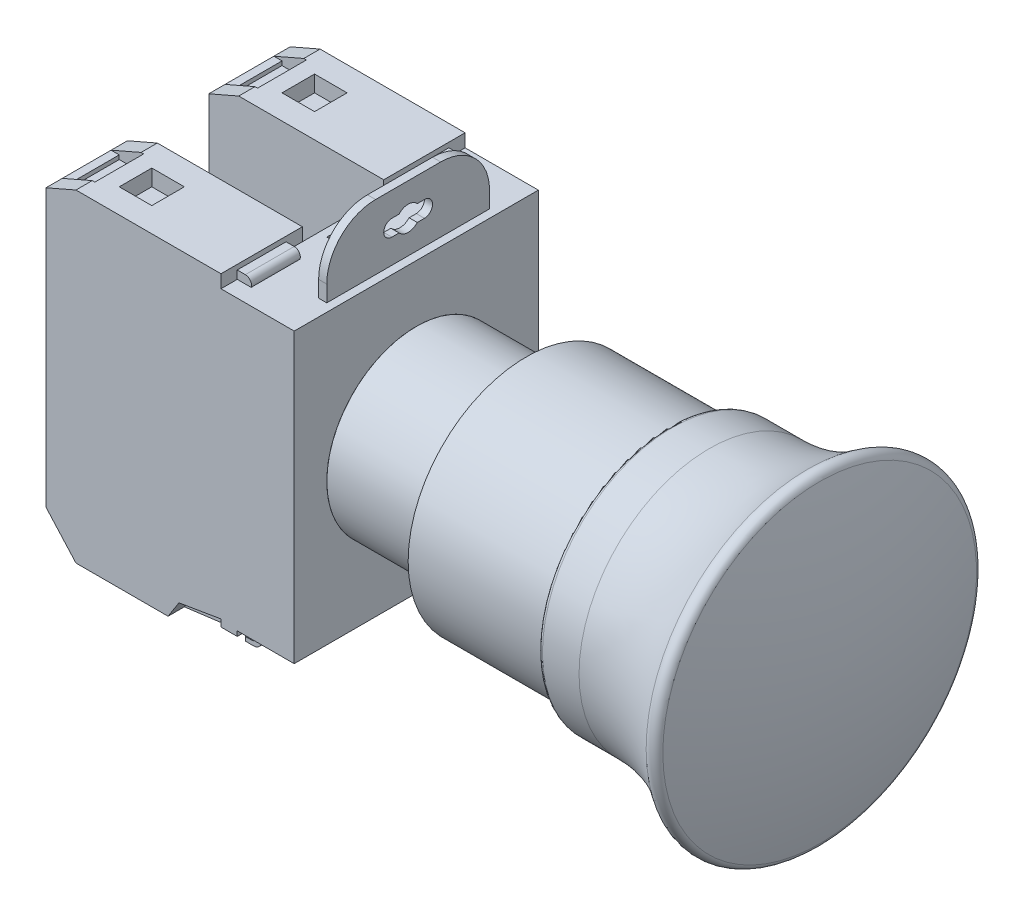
ISO-10303-21;
HEADER;
FILE_DESCRIPTION(('STEP AP214'),'2;1');
FILE_NAME('part.step','',(''),(''),'','','');
FILE_SCHEMA(('AUTOMOTIVE_DESIGN { 1 0 10303 214 1 1 1 1 }'));
ENDSEC;
DATA;
#1=APPLICATION_CONTEXT('core data for automotive mechanical design processes');
#2=APPLICATION_PROTOCOL_DEFINITION('international standard','automotive_design',2000,#1);
#3=PRODUCT_CONTEXT('',#1,'mechanical');
#4=PRODUCT('Part','Part','',(#3));
#5=PRODUCT_RELATED_PRODUCT_CATEGORY('part','',(#4));
#6=PRODUCT_DEFINITION_FORMATION('','',#4);
#7=PRODUCT_DEFINITION_CONTEXT('part definition',#1,'design');
#8=PRODUCT_DEFINITION('design','',#6,#7);
#9=PRODUCT_DEFINITION_SHAPE('','',#8);
#10=(LENGTH_UNIT() NAMED_UNIT(*) SI_UNIT(.MILLI.,.METRE.));
#11=(NAMED_UNIT(*) PLANE_ANGLE_UNIT() SI_UNIT($,.RADIAN.));
#12=(NAMED_UNIT(*) SI_UNIT($,.STERADIAN.) SOLID_ANGLE_UNIT());
#13=UNCERTAINTY_MEASURE_WITH_UNIT(LENGTH_MEASURE(1.E-05),#10,'distance_accuracy_value','');
#14=(GEOMETRIC_REPRESENTATION_CONTEXT(3) GLOBAL_UNCERTAINTY_ASSIGNED_CONTEXT((#13)) GLOBAL_UNIT_ASSIGNED_CONTEXT((#10,
#11,#12)) REPRESENTATION_CONTEXT('',''));
#15=CARTESIAN_POINT('',(0.,0.,0.));
#16=DIRECTION('',(0.,0.,1.));
#17=DIRECTION('',(1.,0.,0.));
#18=AXIS2_PLACEMENT_3D('',#15,#16,#17);
#19=CARTESIAN_POINT('',(-61.2,0.,0.));
#20=DIRECTION('',(-1.,0.,0.));
#21=DIRECTION('',(0.,0.,1.));
#22=AXIS2_PLACEMENT_3D('',#19,#20,#21);
#23=PLANE('',#22);
#24=DIRECTION('',(0.,1.,0.));
#25=VECTOR('',#24,1.);
#26=CARTESIAN_POINT('',(-61.2,0.,-5.));
#27=LINE('',#26,#25);
#28=CARTESIAN_POINT('',(-61.2,-8.07774721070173,-5.));
#29=VERTEX_POINT('',#28);
#30=CARTESIAN_POINT('',(-61.2,8.07774721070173,-5.));
#31=VERTEX_POINT('',#30);
#32=EDGE_CURVE('E11',#29,#31,#27,.T.);
#33=ORIENTED_EDGE('',*,*,#32,.F.);
#34=CARTESIAN_POINT('',(-61.2,0.,0.));
#35=DIRECTION('',(-1.,0.,0.));
#36=DIRECTION('',(0.,0.,1.));
#37=AXIS2_PLACEMENT_3D('',#34,#35,#36);
#38=CIRCLE('',#37,9.5);
#39=CARTESIAN_POINT('',(-61.2,-8.07774721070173,5.));
#40=VERTEX_POINT('',#39);
#41=EDGE_CURVE('E2361',#29,#40,#38,.T.);
#42=ORIENTED_EDGE('',*,*,#41,.T.);
#43=DIRECTION('',(0.,1.,0.));
#44=VECTOR('',#43,1.);
#45=CARTESIAN_POINT('',(-61.2,0.,5.));
#46=LINE('',#45,#44);
#47=CARTESIAN_POINT('',(-61.2,8.07774721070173,5.));
#48=VERTEX_POINT('',#47);
#49=EDGE_CURVE('E25',#40,#48,#46,.T.);
#50=ORIENTED_EDGE('',*,*,#49,.T.);
#51=EDGE_CURVE('E2340',#48,#31,#38,.T.);
#52=ORIENTED_EDGE('',*,*,#51,.T.);
#53=EDGE_LOOP('',(#33,#42,#50,#52));
#54=FACE_BOUND('',#53,.T.);
#55=ADVANCED_FACE('F16',(#54),#23,.T.);
#56=CARTESIAN_POINT('',(-39.7,11.,0.));
#57=DIRECTION('',(-1.,0.,0.));
#58=DIRECTION('',(0.,0.,1.));
#59=AXIS2_PLACEMENT_3D('',#56,#57,#58);
#60=PLANE('',#59);
#61=CARTESIAN_POINT('',(-39.7,0.,0.));
#62=DIRECTION('',(-1.,0.,0.));
#63=DIRECTION('',(0.,0.,1.));
#64=AXIS2_PLACEMENT_3D('',#61,#62,#63);
#65=CIRCLE('',#64,12.5);
#66=CARTESIAN_POINT('',(-39.7,0.,12.5));
#67=VERTEX_POINT('',#66);
#68=EDGE_CURVE('E2303',#67,#67,#65,.T.);
#69=ORIENTED_EDGE('',*,*,#68,.T.);
#70=EDGE_LOOP('',(#69));
#71=FACE_BOUND('',#70,.T.);
#72=CARTESIAN_POINT('',(-39.7,0.,0.));
#73=DIRECTION('',(-1.,0.,0.));
#74=DIRECTION('',(0.,0.,1.));
#75=AXIS2_PLACEMENT_3D('',#72,#73,#74);
#76=CIRCLE('',#75,11.);
#77=CARTESIAN_POINT('',(-39.7,0.,11.));
#78=VERTEX_POINT('',#77);
#79=EDGE_CURVE('E2352',#78,#78,#76,.T.);
#80=ORIENTED_EDGE('',*,*,#79,.F.);
#81=EDGE_LOOP('',(#80));
#82=FACE_BOUND('',#81,.T.);
#83=ADVANCED_FACE('F18',(#71,#82),#60,.T.);
#84=CARTESIAN_POINT('',(0.,0.,0.));
#85=DIRECTION('',(-1.,0.,0.));
#86=DIRECTION('',(0.,0.,1.));
#87=AXIS2_PLACEMENT_3D('',#84,#85,#86);
#88=CYLINDRICAL_SURFACE('',#87,11.);
#89=ORIENTED_EDGE('',*,*,#79,.T.);
#90=EDGE_LOOP('',(#89));
#91=FACE_BOUND('',#90,.T.);
#92=CARTESIAN_POINT('',(-52.19,0.,0.));
#93=DIRECTION('',(-1.,0.,0.));
#94=DIRECTION('',(0.,0.,1.));
#95=AXIS2_PLACEMENT_3D('',#92,#93,#94);
#96=CIRCLE('',#95,11.);
#97=CARTESIAN_POINT('',(-52.19,0.,11.));
#98=VERTEX_POINT('',#97);
#99=EDGE_CURVE('E2348',#98,#98,#96,.T.);
#100=ORIENTED_EDGE('',*,*,#99,.F.);
#101=EDGE_LOOP('',(#100));
#102=FACE_BOUND('',#101,.T.);
#103=ADVANCED_FACE('F4541',(#91,#102),#88,.T.);
#104=CARTESIAN_POINT('',(-52.19,9.50000000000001,0.));
#105=DIRECTION('',(-1.,0.,0.));
#106=DIRECTION('',(0.,0.,1.));
#107=AXIS2_PLACEMENT_3D('',#104,#105,#106);
#108=PLANE('',#107);
#109=ORIENTED_EDGE('',*,*,#99,.T.);
#110=EDGE_LOOP('',(#109));
#111=FACE_BOUND('',#110,.T.);
#112=CARTESIAN_POINT('',(-52.19,0.,0.));
#113=DIRECTION('',(-1.,0.,0.));
#114=DIRECTION('',(0.,0.,1.));
#115=AXIS2_PLACEMENT_3D('',#112,#113,#114);
#116=CIRCLE('',#115,9.5);
#117=CARTESIAN_POINT('',(-52.19,0.,9.5));
#118=VERTEX_POINT('',#117);
#119=EDGE_CURVE('E2343',#118,#118,#116,.T.);
#120=ORIENTED_EDGE('',*,*,#119,.F.);
#121=EDGE_LOOP('',(#120));
#122=FACE_BOUND('',#121,.T.);
#123=ADVANCED_FACE('F4533',(#111,#122),#108,.T.);
#124=CARTESIAN_POINT('',(0.,0.,0.));
#125=DIRECTION('',(-1.,0.,0.));
#126=DIRECTION('',(0.,0.,1.));
#127=AXIS2_PLACEMENT_3D('',#124,#125,#126);
#128=CYLINDRICAL_SURFACE('',#127,9.5);
#129=ORIENTED_EDGE('',*,*,#119,.T.);
#130=EDGE_LOOP('',(#129));
#131=FACE_BOUND('',#130,.T.);
#132=ORIENTED_EDGE('',*,*,#51,.F.);
#133=EDGE_CURVE('E2339',#40,#48,#38,.T.);
#134=ORIENTED_EDGE('',*,*,#133,.F.);
#135=ORIENTED_EDGE('',*,*,#41,.F.);
#136=EDGE_CURVE('E2344',#31,#29,#38,.T.);
#137=ORIENTED_EDGE('',*,*,#136,.F.);
#138=EDGE_LOOP('',(#132,#134,#135,#137));
#139=FACE_BOUND('',#138,.T.);
#140=ADVANCED_FACE('F2366',(#131,#139),#128,.T.);
#141=CARTESIAN_POINT('',(-75.9750398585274,0.,-0.544769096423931));
#142=DIRECTION('',(0.,-1.,0.));
#143=DIRECTION('',(0.,0.,1.));
#144=AXIS2_PLACEMENT_3D('',#141,#142,#143);
#145=CIRCLE('',#144,75.9769929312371);
#146=TRIMMED_CURVE('',#145,(PARAMETER_VALUE(-1.56362608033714)),
(PARAMETER_VALUE(1.56362608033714)),.T.,.PARAMETER.);
#147=CARTESIAN_POINT('',(-75.9750398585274,0.,0.));
#148=DIRECTION('',(-1.,0.,0.));
#149=AXIS1_PLACEMENT('',#147,#148);
#150=SURFACE_OF_REVOLUTION('',#146,#149);
#151=CARTESIAN_POINT('',(-2.62874383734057,0.,0.));
#152=DIRECTION('',(-1.,0.,0.));
#153=DIRECTION('',(0.,0.,1.));
#154=AXIS2_PLACEMENT_3D('',#151,#152,#153);
#155=CIRCLE('',#154,19.2750269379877);
#156=CARTESIAN_POINT('',(-2.62874383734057,0.,19.2750269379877));
#157=VERTEX_POINT('',#156);
#158=EDGE_CURVE('E2335',#157,#157,#155,.T.);
#159=ORIENTED_EDGE('',*,*,#158,.F.);
#160=EDGE_LOOP('',(#159));
#161=FACE_BOUND('',#160,.T.);
#162=CARTESIAN_POINT('',(0.,0.,0.));
#163=VERTEX_POINT('',#162);
#164=VERTEX_LOOP('',#163);
#165=FACE_BOUND('',#164,.T.);
#166=ADVANCED_FACE('F4518',(#161,#165),#150,.T.);
#167=CARTESIAN_POINT('',(-3.59018035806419,0.,0.));
#168=DIRECTION('',(-1.,0.,0.));
#169=DIRECTION('',(0.,0.,1.));
#170=AXIS2_PLACEMENT_3D('',#167,#168,#169);
#171=TOROIDAL_SURFACE('',#170,19.,1.);
#172=CARTESIAN_POINT('',(-4.08722503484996,0.,0.));
#173=DIRECTION('',(-1.,0.,0.));
#174=DIRECTION('',(0.,0.,1.));
#175=AXIS2_PLACEMENT_3D('',#172,#173,#174);
#176=CIRCLE('',#175,19.8677249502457);
#177=CARTESIAN_POINT('',(-4.08722503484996,0.,19.8677249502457));
#178=VERTEX_POINT('',#177);
#179=EDGE_CURVE('E2331',#178,#178,#176,.T.);
#180=ORIENTED_EDGE('',*,*,#179,.F.);
#181=EDGE_LOOP('',(#180));
#182=FACE_BOUND('',#181,.T.);
#183=ORIENTED_EDGE('',*,*,#158,.T.);
#184=EDGE_LOOP('',(#183));
#185=FACE_BOUND('',#184,.T.);
#186=ADVANCED_FACE('F4510',(#182,#185),#171,.T.);
#187=CARTESIAN_POINT('',(-15.874212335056,0.,0.));
#188=DIRECTION('',(-1.,0.,0.));
#189=DIRECTION('',(0.,0.,1.));
#190=AXIS2_PLACEMENT_3D('',#187,#188,#189);
#191=TOROIDAL_SURFACE('',#190,35.8807089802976,19.8833781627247);
#192=ORIENTED_EDGE('',*,*,#179,.T.);
#193=EDGE_LOOP('',(#192));
#194=FACE_BOUND('',#193,.T.);
#195=CARTESIAN_POINT('',(-16.2,0.,0.));
#196=DIRECTION('',(-1.,0.,0.));
#197=DIRECTION('',(0.,0.,1.));
#198=AXIS2_PLACEMENT_3D('',#195,#196,#197);
#199=CIRCLE('',#198,16.);
#200=CARTESIAN_POINT('',(-16.2,0.,16.));
#201=VERTEX_POINT('',#200);
#202=EDGE_CURVE('E2327',#201,#201,#199,.T.);
#203=ORIENTED_EDGE('',*,*,#202,.F.);
#204=EDGE_LOOP('',(#203));
#205=FACE_BOUND('',#204,.T.);
#206=ADVANCED_FACE('F4502',(#194,#205),#191,.F.);
#207=CARTESIAN_POINT('',(0.,0.,0.));
#208=DIRECTION('',(-1.,0.,0.));
#209=DIRECTION('',(0.,0.,1.));
#210=AXIS2_PLACEMENT_3D('',#207,#208,#209);
#211=CYLINDRICAL_SURFACE('',#210,16.);
#212=ORIENTED_EDGE('',*,*,#202,.T.);
#213=EDGE_LOOP('',(#212));
#214=FACE_BOUND('',#213,.T.);
#215=CARTESIAN_POINT('',(-20.7,0.,0.));
#216=DIRECTION('',(-1.,0.,0.));
#217=DIRECTION('',(0.,0.,1.));
#218=AXIS2_PLACEMENT_3D('',#215,#216,#217);
#219=CIRCLE('',#218,16.);
#220=CARTESIAN_POINT('',(-20.7,0.,16.));
#221=VERTEX_POINT('',#220);
#222=EDGE_CURVE('E2323',#221,#221,#219,.T.);
#223=ORIENTED_EDGE('',*,*,#222,.F.);
#224=EDGE_LOOP('',(#223));
#225=FACE_BOUND('',#224,.T.);
#226=ADVANCED_FACE('F4494',(#214,#225),#211,.T.);
#227=CARTESIAN_POINT('',(-20.7,0.,0.));
#228=DIRECTION('',(-1.,0.,0.));
#229=DIRECTION('',(0.,0.,1.));
#230=AXIS2_PLACEMENT_3D('',#227,#228,#229);
#231=TOROIDAL_SURFACE('',#230,15.5,0.5);
#232=CARTESIAN_POINT('',(-21.2,0.,0.));
#233=DIRECTION('',(-1.,0.,0.));
#234=DIRECTION('',(0.,0.,1.));
#235=AXIS2_PLACEMENT_3D('',#232,#233,#234);
#236=CIRCLE('',#235,15.5);
#237=CARTESIAN_POINT('',(-21.2,0.,15.5));
#238=VERTEX_POINT('',#237);
#239=EDGE_CURVE('E2319',#238,#238,#236,.T.);
#240=ORIENTED_EDGE('',*,*,#239,.F.);
#241=EDGE_LOOP('',(#240));
#242=FACE_BOUND('',#241,.T.);
#243=ORIENTED_EDGE('',*,*,#222,.T.);
#244=EDGE_LOOP('',(#243));
#245=FACE_BOUND('',#244,.T.);
#246=ADVANCED_FACE('F4486',(#242,#245),#231,.T.);
#247=CARTESIAN_POINT('',(-21.2,15.5,0.));
#248=DIRECTION('',(1.,0.,0.));
#249=DIRECTION('',(0.,0.,-1.));
#250=AXIS2_PLACEMENT_3D('',#247,#248,#249);
#251=PLANE('',#250);
#252=CARTESIAN_POINT('',(-21.2,0.,0.));
#253=DIRECTION('',(-1.,0.,0.));
#254=DIRECTION('',(0.,0.,1.));
#255=AXIS2_PLACEMENT_3D('',#252,#253,#254);
#256=CIRCLE('',#255,14.5);
#257=CARTESIAN_POINT('',(-21.2,0.,14.5));
#258=VERTEX_POINT('',#257);
#259=EDGE_CURVE('E2315',#258,#258,#256,.T.);
#260=ORIENTED_EDGE('',*,*,#259,.F.);
#261=EDGE_LOOP('',(#260));
#262=FACE_BOUND('',#261,.T.);
#263=ORIENTED_EDGE('',*,*,#239,.T.);
#264=EDGE_LOOP('',(#263));
#265=FACE_BOUND('',#264,.T.);
#266=ADVANCED_FACE('F4478',(#262,#265),#251,.F.);
#267=CARTESIAN_POINT('',(0.,0.,0.));
#268=DIRECTION('',(-1.,0.,0.));
#269=DIRECTION('',(0.,0.,1.));
#270=AXIS2_PLACEMENT_3D('',#267,#268,#269);
#271=CYLINDRICAL_SURFACE('',#270,14.5);
#272=ORIENTED_EDGE('',*,*,#259,.T.);
#273=EDGE_LOOP('',(#272));
#274=FACE_BOUND('',#273,.T.);
#275=CARTESIAN_POINT('',(-38.7,0.,0.));
#276=DIRECTION('',(-1.,0.,0.));
#277=DIRECTION('',(0.,0.,1.));
#278=AXIS2_PLACEMENT_3D('',#275,#276,#277);
#279=CIRCLE('',#278,14.5);
#280=CARTESIAN_POINT('',(-38.7,0.,14.5));
#281=VERTEX_POINT('',#280);
#282=EDGE_CURVE('E2311',#281,#281,#279,.T.);
#283=ORIENTED_EDGE('',*,*,#282,.F.);
#284=EDGE_LOOP('',(#283));
#285=FACE_BOUND('',#284,.T.);
#286=ADVANCED_FACE('F4470',(#274,#285),#271,.T.);
#287=CARTESIAN_POINT('',(-38.7,14.5,0.));
#288=DIRECTION('',(1.,0.,0.));
#289=DIRECTION('',(0.,0.,-1.));
#290=AXIS2_PLACEMENT_3D('',#287,#288,#289);
#291=PLANE('',#290);
#292=CARTESIAN_POINT('',(-38.7,0.,0.));
#293=DIRECTION('',(-1.,0.,0.));
#294=DIRECTION('',(0.,0.,1.));
#295=AXIS2_PLACEMENT_3D('',#292,#293,#294);
#296=CIRCLE('',#295,12.5);
#297=CARTESIAN_POINT('',(-38.7,0.,12.5));
#298=VERTEX_POINT('',#297);
#299=EDGE_CURVE('E2307',#298,#298,#296,.T.);
#300=ORIENTED_EDGE('',*,*,#299,.F.);
#301=EDGE_LOOP('',(#300));
#302=FACE_BOUND('',#301,.T.);
#303=ORIENTED_EDGE('',*,*,#282,.T.);
#304=EDGE_LOOP('',(#303));
#305=FACE_BOUND('',#304,.T.);
#306=ADVANCED_FACE('F4462',(#302,#305),#291,.F.);
#307=CARTESIAN_POINT('',(0.,0.,0.));
#308=DIRECTION('',(-1.,0.,0.));
#309=DIRECTION('',(0.,0.,1.));
#310=AXIS2_PLACEMENT_3D('',#307,#308,#309);
#311=CYLINDRICAL_SURFACE('',#310,12.5);
#312=ORIENTED_EDGE('',*,*,#299,.T.);
#313=EDGE_LOOP('',(#312));
#314=FACE_BOUND('',#313,.T.);
#315=ORIENTED_EDGE('',*,*,#68,.F.);
#316=EDGE_LOOP('',(#315));
#317=FACE_BOUND('',#316,.T.);
#318=ADVANCED_FACE('F4455',(#314,#317),#311,.T.);
#319=CARTESIAN_POINT('',(-61.2,0.,-15.));
#320=DIRECTION('',(-1.,0.,0.));
#321=DIRECTION('',(0.,0.,1.));
#322=AXIS2_PLACEMENT_3D('',#319,#320,#321);
#323=PLANE('',#322);
#324=DIRECTION('',(0.,1.,0.));
#325=VECTOR('',#324,1.);
#326=CARTESIAN_POINT('',(-61.2,0.,3.));
#327=LINE('',#326,#325);
#328=CARTESIAN_POINT('',(-61.2,-17.,3.));
#329=VERTEX_POINT('',#328);
#330=CARTESIAN_POINT('',(-61.2,-14.,3.));
#331=VERTEX_POINT('',#330);
#332=EDGE_CURVE('E2285',#329,#331,#327,.T.);
#333=ORIENTED_EDGE('',*,*,#332,.F.);
#334=DIRECTION('',(0.,0.,1.));
#335=VECTOR('',#334,1.);
#336=CARTESIAN_POINT('',(-61.2,-17.,-15.));
#337=LINE('',#336,#335);
#338=CARTESIAN_POINT('',(-61.2,-17.,-3.));
#339=VERTEX_POINT('',#338);
#340=EDGE_CURVE('E2282',#339,#329,#337,.T.);
#341=ORIENTED_EDGE('',*,*,#340,.F.);
#342=DIRECTION('',(0.,-1.,0.));
#343=VECTOR('',#342,1.);
#344=CARTESIAN_POINT('',(-61.2,0.,-3.));
#345=LINE('',#344,#343);
#346=CARTESIAN_POINT('',(-61.2,-14.,-3.));
#347=VERTEX_POINT('',#346);
#348=EDGE_CURVE('E2275',#347,#339,#345,.T.);
#349=ORIENTED_EDGE('',*,*,#348,.F.);
#350=DIRECTION('',(0.,0.,-1.));
#351=VECTOR('',#350,1.);
#352=CARTESIAN_POINT('',(-61.2,-14.,-15.));
#353=LINE('',#352,#351);
#354=EDGE_CURVE('E2278',#331,#347,#353,.T.);
#355=ORIENTED_EDGE('',*,*,#354,.F.);
#356=EDGE_LOOP('',(#333,#341,#349,#355));
#357=FACE_BOUND('',#356,.T.);
#358=DIRECTION('',(0.,1.,0.));
#359=VECTOR('',#358,1.);
#360=CARTESIAN_POINT('',(-61.2,0.,15.));
#361=LINE('',#360,#359);
#362=CARTESIAN_POINT('',(-61.2,-18.,15.));
#363=VERTEX_POINT('',#362);
#364=CARTESIAN_POINT('',(-61.2,-17.1361519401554,15.));
#365=VERTEX_POINT('',#364);
#366=EDGE_CURVE('E2245',#363,#365,#361,.T.);
#367=ORIENTED_EDGE('',*,*,#366,.T.);
#368=DIRECTION('',(0.,0.,-1.));
#369=VECTOR('',#368,1.);
#370=CARTESIAN_POINT('',(-61.2,-17.1361519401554,15.));
#371=LINE('',#370,#369);
#372=CARTESIAN_POINT('',(-61.2,-17.1361519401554,5.));
#373=VERTEX_POINT('',#372);
#374=EDGE_CURVE('E1324',#365,#373,#371,.T.);
#375=ORIENTED_EDGE('',*,*,#374,.T.);
#376=DIRECTION('',(0.,1.,0.));
#377=VECTOR('',#376,1.);
#378=CARTESIAN_POINT('',(-61.2,-17.1361519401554,5.));
#379=LINE('',#378,#377);
#380=CARTESIAN_POINT('',(-61.2,-9.7979589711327,5.));
#381=VERTEX_POINT('',#380);
#382=EDGE_CURVE('E1243',#373,#381,#379,.T.);
#383=ORIENTED_EDGE('',*,*,#382,.T.);
#384=CARTESIAN_POINT('',(-61.2,0.,0.));
#385=DIRECTION('',(-1.,0.,0.));
#386=DIRECTION('',(0.,0.,1.));
#387=AXIS2_PLACEMENT_3D('',#384,#385,#386);
#388=CIRCLE('',#387,11.);
#389=CARTESIAN_POINT('',(-61.2,-9.7979589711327,-5.));
#390=VERTEX_POINT('',#389);
#391=EDGE_CURVE('E2208',#390,#381,#388,.T.);
#392=ORIENTED_EDGE('',*,*,#391,.F.);
#393=DIRECTION('',(0.,1.,0.));
#394=VECTOR('',#393,1.);
#395=CARTESIAN_POINT('',(-61.2,-17.1361519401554,-5.));
#396=LINE('',#395,#394);
#397=CARTESIAN_POINT('',(-61.2,-17.1361519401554,-5.));
#398=VERTEX_POINT('',#397);
#399=EDGE_CURVE('E1822',#398,#390,#396,.T.);
#400=ORIENTED_EDGE('',*,*,#399,.F.);
#401=DIRECTION('',(0.,0.,-1.));
#402=VECTOR('',#401,1.);
#403=CARTESIAN_POINT('',(-61.2,-17.1361519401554,-5.));
#404=LINE('',#403,#402);
#405=CARTESIAN_POINT('',(-61.2,-17.1361519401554,-15.));
#406=VERTEX_POINT('',#405);
#407=EDGE_CURVE('E1874',#398,#406,#404,.T.);
#408=ORIENTED_EDGE('',*,*,#407,.T.);
#409=DIRECTION('',(0.,-1.,0.));
#410=VECTOR('',#409,1.);
#411=CARTESIAN_POINT('',(-61.2,0.,-15.));
#412=LINE('',#411,#410);
#413=CARTESIAN_POINT('',(-61.2,-18.,-15.));
#414=VERTEX_POINT('',#413);
#415=EDGE_CURVE('E2213',#406,#414,#412,.T.);
#416=ORIENTED_EDGE('',*,*,#415,.T.);
#417=DIRECTION('',(0.,0.,1.));
#418=VECTOR('',#417,1.);
#419=CARTESIAN_POINT('',(-61.2,-18.,-15.));
#420=LINE('',#419,#418);
#421=CARTESIAN_POINT('',(-61.2,-18.,-13.));
#422=VERTEX_POINT('',#421);
#423=EDGE_CURVE('E2233',#414,#422,#420,.T.);
#424=ORIENTED_EDGE('',*,*,#423,.T.);
#425=DIRECTION('',(0.,0.,1.));
#426=VECTOR('',#425,1.);
#427=CARTESIAN_POINT('',(-61.2,-18.,-15.));
#428=LINE('',#427,#426);
#429=CARTESIAN_POINT('',(-61.2,-18.,-7.00000000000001));
#430=VERTEX_POINT('',#429);
#431=EDGE_CURVE('E1964',#422,#430,#428,.T.);
#432=ORIENTED_EDGE('',*,*,#431,.T.);
#433=CARTESIAN_POINT('',(-61.2,-18.,7.00000000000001));
#434=VERTEX_POINT('',#433);
#435=EDGE_CURVE('E2238',#430,#434,#420,.T.);
#436=ORIENTED_EDGE('',*,*,#435,.T.);
#437=DIRECTION('',(0.,0.,1.));
#438=VECTOR('',#437,1.);
#439=CARTESIAN_POINT('',(-61.2,-18.,-15.));
#440=LINE('',#439,#438);
#441=CARTESIAN_POINT('',(-61.2,-18.,13.));
#442=VERTEX_POINT('',#441);
#443=EDGE_CURVE('E1411',#434,#442,#440,.T.);
#444=ORIENTED_EDGE('',*,*,#443,.T.);
#445=EDGE_CURVE('E2232',#442,#363,#420,.T.);
#446=ORIENTED_EDGE('',*,*,#445,.T.);
#447=EDGE_LOOP('',(#367,#375,#383,#392,#400,#408,#416,#424,#432,#436,#444,#446));
#448=FACE_BOUND('',#447,.T.);
#449=ADVANCED_FACE('F2433',(#357,#448),#323,.T.);
#450=CARTESIAN_POINT('',(-61.2,9.7979589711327,5.));
#451=VERTEX_POINT('',#450);
#452=CARTESIAN_POINT('',(-61.2,9.7979589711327,-5.));
#453=VERTEX_POINT('',#452);
#454=EDGE_CURVE('E2209',#451,#453,#388,.T.);
#455=ORIENTED_EDGE('',*,*,#454,.F.);
#456=CARTESIAN_POINT('',(-61.2,18.,5.));
#457=VERTEX_POINT('',#456);
#458=EDGE_CURVE('E4744',#451,#457,#379,.T.);
#459=ORIENTED_EDGE('',*,*,#458,.T.);
#460=DIRECTION('',(0.,0.,1.));
#461=VECTOR('',#460,1.);
#462=CARTESIAN_POINT('',(-61.2,18.,-15.));
#463=LINE('',#462,#461);
#464=CARTESIAN_POINT('',(-61.2,18.,-5.));
#465=VERTEX_POINT('',#464);
#466=EDGE_CURVE('E2227',#465,#457,#463,.T.);
#467=ORIENTED_EDGE('',*,*,#466,.F.);
#468=EDGE_CURVE('E2380',#453,#465,#396,.T.);
#469=ORIENTED_EDGE('',*,*,#468,.F.);
#470=EDGE_LOOP('',(#455,#459,#467,#469));
#471=FACE_BOUND('',#470,.T.);
#472=ADVANCED_FACE('F4442',(#471),#323,.T.);
#473=CARTESIAN_POINT('',(-56.7,-18.,-15.));
#474=DIRECTION('',(0.,-1.,0.));
#475=DIRECTION('',(0.,0.,-1.));
#476=AXIS2_PLACEMENT_3D('',#473,#474,#475);
#477=PLANE('',#476);
#478=DIRECTION('',(0.,0.,-1.));
#479=VECTOR('',#478,1.);
#480=CARTESIAN_POINT('',(-59.2,-18.,-15.));
#481=LINE('',#480,#479);
#482=CARTESIAN_POINT('',(-59.2,-18.,7.00000000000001));
#483=VERTEX_POINT('',#482);
#484=CARTESIAN_POINT('',(-59.2,-18.,-7.00000000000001));
#485=VERTEX_POINT('',#484);
#486=EDGE_CURVE('E2199',#483,#485,#481,.T.);
#487=ORIENTED_EDGE('',*,*,#486,.F.);
#488=DIRECTION('',(-1.,0.,0.));
#489=VECTOR('',#488,1.);
#490=CARTESIAN_POINT('',(-59.2,-18.,7.00000000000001));
#491=LINE('',#490,#489);
#492=EDGE_CURVE('E1094',#483,#434,#491,.T.);
#493=ORIENTED_EDGE('',*,*,#492,.T.);
#494=ORIENTED_EDGE('',*,*,#435,.F.);
#495=DIRECTION('',(-1.,0.,0.));
#496=VECTOR('',#495,1.);
#497=CARTESIAN_POINT('',(-59.2,-18.,-7.00000000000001));
#498=LINE('',#497,#496);
#499=EDGE_CURVE('E1684',#485,#430,#498,.T.);
#500=ORIENTED_EDGE('',*,*,#499,.F.);
#501=EDGE_LOOP('',(#487,#493,#494,#500));
#502=FACE_BOUND('',#501,.T.);
#503=ADVANCED_FACE('F4415',(#502),#477,.T.);
#504=CARTESIAN_POINT('',(-59.2,-18.,-13.));
#505=VERTEX_POINT('',#504);
#506=CARTESIAN_POINT('',(-59.2,-18.,-15.));
#507=VERTEX_POINT('',#506);
#508=EDGE_CURVE('E2193',#505,#507,#481,.T.);
#509=ORIENTED_EDGE('',*,*,#508,.F.);
#510=DIRECTION('',(-1.,0.,0.));
#511=VECTOR('',#510,1.);
#512=CARTESIAN_POINT('',(-59.2,-18.,-13.));
#513=LINE('',#512,#511);
#514=EDGE_CURVE('E1640',#505,#422,#513,.T.);
#515=ORIENTED_EDGE('',*,*,#514,.T.);
#516=ORIENTED_EDGE('',*,*,#423,.F.);
#517=DIRECTION('',(1.,0.,0.));
#518=VECTOR('',#517,1.);
#519=CARTESIAN_POINT('',(-56.7,-18.,-15.));
#520=LINE('',#519,#518);
#521=EDGE_CURVE('E2207',#414,#507,#520,.T.);
#522=ORIENTED_EDGE('',*,*,#521,.T.);
#523=EDGE_LOOP('',(#509,#515,#516,#522));
#524=FACE_BOUND('',#523,.T.);
#525=ADVANCED_FACE('F4416',(#524),#477,.T.);
#526=CARTESIAN_POINT('',(-56.7,18.,-15.));
#527=DIRECTION('',(0.,1.,0.));
#528=DIRECTION('',(0.,0.,1.));
#529=AXIS2_PLACEMENT_3D('',#526,#527,#528);
#530=PLANE('',#529);
#531=DIRECTION('',(1.,0.,0.));
#532=VECTOR('',#531,1.);
#533=CARTESIAN_POINT('',(-56.7,18.,13.));
#534=LINE('',#533,#532);
#535=CARTESIAN_POINT('',(-61.2,18.,13.));
#536=VERTEX_POINT('',#535);
#537=CARTESIAN_POINT('',(-59.4928932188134,18.,13.));
#538=VERTEX_POINT('',#537);
#539=EDGE_CURVE('E2300',#536,#538,#534,.T.);
#540=ORIENTED_EDGE('',*,*,#539,.F.);
#541=DIRECTION('',(0.,0.,1.));
#542=VECTOR('',#541,1.);
#543=CARTESIAN_POINT('',(-61.2,18.,-15.));
#544=LINE('',#543,#542);
#545=CARTESIAN_POINT('',(-61.2,18.,15.));
#546=VERTEX_POINT('',#545);
#547=EDGE_CURVE('E1415',#536,#546,#544,.T.);
#548=ORIENTED_EDGE('',*,*,#547,.T.);
#549=DIRECTION('',(1.,0.,0.));
#550=VECTOR('',#549,1.);
#551=CARTESIAN_POINT('',(-56.7,18.,15.));
#552=LINE('',#551,#550);
#553=CARTESIAN_POINT('',(-52.2,18.,15.));
#554=VERTEX_POINT('',#553);
#555=EDGE_CURVE('E2242',#546,#554,#552,.T.);
#556=ORIENTED_EDGE('',*,*,#555,.T.);
#557=DIRECTION('',(0.,0.,1.));
#558=VECTOR('',#557,1.);
#559=CARTESIAN_POINT('',(-52.2,18.,-15.));
#560=LINE('',#559,#558);
#561=CARTESIAN_POINT('',(-52.2,18.,-15.));
#562=VERTEX_POINT('',#561);
#563=EDGE_CURVE('E2217',#562,#554,#560,.T.);
#564=ORIENTED_EDGE('',*,*,#563,.F.);
#565=DIRECTION('',(-1.,0.,0.));
#566=VECTOR('',#565,1.);
#567=CARTESIAN_POINT('',(-56.7,18.,-15.));
#568=LINE('',#567,#566);
#569=CARTESIAN_POINT('',(-61.2,18.,-15.));
#570=VERTEX_POINT('',#569);
#571=EDGE_CURVE('E2218',#562,#570,#568,.T.);
#572=ORIENTED_EDGE('',*,*,#571,.T.);
#573=CARTESIAN_POINT('',(-61.2,18.,-13.));
#574=VERTEX_POINT('',#573);
#575=EDGE_CURVE('E2228',#570,#574,#463,.T.);
#576=ORIENTED_EDGE('',*,*,#575,.T.);
#577=DIRECTION('',(1.,0.,0.));
#578=VECTOR('',#577,1.);
#579=CARTESIAN_POINT('',(-56.7,18.,-13.));
#580=LINE('',#579,#578);
#581=CARTESIAN_POINT('',(-59.4928932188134,18.,-13.));
#582=VERTEX_POINT('',#581);
#583=EDGE_CURVE('E1972',#574,#582,#580,.T.);
#584=ORIENTED_EDGE('',*,*,#583,.T.);
#585=DIRECTION('',(0.,0.,-1.));
#586=VECTOR('',#585,1.);
#587=CARTESIAN_POINT('',(-59.4928932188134,18.,-7.00000000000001));
#588=LINE('',#587,#586);
#589=CARTESIAN_POINT('',(-59.4928932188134,18.,-7.00000000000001));
#590=VERTEX_POINT('',#589);
#591=EDGE_CURVE('E2288',#582,#590,#588,.F.);
#592=ORIENTED_EDGE('',*,*,#591,.T.);
#593=DIRECTION('',(1.,0.,0.));
#594=VECTOR('',#593,1.);
#595=CARTESIAN_POINT('',(-61.2,18.,-7.00000000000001));
#596=LINE('',#595,#594);
#597=CARTESIAN_POINT('',(-61.2,18.,-7.00000000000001));
#598=VERTEX_POINT('',#597);
#599=EDGE_CURVE('E1680',#598,#590,#596,.T.);
#600=ORIENTED_EDGE('',*,*,#599,.F.);
#601=DIRECTION('',(0.,0.,1.));
#602=VECTOR('',#601,1.);
#603=CARTESIAN_POINT('',(-61.2,18.,-15.));
#604=LINE('',#603,#602);
#605=EDGE_CURVE('E1968',#598,#465,#604,.T.);
#606=ORIENTED_EDGE('',*,*,#605,.T.);
#607=ORIENTED_EDGE('',*,*,#466,.T.);
#608=CARTESIAN_POINT('',(-61.2,18.,7.00000000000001));
#609=VERTEX_POINT('',#608);
#610=EDGE_CURVE('E1419',#457,#609,#544,.T.);
#611=ORIENTED_EDGE('',*,*,#610,.T.);
#612=DIRECTION('',(1.,0.,0.));
#613=VECTOR('',#612,1.);
#614=CARTESIAN_POINT('',(-56.7,18.,7.00000000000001));
#615=LINE('',#614,#613);
#616=CARTESIAN_POINT('',(-59.4928932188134,18.,7.00000000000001));
#617=VERTEX_POINT('',#616);
#618=EDGE_CURVE('E2292',#609,#617,#615,.T.);
#619=ORIENTED_EDGE('',*,*,#618,.T.);
#620=DIRECTION('',(0.,0.,-1.));
#621=VECTOR('',#620,1.);
#622=CARTESIAN_POINT('',(-59.4928932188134,18.,13.));
#623=LINE('',#622,#621);
#624=EDGE_CURVE('E2296',#617,#538,#623,.F.);
#625=ORIENTED_EDGE('',*,*,#624,.T.);
#626=EDGE_LOOP('',(#540,#548,#556,#564,#572,#576,#584,#592,#600,#606,#607,#611,#619,#625));
#627=FACE_BOUND('',#626,.T.);
#628=DIRECTION('',(1.,0.,0.));
#629=VECTOR('',#628,1.);
#630=CARTESIAN_POINT('',(-56.7,18.,3.));
#631=LINE('',#630,#629);
#632=CARTESIAN_POINT('',(-60.2,18.,3.));
#633=VERTEX_POINT('',#632);
#634=CARTESIAN_POINT('',(-59.45,18.,3.));
#635=VERTEX_POINT('',#634);
#636=EDGE_CURVE('E2271',#633,#635,#631,.T.);
#637=ORIENTED_EDGE('',*,*,#636,.F.);
#638=DIRECTION('',(0.,0.,1.));
#639=VECTOR('',#638,1.);
#640=CARTESIAN_POINT('',(-60.2,18.,-15.));
#641=LINE('',#640,#639);
#642=CARTESIAN_POINT('',(-60.2,18.,-3.));
#643=VERTEX_POINT('',#642);
#644=EDGE_CURVE('E2268',#643,#633,#641,.T.);
#645=ORIENTED_EDGE('',*,*,#644,.F.);
#646=DIRECTION('',(-1.,0.,0.));
#647=VECTOR('',#646,1.);
#648=CARTESIAN_POINT('',(-56.7,18.,-3.));
#649=LINE('',#648,#647);
#650=CARTESIAN_POINT('',(-59.45,18.,-3.));
#651=VERTEX_POINT('',#650);
#652=EDGE_CURVE('E2265',#651,#643,#649,.T.);
#653=ORIENTED_EDGE('',*,*,#652,.F.);
#654=DIRECTION('',(0.,0.,-1.));
#655=VECTOR('',#654,1.);
#656=CARTESIAN_POINT('',(-59.45,18.,-15.));
#657=LINE('',#656,#655);
#658=EDGE_CURVE('E2262',#635,#651,#657,.T.);
#659=ORIENTED_EDGE('',*,*,#658,.F.);
#660=EDGE_LOOP('',(#637,#645,#653,#659));
#661=FACE_BOUND('',#660,.T.);
#662=DIRECTION('',(0.,0.,1.));
#663=VECTOR('',#662,1.);
#664=CARTESIAN_POINT('',(-53.2,18.,-10.));
#665=LINE('',#664,#663);
#666=CARTESIAN_POINT('',(-53.2,18.,-10.));
#667=VERTEX_POINT('',#666);
#668=CARTESIAN_POINT('',(-53.2,18.,10.));
#669=VERTEX_POINT('',#668);
#670=EDGE_CURVE('E2036',#667,#669,#665,.T.);
#671=ORIENTED_EDGE('',*,*,#670,.T.);
#672=DIRECTION('',(1.,0.,0.));
#673=VECTOR('',#672,1.);
#674=CARTESIAN_POINT('',(-54.2,18.,10.));
#675=LINE('',#674,#673);
#676=CARTESIAN_POINT('',(-54.2,18.,10.));
#677=VERTEX_POINT('',#676);
#678=EDGE_CURVE('E2095',#677,#669,#675,.T.);
#679=ORIENTED_EDGE('',*,*,#678,.F.);
#680=DIRECTION('',(0.,0.,1.));
#681=VECTOR('',#680,1.);
#682=CARTESIAN_POINT('',(-54.2,18.,-10.));
#683=LINE('',#682,#681);
#684=CARTESIAN_POINT('',(-54.2,18.,-10.));
#685=VERTEX_POINT('',#684);
#686=EDGE_CURVE('E2053',#685,#677,#683,.T.);
#687=ORIENTED_EDGE('',*,*,#686,.F.);
#688=DIRECTION('',(1.,0.,0.));
#689=VECTOR('',#688,1.);
#690=CARTESIAN_POINT('',(-54.2,18.,-10.));
#691=LINE('',#690,#689);
#692=EDGE_CURVE('E2072',#685,#667,#691,.T.);
#693=ORIENTED_EDGE('',*,*,#692,.T.);
#694=EDGE_LOOP('',(#671,#679,#687,#693));
#695=FACE_BOUND('',#694,.T.);
#696=ADVANCED_FACE('F4422',(#627,#661,#695),#530,.T.);
#697=CARTESIAN_POINT('',(-56.7,0.,15.));
#698=DIRECTION('',(0.,0.,1.));
#699=DIRECTION('',(1.,0.,0.));
#700=AXIS2_PLACEMENT_3D('',#697,#698,#699);
#701=PLANE('',#700);
#702=DIRECTION('',(0.,-1.,0.));
#703=VECTOR('',#702,1.);
#704=CARTESIAN_POINT('',(-59.2,0.,15.));
#705=LINE('',#704,#703);
#706=CARTESIAN_POINT('',(-59.2,-17.4,15.));
#707=VERTEX_POINT('',#706);
#708=CARTESIAN_POINT('',(-59.2,-18.,15.));
#709=VERTEX_POINT('',#708);
#710=EDGE_CURVE('E2198',#707,#709,#705,.T.);
#711=ORIENTED_EDGE('',*,*,#710,.F.);
#712=DIRECTION('',(-1.,0.,0.));
#713=VECTOR('',#712,1.);
#714=CARTESIAN_POINT('',(-56.7,-17.4,15.));
#715=LINE('',#714,#713);
#716=CARTESIAN_POINT('',(-52.2,-17.4,15.));
#717=VERTEX_POINT('',#716);
#718=EDGE_CURVE('E2190',#717,#707,#715,.T.);
#719=ORIENTED_EDGE('',*,*,#718,.F.);
#720=DIRECTION('',(0.,-1.,0.));
#721=VECTOR('',#720,1.);
#722=CARTESIAN_POINT('',(-52.2,0.,15.));
#723=LINE('',#722,#721);
#724=EDGE_CURVE('E2237',#554,#717,#723,.T.);
#725=ORIENTED_EDGE('',*,*,#724,.F.);
#726=ORIENTED_EDGE('',*,*,#555,.F.);
#727=DIRECTION('',(0.,1.,0.));
#728=VECTOR('',#727,1.);
#729=CARTESIAN_POINT('',(-61.2,-17.1361519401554,15.));
#730=LINE('',#729,#728);
#731=CARTESIAN_POINT('',(-61.2,19.6,15.));
#732=VERTEX_POINT('',#731);
#733=EDGE_CURVE('E1275',#546,#732,#730,.T.);
#734=ORIENTED_EDGE('',*,*,#733,.T.);
#735=DIRECTION('',(-1.,0.,0.));
#736=VECTOR('',#735,1.);
#737=CARTESIAN_POINT('',(-61.2,19.6,15.));
#738=LINE('',#737,#736);
#739=CARTESIAN_POINT('',(-79.020251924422,19.6,15.));
#740=VERTEX_POINT('',#739);
#741=EDGE_CURVE('E1271',#732,#740,#738,.T.);
#742=ORIENTED_EDGE('',*,*,#741,.T.);
#743=DIRECTION('',(-0.917060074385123,-0.398749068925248,0.));
#744=VECTOR('',#743,1.);
#745=CARTESIAN_POINT('',(-79.020251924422,19.6,15.));
#746=LINE('',#745,#744);
#747=CARTESIAN_POINT('',(-82.7,18.,15.));
#748=VERTEX_POINT('',#747);
#749=EDGE_CURVE('E1242',#740,#748,#746,.T.);
#750=ORIENTED_EDGE('',*,*,#749,.T.);
#751=DIRECTION('',(0.,-1.,0.));
#752=VECTOR('',#751,1.);
#753=CARTESIAN_POINT('',(-82.7,18.,15.));
#754=LINE('',#753,#752);
#755=CARTESIAN_POINT('',(-82.7,-16.,15.));
#756=VERTEX_POINT('',#755);
#757=EDGE_CURVE('E1290',#748,#756,#754,.T.);
#758=ORIENTED_EDGE('',*,*,#757,.T.);
#759=DIRECTION('',(0.667935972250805,-0.744218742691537,0.));
#760=VECTOR('',#759,1.);
#761=CARTESIAN_POINT('',(-82.7,-16.,15.));
#762=LINE('',#761,#760);
#763=CARTESIAN_POINT('',(-79.020251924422,-20.1,15.));
#764=VERTEX_POINT('',#763);
#765=EDGE_CURVE('E1287',#756,#764,#762,.T.);
#766=ORIENTED_EDGE('',*,*,#765,.T.);
#767=DIRECTION('',(1.,0.,0.));
#768=VECTOR('',#767,1.);
#769=CARTESIAN_POINT('',(-79.020251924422,-20.1,15.));
#770=LINE('',#769,#768);
#771=CARTESIAN_POINT('',(-67.7,-20.1,15.));
#772=VERTEX_POINT('',#771);
#773=EDGE_CURVE('E1284',#764,#772,#770,.T.);
#774=ORIENTED_EDGE('',*,*,#773,.T.);
#775=DIRECTION('',(0.537299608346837,0.843391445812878,0.));
#776=VECTOR('',#775,1.);
#777=CARTESIAN_POINT('',(-67.7,-20.1,15.));
#778=LINE('',#777,#776);
#779=CARTESIAN_POINT('',(-66.3621524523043,-18.,15.));
#780=VERTEX_POINT('',#779);
#781=EDGE_CURVE('E1281',#772,#780,#778,.T.);
#782=ORIENTED_EDGE('',*,*,#781,.T.);
#783=DIRECTION('',(0.986285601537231,0.165047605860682,0.));
#784=VECTOR('',#783,1.);
#785=CARTESIAN_POINT('',(-66.3621524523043,-18.,15.));
#786=LINE('',#785,#784);
#787=EDGE_CURVE('E1278',#780,#365,#786,.T.);
#788=ORIENTED_EDGE('',*,*,#787,.T.);
#789=ORIENTED_EDGE('',*,*,#366,.F.);
#790=DIRECTION('',(-1.,0.,0.));
#791=VECTOR('',#790,1.);
#792=CARTESIAN_POINT('',(-56.7,-18.,15.));
#793=LINE('',#792,#791);
#794=EDGE_CURVE('E2249',#709,#363,#793,.T.);
#795=ORIENTED_EDGE('',*,*,#794,.F.);
#796=EDGE_LOOP('',(#711,#719,#725,#726,#734,#742,#750,#758,#766,#774,#782,#788,#789,#795));
#797=FACE_BOUND('',#796,.T.);
#798=ADVANCED_FACE('F4412',(#797),#701,.T.);
#799=DIRECTION('',(-1.,0.,0.));
#800=VECTOR('',#799,1.);
#801=CARTESIAN_POINT('',(-59.2,-18.,13.));
#802=LINE('',#801,#800);
#803=CARTESIAN_POINT('',(-59.2,-18.,13.));
#804=VERTEX_POINT('',#803);
#805=EDGE_CURVE('E1134',#804,#442,#802,.T.);
#806=ORIENTED_EDGE('',*,*,#805,.F.);
#807=EDGE_CURVE('E2194',#709,#804,#481,.T.);
#808=ORIENTED_EDGE('',*,*,#807,.F.);
#809=ORIENTED_EDGE('',*,*,#794,.T.);
#810=ORIENTED_EDGE('',*,*,#445,.F.);
#811=EDGE_LOOP('',(#806,#808,#809,#810));
#812=FACE_BOUND('',#811,.T.);
#813=ADVANCED_FACE('F4404',(#812),#477,.T.);
#814=CARTESIAN_POINT('',(-56.7,0.,-15.));
#815=DIRECTION('',(0.,0.,-1.));
#816=DIRECTION('',(-1.,0.,0.));
#817=AXIS2_PLACEMENT_3D('',#814,#815,#816);
#818=PLANE('',#817);
#819=DIRECTION('',(0.,1.,0.));
#820=VECTOR('',#819,1.);
#821=CARTESIAN_POINT('',(-59.2,0.,-15.));
#822=LINE('',#821,#820);
#823=CARTESIAN_POINT('',(-59.2,-17.4,-15.));
#824=VERTEX_POINT('',#823);
#825=EDGE_CURVE('E2259',#507,#824,#822,.T.);
#826=ORIENTED_EDGE('',*,*,#825,.F.);
#827=ORIENTED_EDGE('',*,*,#521,.F.);
#828=ORIENTED_EDGE('',*,*,#415,.F.);
#829=DIRECTION('',(0.986285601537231,0.165047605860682,0.));
#830=VECTOR('',#829,1.);
#831=CARTESIAN_POINT('',(-66.3621524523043,-18.,-15.));
#832=LINE('',#831,#830);
#833=CARTESIAN_POINT('',(-66.3621524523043,-18.,-15.));
#834=VERTEX_POINT('',#833);
#835=EDGE_CURVE('E1796',#834,#406,#832,.T.);
#836=ORIENTED_EDGE('',*,*,#835,.F.);
#837=DIRECTION('',(0.537299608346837,0.843391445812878,0.));
#838=VECTOR('',#837,1.);
#839=CARTESIAN_POINT('',(-67.7,-20.1,-15.));
#840=LINE('',#839,#838);
#841=CARTESIAN_POINT('',(-67.7,-20.1,-15.));
#842=VERTEX_POINT('',#841);
#843=EDGE_CURVE('E1799',#842,#834,#840,.T.);
#844=ORIENTED_EDGE('',*,*,#843,.F.);
#845=DIRECTION('',(1.,0.,0.));
#846=VECTOR('',#845,1.);
#847=CARTESIAN_POINT('',(-79.020251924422,-20.1,-15.));
#848=LINE('',#847,#846);
#849=CARTESIAN_POINT('',(-79.020251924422,-20.1,-15.));
#850=VERTEX_POINT('',#849);
#851=EDGE_CURVE('E1803',#850,#842,#848,.T.);
#852=ORIENTED_EDGE('',*,*,#851,.F.);
#853=DIRECTION('',(0.667935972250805,-0.744218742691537,0.));
#854=VECTOR('',#853,1.);
#855=CARTESIAN_POINT('',(-82.7,-16.,-15.));
#856=LINE('',#855,#854);
#857=CARTESIAN_POINT('',(-82.7,-16.,-15.));
#858=VERTEX_POINT('',#857);
#859=EDGE_CURVE('E1807',#858,#850,#856,.T.);
#860=ORIENTED_EDGE('',*,*,#859,.F.);
#861=DIRECTION('',(0.,-1.,0.));
#862=VECTOR('',#861,1.);
#863=CARTESIAN_POINT('',(-82.7,18.,-15.));
#864=LINE('',#863,#862);
#865=CARTESIAN_POINT('',(-82.7,18.,-15.));
#866=VERTEX_POINT('',#865);
#867=EDGE_CURVE('E1811',#866,#858,#864,.T.);
#868=ORIENTED_EDGE('',*,*,#867,.F.);
#869=DIRECTION('',(-0.917060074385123,-0.398749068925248,0.));
#870=VECTOR('',#869,1.);
#871=CARTESIAN_POINT('',(-79.020251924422,19.6,-15.));
#872=LINE('',#871,#870);
#873=CARTESIAN_POINT('',(-79.020251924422,19.6,-15.));
#874=VERTEX_POINT('',#873);
#875=EDGE_CURVE('E1787',#874,#866,#872,.T.);
#876=ORIENTED_EDGE('',*,*,#875,.F.);
#877=DIRECTION('',(-1.,0.,0.));
#878=VECTOR('',#877,1.);
#879=CARTESIAN_POINT('',(-61.2,19.6,-15.));
#880=LINE('',#879,#878);
#881=CARTESIAN_POINT('',(-61.2,19.6,-15.));
#882=VERTEX_POINT('',#881);
#883=EDGE_CURVE('E1788',#882,#874,#880,.T.);
#884=ORIENTED_EDGE('',*,*,#883,.F.);
#885=DIRECTION('',(0.,1.,0.));
#886=VECTOR('',#885,1.);
#887=CARTESIAN_POINT('',(-61.2,-17.1361519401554,-15.));
#888=LINE('',#887,#886);
#889=EDGE_CURVE('E1793',#570,#882,#888,.T.);
#890=ORIENTED_EDGE('',*,*,#889,.F.);
#891=ORIENTED_EDGE('',*,*,#571,.F.);
#892=DIRECTION('',(0.,1.,0.));
#893=VECTOR('',#892,1.);
#894=CARTESIAN_POINT('',(-52.2,0.,-15.));
#895=LINE('',#894,#893);
#896=CARTESIAN_POINT('',(-52.2,-17.4,-15.));
#897=VERTEX_POINT('',#896);
#898=EDGE_CURVE('E2214',#897,#562,#895,.T.);
#899=ORIENTED_EDGE('',*,*,#898,.F.);
#900=DIRECTION('',(1.,0.,0.));
#901=VECTOR('',#900,1.);
#902=CARTESIAN_POINT('',(-56.7,-17.4,-15.));
#903=LINE('',#902,#901);
#904=EDGE_CURVE('E2187',#824,#897,#903,.T.);
#905=ORIENTED_EDGE('',*,*,#904,.F.);
#906=EDGE_LOOP('',(#826,#827,#828,#836,#844,#852,#860,#868,#876,#884,#890,#891,#899,#905));
#907=FACE_BOUND('',#906,.T.);
#908=ADVANCED_FACE('F4396',(#907),#818,.T.);
#909=CARTESIAN_POINT('',(-52.2,0.,-15.));
#910=DIRECTION('',(1.,0.,0.));
#911=DIRECTION('',(0.,0.,-1.));
#912=AXIS2_PLACEMENT_3D('',#909,#910,#911);
#913=PLANE('',#912);
#914=DIRECTION('',(0.,0.,1.));
#915=VECTOR('',#914,1.);
#916=CARTESIAN_POINT('',(-52.2,-17.4,-15.));
#917=LINE('',#916,#915);
#918=EDGE_CURVE('E2253',#897,#717,#917,.T.);
#919=ORIENTED_EDGE('',*,*,#918,.F.);
#920=ORIENTED_EDGE('',*,*,#898,.T.);
#921=ORIENTED_EDGE('',*,*,#563,.T.);
#922=ORIENTED_EDGE('',*,*,#724,.T.);
#923=EDGE_LOOP('',(#919,#920,#921,#922));
#924=FACE_BOUND('',#923,.T.);
#925=CARTESIAN_POINT('',(-52.2,0.,0.));
#926=DIRECTION('',(1.,0.,0.));
#927=DIRECTION('',(0.,0.,-1.));
#928=AXIS2_PLACEMENT_3D('',#925,#926,#927);
#929=CIRCLE('',#928,11.);
#930=CARTESIAN_POINT('',(-52.2,0.,-11.));
#931=VERTEX_POINT('',#930);
#932=EDGE_CURVE('E2202',#931,#931,#929,.T.);
#933=ORIENTED_EDGE('',*,*,#932,.F.);
#934=EDGE_LOOP('',(#933));
#935=FACE_BOUND('',#934,.T.);
#936=ADVANCED_FACE('F4390',(#924,#935),#913,.T.);
#937=CARTESIAN_POINT('',(-62.2,0.,0.));
#938=DIRECTION('',(1.,0.,0.));
#939=DIRECTION('',(0.,-1.,0.));
#940=AXIS2_PLACEMENT_3D('',#937,#938,#939);
#941=CYLINDRICAL_SURFACE('',#940,11.);
#942=EDGE_CURVE('E2203',#453,#390,#388,.T.);
#943=ORIENTED_EDGE('',*,*,#942,.T.);
#944=ORIENTED_EDGE('',*,*,#391,.T.);
#945=EDGE_CURVE('E2439',#381,#451,#388,.T.);
#946=ORIENTED_EDGE('',*,*,#945,.T.);
#947=ORIENTED_EDGE('',*,*,#454,.T.);
#948=EDGE_LOOP('',(#943,#944,#946,#947));
#949=FACE_BOUND('',#948,.T.);
#950=ORIENTED_EDGE('',*,*,#932,.T.);
#951=EDGE_LOOP('',(#950));
#952=FACE_BOUND('',#951,.T.);
#953=ADVANCED_FACE('F2440',(#949,#952),#941,.F.);
#954=CARTESIAN_POINT('',(-59.2,-18.2,-16.));
#955=DIRECTION('',(-1.,0.,0.));
#956=DIRECTION('',(0.,0.,1.));
#957=AXIS2_PLACEMENT_3D('',#954,#955,#956);
#958=PLANE('',#957);
#959=ORIENTED_EDGE('',*,*,#710,.T.);
#960=ORIENTED_EDGE('',*,*,#807,.T.);
#961=DIRECTION('',(0.,0.,-1.));
#962=VECTOR('',#961,1.);
#963=CARTESIAN_POINT('',(-59.2,-18.,13.));
#964=LINE('',#963,#962);
#965=EDGE_CURVE('E1216',#804,#483,#964,.T.);
#966=ORIENTED_EDGE('',*,*,#965,.T.);
#967=ORIENTED_EDGE('',*,*,#486,.T.);
#968=DIRECTION('',(0.,0.,-1.));
#969=VECTOR('',#968,1.);
#970=CARTESIAN_POINT('',(-59.2,-18.,-7.00000000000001));
#971=LINE('',#970,#969);
#972=EDGE_CURVE('E1766',#485,#505,#971,.T.);
#973=ORIENTED_EDGE('',*,*,#972,.T.);
#974=ORIENTED_EDGE('',*,*,#508,.T.);
#975=ORIENTED_EDGE('',*,*,#825,.T.);
#976=DIRECTION('',(0.,0.,1.));
#977=VECTOR('',#976,1.);
#978=CARTESIAN_POINT('',(-59.2,-17.4,-16.));
#979=LINE('',#978,#977);
#980=EDGE_CURVE('E2183',#824,#707,#979,.T.);
#981=ORIENTED_EDGE('',*,*,#980,.T.);
#982=EDGE_LOOP('',(#959,#960,#966,#967,#973,#974,#975,#981));
#983=FACE_BOUND('',#982,.T.);
#984=ADVANCED_FACE('F2456',(#983),#958,.F.);
#985=CARTESIAN_POINT('',(-54.7,-17.4,-16.));
#986=DIRECTION('',(0.,1.,0.));
#987=DIRECTION('',(0.,0.,1.));
#988=AXIS2_PLACEMENT_3D('',#985,#986,#987);
#989=PLANE('',#988);
#990=ORIENTED_EDGE('',*,*,#718,.T.);
#991=ORIENTED_EDGE('',*,*,#980,.F.);
#992=ORIENTED_EDGE('',*,*,#904,.T.);
#993=ORIENTED_EDGE('',*,*,#918,.T.);
#994=EDGE_LOOP('',(#990,#991,#992,#993));
#995=FACE_BOUND('',#994,.T.);
#996=ADVANCED_FACE('F2460',(#995),#989,.F.);
#997=CARTESIAN_POINT('',(-59.825,18.25,3.));
#998=DIRECTION('',(0.,0.,1.));
#999=DIRECTION('',(1.,0.,0.));
#1000=AXIS2_PLACEMENT_3D('',#997,#998,#999);
#1001=PLANE('',#1000);
#1002=ORIENTED_EDGE('',*,*,#636,.T.);
#1003=DIRECTION('',(0.,-1.,0.));
#1004=VECTOR('',#1003,1.);
#1005=CARTESIAN_POINT('',(-59.45,18.25,3.));
#1006=LINE('',#1005,#1004);
#1007=CARTESIAN_POINT('',(-59.45,17.5,3.));
#1008=VERTEX_POINT('',#1007);
#1009=EDGE_CURVE('E2173',#635,#1008,#1006,.T.);
#1010=ORIENTED_EDGE('',*,*,#1009,.T.);
#1011=DIRECTION('',(-1.,0.,0.));
#1012=VECTOR('',#1011,1.);
#1013=CARTESIAN_POINT('',(-59.825,17.5,3.));
#1014=LINE('',#1013,#1012);
#1015=CARTESIAN_POINT('',(-60.2,17.5,3.));
#1016=VERTEX_POINT('',#1015);
#1017=EDGE_CURVE('E2180',#1008,#1016,#1014,.T.);
#1018=ORIENTED_EDGE('',*,*,#1017,.T.);
#1019=DIRECTION('',(0.,1.,0.));
#1020=VECTOR('',#1019,1.);
#1021=CARTESIAN_POINT('',(-60.2,18.25,3.));
#1022=LINE('',#1021,#1020);
#1023=EDGE_CURVE('E2176',#1016,#633,#1022,.T.);
#1024=ORIENTED_EDGE('',*,*,#1023,.T.);
#1025=EDGE_LOOP('',(#1002,#1010,#1018,#1024));
#1026=FACE_BOUND('',#1025,.T.);
#1027=ADVANCED_FACE('F2476',(#1026),#1001,.F.);
#1028=CARTESIAN_POINT('',(-59.825,17.5,-3.));
#1029=DIRECTION('',(0.,-1.,0.));
#1030=DIRECTION('',(0.,0.,-1.));
#1031=AXIS2_PLACEMENT_3D('',#1028,#1029,#1030);
#1032=PLANE('',#1031);
#1033=DIRECTION('',(0.,0.,1.));
#1034=VECTOR('',#1033,1.);
#1035=CARTESIAN_POINT('',(-59.45,17.5,-3.));
#1036=LINE('',#1035,#1034);
#1037=CARTESIAN_POINT('',(-59.45,17.5,-3.));
#1038=VERTEX_POINT('',#1037);
#1039=EDGE_CURVE('E2163',#1038,#1008,#1036,.T.);
#1040=ORIENTED_EDGE('',*,*,#1039,.F.);
#1041=DIRECTION('',(1.,0.,0.));
#1042=VECTOR('',#1041,1.);
#1043=CARTESIAN_POINT('',(-59.825,17.5,-3.));
#1044=LINE('',#1043,#1042);
#1045=CARTESIAN_POINT('',(-60.2,17.5,-3.));
#1046=VERTEX_POINT('',#1045);
#1047=EDGE_CURVE('E2154',#1046,#1038,#1044,.T.);
#1048=ORIENTED_EDGE('',*,*,#1047,.F.);
#1049=DIRECTION('',(0.,0.,1.));
#1050=VECTOR('',#1049,1.);
#1051=CARTESIAN_POINT('',(-60.2,17.5,-3.));
#1052=LINE('',#1051,#1050);
#1053=EDGE_CURVE('E2169',#1046,#1016,#1052,.T.);
#1054=ORIENTED_EDGE('',*,*,#1053,.T.);
#1055=ORIENTED_EDGE('',*,*,#1017,.F.);
#1056=EDGE_LOOP('',(#1040,#1048,#1054,#1055));
#1057=FACE_BOUND('',#1056,.T.);
#1058=ADVANCED_FACE('F2485',(#1057),#1032,.F.);
#1059=CARTESIAN_POINT('',(-60.2,18.25,-3.));
#1060=DIRECTION('',(-1.,0.,0.));
#1061=DIRECTION('',(0.,0.,1.));
#1062=AXIS2_PLACEMENT_3D('',#1059,#1060,#1061);
#1063=PLANE('',#1062);
#1064=ORIENTED_EDGE('',*,*,#644,.T.);
#1065=ORIENTED_EDGE('',*,*,#1023,.F.);
#1066=ORIENTED_EDGE('',*,*,#1053,.F.);
#1067=DIRECTION('',(0.,-1.,0.));
#1068=VECTOR('',#1067,1.);
#1069=CARTESIAN_POINT('',(-60.2,18.25,-3.));
#1070=LINE('',#1069,#1068);
#1071=EDGE_CURVE('E2158',#643,#1046,#1070,.T.);
#1072=ORIENTED_EDGE('',*,*,#1071,.F.);
#1073=EDGE_LOOP('',(#1064,#1065,#1066,#1072));
#1074=FACE_BOUND('',#1073,.T.);
#1075=ADVANCED_FACE('F2498',(#1074),#1063,.F.);
#1076=CARTESIAN_POINT('',(-59.825,18.25,-3.));
#1077=DIRECTION('',(0.,0.,-1.));
#1078=DIRECTION('',(-1.,0.,0.));
#1079=AXIS2_PLACEMENT_3D('',#1076,#1077,#1078);
#1080=PLANE('',#1079);
#1081=ORIENTED_EDGE('',*,*,#652,.T.);
#1082=ORIENTED_EDGE('',*,*,#1071,.T.);
#1083=ORIENTED_EDGE('',*,*,#1047,.T.);
#1084=DIRECTION('',(0.,1.,0.));
#1085=VECTOR('',#1084,1.);
#1086=CARTESIAN_POINT('',(-59.45,18.25,-3.));
#1087=LINE('',#1086,#1085);
#1088=EDGE_CURVE('E2159',#1038,#651,#1087,.T.);
#1089=ORIENTED_EDGE('',*,*,#1088,.T.);
#1090=EDGE_LOOP('',(#1081,#1082,#1083,#1089));
#1091=FACE_BOUND('',#1090,.T.);
#1092=ADVANCED_FACE('F2511',(#1091),#1080,.F.);
#1093=CARTESIAN_POINT('',(-59.45,18.25,-3.));
#1094=DIRECTION('',(1.,0.,0.));
#1095=DIRECTION('',(0.,0.,-1.));
#1096=AXIS2_PLACEMENT_3D('',#1093,#1094,#1095);
#1097=PLANE('',#1096);
#1098=ORIENTED_EDGE('',*,*,#658,.T.);
#1099=ORIENTED_EDGE('',*,*,#1088,.F.);
#1100=ORIENTED_EDGE('',*,*,#1039,.T.);
#1101=ORIENTED_EDGE('',*,*,#1009,.F.);
#1102=EDGE_LOOP('',(#1098,#1099,#1100,#1101));
#1103=FACE_BOUND('',#1102,.T.);
#1104=ADVANCED_FACE('F2522',(#1103),#1097,.F.);
#1105=CARTESIAN_POINT('',(-59.7,-15.5,3.));
#1106=DIRECTION('',(0.,0.,1.));
#1107=DIRECTION('',(1.,0.,0.));
#1108=AXIS2_PLACEMENT_3D('',#1105,#1106,#1107);
#1109=PLANE('',#1108);
#1110=ORIENTED_EDGE('',*,*,#332,.T.);
#1111=DIRECTION('',(1.,0.,0.));
#1112=VECTOR('',#1111,1.);
#1113=CARTESIAN_POINT('',(-59.7,-14.,3.));
#1114=LINE('',#1113,#1112);
#1115=CARTESIAN_POINT('',(-57.2,-14.,3.));
#1116=VERTEX_POINT('',#1115);
#1117=EDGE_CURVE('E2147',#331,#1116,#1114,.T.);
#1118=ORIENTED_EDGE('',*,*,#1117,.T.);
#1119=DIRECTION('',(0.,-1.,0.));
#1120=VECTOR('',#1119,1.);
#1121=CARTESIAN_POINT('',(-57.2,-15.5,3.));
#1122=LINE('',#1121,#1120);
#1123=CARTESIAN_POINT('',(-57.2,-17.,3.));
#1124=VERTEX_POINT('',#1123);
#1125=EDGE_CURVE('E2143',#1116,#1124,#1122,.T.);
#1126=ORIENTED_EDGE('',*,*,#1125,.T.);
#1127=DIRECTION('',(-1.,0.,0.));
#1128=VECTOR('',#1127,1.);
#1129=CARTESIAN_POINT('',(-59.7,-17.,3.));
#1130=LINE('',#1129,#1128);
#1131=EDGE_CURVE('E2150',#1124,#329,#1130,.T.);
#1132=ORIENTED_EDGE('',*,*,#1131,.T.);
#1133=EDGE_LOOP('',(#1110,#1118,#1126,#1132));
#1134=FACE_BOUND('',#1133,.T.);
#1135=ADVANCED_FACE('F2534',(#1134),#1109,.F.);
#1136=CARTESIAN_POINT('',(-59.7,-17.,-3.));
#1137=DIRECTION('',(0.,-1.,0.));
#1138=DIRECTION('',(0.,0.,-1.));
#1139=AXIS2_PLACEMENT_3D('',#1136,#1137,#1138);
#1140=PLANE('',#1139);
#1141=ORIENTED_EDGE('',*,*,#340,.T.);
#1142=ORIENTED_EDGE('',*,*,#1131,.F.);
#1143=DIRECTION('',(0.,0.,1.));
#1144=VECTOR('',#1143,1.);
#1145=CARTESIAN_POINT('',(-57.2,-17.,-3.));
#1146=LINE('',#1145,#1144);
#1147=CARTESIAN_POINT('',(-57.2,-17.,-3.));
#1148=VERTEX_POINT('',#1147);
#1149=EDGE_CURVE('E2133',#1148,#1124,#1146,.T.);
#1150=ORIENTED_EDGE('',*,*,#1149,.F.);
#1151=DIRECTION('',(1.,0.,0.));
#1152=VECTOR('',#1151,1.);
#1153=CARTESIAN_POINT('',(-59.7,-17.,-3.));
#1154=LINE('',#1153,#1152);
#1155=EDGE_CURVE('E2125',#339,#1148,#1154,.T.);
#1156=ORIENTED_EDGE('',*,*,#1155,.F.);
#1157=EDGE_LOOP('',(#1141,#1142,#1150,#1156));
#1158=FACE_BOUND('',#1157,.T.);
#1159=ADVANCED_FACE('F2543',(#1158),#1140,.F.);
#1160=CARTESIAN_POINT('',(-59.7,-14.,-3.));
#1161=DIRECTION('',(0.,1.,0.));
#1162=DIRECTION('',(0.,0.,1.));
#1163=AXIS2_PLACEMENT_3D('',#1160,#1161,#1162);
#1164=PLANE('',#1163);
#1165=ORIENTED_EDGE('',*,*,#354,.T.);
#1166=DIRECTION('',(-1.,0.,0.));
#1167=VECTOR('',#1166,1.);
#1168=CARTESIAN_POINT('',(-59.7,-14.,-3.));
#1169=LINE('',#1168,#1167);
#1170=CARTESIAN_POINT('',(-57.2,-14.,-3.));
#1171=VERTEX_POINT('',#1170);
#1172=EDGE_CURVE('E2128',#1171,#347,#1169,.T.);
#1173=ORIENTED_EDGE('',*,*,#1172,.F.);
#1174=DIRECTION('',(0.,0.,1.));
#1175=VECTOR('',#1174,1.);
#1176=CARTESIAN_POINT('',(-57.2,-14.,-3.));
#1177=LINE('',#1176,#1175);
#1178=EDGE_CURVE('E2139',#1171,#1116,#1177,.T.);
#1179=ORIENTED_EDGE('',*,*,#1178,.T.);
#1180=ORIENTED_EDGE('',*,*,#1117,.F.);
#1181=EDGE_LOOP('',(#1165,#1173,#1179,#1180));
#1182=FACE_BOUND('',#1181,.T.);
#1183=ADVANCED_FACE('F2556',(#1182),#1164,.F.);
#1184=CARTESIAN_POINT('',(-59.7,-15.5,-3.));
#1185=DIRECTION('',(0.,0.,-1.));
#1186=DIRECTION('',(-1.,0.,0.));
#1187=AXIS2_PLACEMENT_3D('',#1184,#1185,#1186);
#1188=PLANE('',#1187);
#1189=ORIENTED_EDGE('',*,*,#348,.T.);
#1190=ORIENTED_EDGE('',*,*,#1155,.T.);
#1191=DIRECTION('',(0.,1.,0.));
#1192=VECTOR('',#1191,1.);
#1193=CARTESIAN_POINT('',(-57.2,-15.5,-3.));
#1194=LINE('',#1193,#1192);
#1195=EDGE_CURVE('E2129',#1148,#1171,#1194,.T.);
#1196=ORIENTED_EDGE('',*,*,#1195,.T.);
#1197=ORIENTED_EDGE('',*,*,#1172,.T.);
#1198=EDGE_LOOP('',(#1189,#1190,#1196,#1197));
#1199=FACE_BOUND('',#1198,.T.);
#1200=ADVANCED_FACE('F2568',(#1199),#1188,.F.);
#1201=CARTESIAN_POINT('',(-57.2,-15.5,-3.));
#1202=DIRECTION('',(1.,0.,0.));
#1203=DIRECTION('',(0.,0.,-1.));
#1204=AXIS2_PLACEMENT_3D('',#1201,#1202,#1203);
#1205=PLANE('',#1204);
#1206=ORIENTED_EDGE('',*,*,#1195,.F.);
#1207=ORIENTED_EDGE('',*,*,#1149,.T.);
#1208=ORIENTED_EDGE('',*,*,#1125,.F.);
#1209=ORIENTED_EDGE('',*,*,#1178,.F.);
#1210=EDGE_LOOP('',(#1206,#1207,#1208,#1209));
#1211=FACE_BOUND('',#1210,.T.);
#1212=ADVANCED_FACE('F2580',(#1211),#1205,.F.);
#1213=CARTESIAN_POINT('',(-54.2,20.,4.));
#1214=DIRECTION('',(-1.,0.,0.));
#1215=DIRECTION('',(0.,0.,1.));
#1216=AXIS2_PLACEMENT_3D('',#1213,#1214,#1215);
#1217=PLANE('',#1216);
#1218=ORIENTED_EDGE('',*,*,#686,.T.);
#1219=DIRECTION('',(0.,1.,0.));
#1220=VECTOR('',#1219,1.);
#1221=CARTESIAN_POINT('',(-54.2,18.,10.));
#1222=LINE('',#1221,#1220);
#1223=CARTESIAN_POINT('',(-54.2,20.,10.));
#1224=VERTEX_POINT('',#1223);
#1225=EDGE_CURVE('E2057',#677,#1224,#1222,.T.);
#1226=ORIENTED_EDGE('',*,*,#1225,.T.);
#1227=CARTESIAN_POINT('',(-54.2,20.,4.));
#1228=DIRECTION('',(-1.,0.,0.));
#1229=DIRECTION('',(0.,0.,1.));
#1230=AXIS2_PLACEMENT_3D('',#1227,#1228,#1229);
#1231=CIRCLE('',#1230,6.);
#1232=CARTESIAN_POINT('',(-54.2,26.,4.));
#1233=VERTEX_POINT('',#1232);
#1234=EDGE_CURVE('E2060',#1224,#1233,#1231,.T.);
#1235=ORIENTED_EDGE('',*,*,#1234,.T.);
#1236=DIRECTION('',(0.,0.,-1.));
#1237=VECTOR('',#1236,1.);
#1238=CARTESIAN_POINT('',(-54.2,26.,4.));
#1239=LINE('',#1238,#1237);
#1240=CARTESIAN_POINT('',(-54.2,26.,-4.));
#1241=VERTEX_POINT('',#1240);
#1242=EDGE_CURVE('E2063',#1233,#1241,#1239,.T.);
#1243=ORIENTED_EDGE('',*,*,#1242,.T.);
#1244=CARTESIAN_POINT('',(-54.2,20.,-4.));
#1245=DIRECTION('',(-1.,0.,0.));
#1246=DIRECTION('',(0.,0.,1.));
#1247=AXIS2_PLACEMENT_3D('',#1244,#1245,#1246);
#1248=CIRCLE('',#1247,6.);
#1249=CARTESIAN_POINT('',(-54.2,20.,-10.));
#1250=VERTEX_POINT('',#1249);
#1251=EDGE_CURVE('E2066',#1241,#1250,#1248,.T.);
#1252=ORIENTED_EDGE('',*,*,#1251,.T.);
#1253=DIRECTION('',(0.,-1.,0.));
#1254=VECTOR('',#1253,1.);
#1255=CARTESIAN_POINT('',(-54.2,20.,-10.));
#1256=LINE('',#1255,#1254);
#1257=EDGE_CURVE('E2069',#1250,#685,#1256,.T.);
#1258=ORIENTED_EDGE('',*,*,#1257,.T.);
#1259=EDGE_LOOP('',(#1218,#1226,#1235,#1243,#1252,#1258));
#1260=FACE_BOUND('',#1259,.T.);
#1261=DIRECTION('',(0.,0.,-1.));
#1262=VECTOR('',#1261,1.);
#1263=CARTESIAN_POINT('',(-54.2,21.,4.));
#1264=LINE('',#1263,#1262);
#1265=CARTESIAN_POINT('',(-54.2,21.,-1.11803398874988));
#1266=VERTEX_POINT('',#1265);
#1267=CARTESIAN_POINT('',(-54.2,21.,-2.));
#1268=VERTEX_POINT('',#1267);
#1269=EDGE_CURVE('E2018',#1266,#1268,#1264,.T.);
#1270=ORIENTED_EDGE('',*,*,#1269,.T.);
#1271=CARTESIAN_POINT('',(-54.2,22.,-2.));
#1272=DIRECTION('',(-1.,0.,0.));
#1273=DIRECTION('',(0.,0.,1.));
#1274=AXIS2_PLACEMENT_3D('',#1271,#1272,#1273);
#1275=CIRCLE('',#1274,1.);
#1276=CARTESIAN_POINT('',(-54.2,23.,-2.));
#1277=VERTEX_POINT('',#1276);
#1278=EDGE_CURVE('E2026',#1268,#1277,#1275,.F.);
#1279=ORIENTED_EDGE('',*,*,#1278,.T.);
#1280=DIRECTION('',(0.,0.,1.));
#1281=VECTOR('',#1280,1.);
#1282=CARTESIAN_POINT('',(-54.2,23.,4.));
#1283=LINE('',#1282,#1281);
#1284=CARTESIAN_POINT('',(-54.2,23.,-1.11803398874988));
#1285=VERTEX_POINT('',#1284);
#1286=EDGE_CURVE('E2022',#1277,#1285,#1283,.T.);
#1287=ORIENTED_EDGE('',*,*,#1286,.T.);
#1288=CARTESIAN_POINT('',(-54.2,22.,0.));
#1289=DIRECTION('',(-1.,0.,0.));
#1290=DIRECTION('',(0.,0.,1.));
#1291=AXIS2_PLACEMENT_3D('',#1288,#1289,#1290);
#1292=CIRCLE('',#1291,1.5);
#1293=CARTESIAN_POINT('',(-54.2,23.,1.11803398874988));
#1294=VERTEX_POINT('',#1293);
#1295=EDGE_CURVE('E2030',#1294,#1285,#1292,.T.);
#1296=ORIENTED_EDGE('',*,*,#1295,.F.);
#1297=DIRECTION('',(0.,0.,1.));
#1298=VECTOR('',#1297,1.);
#1299=CARTESIAN_POINT('',(-54.2,23.,4.));
#1300=LINE('',#1299,#1298);
#1301=CARTESIAN_POINT('',(-54.2,23.,2.));
#1302=VERTEX_POINT('',#1301);
#1303=EDGE_CURVE('E2006',#1294,#1302,#1300,.T.);
#1304=ORIENTED_EDGE('',*,*,#1303,.T.);
#1305=CARTESIAN_POINT('',(-54.2,22.,2.));
#1306=DIRECTION('',(-1.,0.,0.));
#1307=DIRECTION('',(0.,0.,1.));
#1308=AXIS2_PLACEMENT_3D('',#1305,#1306,#1307);
#1309=CIRCLE('',#1308,1.);
#1310=CARTESIAN_POINT('',(-54.2,21.,2.));
#1311=VERTEX_POINT('',#1310);
#1312=EDGE_CURVE('E2010',#1302,#1311,#1309,.F.);
#1313=ORIENTED_EDGE('',*,*,#1312,.T.);
#1314=DIRECTION('',(0.,0.,-1.));
#1315=VECTOR('',#1314,1.);
#1316=CARTESIAN_POINT('',(-54.2,21.,4.));
#1317=LINE('',#1316,#1315);
#1318=CARTESIAN_POINT('',(-54.2,21.,1.11803398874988));
#1319=VERTEX_POINT('',#1318);
#1320=EDGE_CURVE('E2014',#1311,#1319,#1317,.T.);
#1321=ORIENTED_EDGE('',*,*,#1320,.T.);
#1322=CARTESIAN_POINT('',(-54.2,22.,0.));
#1323=DIRECTION('',(-1.,0.,0.));
#1324=DIRECTION('',(0.,0.,1.));
#1325=AXIS2_PLACEMENT_3D('',#1322,#1323,#1324);
#1326=CIRCLE('',#1325,1.5);
#1327=EDGE_CURVE('E2033',#1266,#1319,#1326,.T.);
#1328=ORIENTED_EDGE('',*,*,#1327,.F.);
#1329=EDGE_LOOP('',(#1270,#1279,#1287,#1296,#1304,#1313,#1321,#1328));
#1330=FACE_BOUND('',#1329,.T.);
#1331=ADVANCED_FACE('F2592',(#1260,#1330),#1217,.T.);
#1332=CARTESIAN_POINT('',(-53.2,20.,4.));
#1333=DIRECTION('',(-1.,0.,0.));
#1334=DIRECTION('',(0.,0.,1.));
#1335=AXIS2_PLACEMENT_3D('',#1332,#1333,#1334);
#1336=PLANE('',#1335);
#1337=ORIENTED_EDGE('',*,*,#670,.F.);
#1338=DIRECTION('',(0.,-1.,0.));
#1339=VECTOR('',#1338,1.);
#1340=CARTESIAN_POINT('',(-53.2,20.,-10.));
#1341=LINE('',#1340,#1339);
#1342=CARTESIAN_POINT('',(-53.2,20.,-10.));
#1343=VERTEX_POINT('',#1342);
#1344=EDGE_CURVE('E2049',#1343,#667,#1341,.T.);
#1345=ORIENTED_EDGE('',*,*,#1344,.F.);
#1346=CARTESIAN_POINT('',(-53.2,20.,-4.));
#1347=DIRECTION('',(-1.,0.,0.));
#1348=DIRECTION('',(0.,0.,1.));
#1349=AXIS2_PLACEMENT_3D('',#1346,#1347,#1348);
#1350=CIRCLE('',#1349,6.);
#1351=CARTESIAN_POINT('',(-53.2,26.,-4.));
#1352=VERTEX_POINT('',#1351);
#1353=EDGE_CURVE('E2046',#1352,#1343,#1350,.T.);
#1354=ORIENTED_EDGE('',*,*,#1353,.F.);
#1355=DIRECTION('',(0.,0.,-1.));
#1356=VECTOR('',#1355,1.);
#1357=CARTESIAN_POINT('',(-53.2,26.,4.));
#1358=LINE('',#1357,#1356);
#1359=CARTESIAN_POINT('',(-53.2,26.,4.));
#1360=VERTEX_POINT('',#1359);
#1361=EDGE_CURVE('E2043',#1360,#1352,#1358,.T.);
#1362=ORIENTED_EDGE('',*,*,#1361,.F.);
#1363=CARTESIAN_POINT('',(-53.2,20.,4.));
#1364=DIRECTION('',(-1.,0.,0.));
#1365=DIRECTION('',(0.,0.,1.));
#1366=AXIS2_PLACEMENT_3D('',#1363,#1364,#1365);
#1367=CIRCLE('',#1366,6.);
#1368=CARTESIAN_POINT('',(-53.2,20.,10.));
#1369=VERTEX_POINT('',#1368);
#1370=EDGE_CURVE('E2040',#1369,#1360,#1367,.T.);
#1371=ORIENTED_EDGE('',*,*,#1370,.F.);
#1372=DIRECTION('',(0.,1.,0.));
#1373=VECTOR('',#1372,1.);
#1374=CARTESIAN_POINT('',(-53.2,18.,10.));
#1375=LINE('',#1374,#1373);
#1376=EDGE_CURVE('E2037',#669,#1369,#1375,.T.);
#1377=ORIENTED_EDGE('',*,*,#1376,.F.);
#1378=EDGE_LOOP('',(#1337,#1345,#1354,#1362,#1371,#1377));
#1379=FACE_BOUND('',#1378,.T.);
#1380=CARTESIAN_POINT('',(-53.2,22.,-2.));
#1381=DIRECTION('',(-1.,0.,0.));
#1382=DIRECTION('',(0.,0.,1.));
#1383=AXIS2_PLACEMENT_3D('',#1380,#1381,#1382);
#1384=CIRCLE('',#1383,1.);
#1385=CARTESIAN_POINT('',(-53.2,21.,-2.));
#1386=VERTEX_POINT('',#1385);
#1387=CARTESIAN_POINT('',(-53.2,23.,-2.));
#1388=VERTEX_POINT('',#1387);
#1389=EDGE_CURVE('E2122',#1386,#1388,#1384,.F.);
#1390=ORIENTED_EDGE('',*,*,#1389,.F.);
#1391=DIRECTION('',(0.,0.,-1.));
#1392=VECTOR('',#1391,1.);
#1393=CARTESIAN_POINT('',(-53.2,21.,4.));
#1394=LINE('',#1393,#1392);
#1395=CARTESIAN_POINT('',(-53.2,21.,-1.11803398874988));
#1396=VERTEX_POINT('',#1395);
#1397=EDGE_CURVE('E2116',#1396,#1386,#1394,.T.);
#1398=ORIENTED_EDGE('',*,*,#1397,.F.);
#1399=CARTESIAN_POINT('',(-53.2,22.,0.));
#1400=DIRECTION('',(-1.,0.,0.));
#1401=DIRECTION('',(0.,0.,1.));
#1402=AXIS2_PLACEMENT_3D('',#1399,#1400,#1401);
#1403=CIRCLE('',#1402,1.5);
#1404=CARTESIAN_POINT('',(-53.2,21.,1.11803398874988));
#1405=VERTEX_POINT('',#1404);
#1406=EDGE_CURVE('E2112',#1396,#1405,#1403,.T.);
#1407=ORIENTED_EDGE('',*,*,#1406,.T.);
#1408=DIRECTION('',(0.,0.,-1.));
#1409=VECTOR('',#1408,1.);
#1410=CARTESIAN_POINT('',(-53.2,21.,4.));
#1411=LINE('',#1410,#1409);
#1412=CARTESIAN_POINT('',(-53.2,21.,2.));
#1413=VERTEX_POINT('',#1412);
#1414=EDGE_CURVE('E2105',#1413,#1405,#1411,.T.);
#1415=ORIENTED_EDGE('',*,*,#1414,.F.);
#1416=CARTESIAN_POINT('',(-53.2,22.,2.));
#1417=DIRECTION('',(-1.,0.,0.));
#1418=DIRECTION('',(0.,0.,1.));
#1419=AXIS2_PLACEMENT_3D('',#1416,#1417,#1418);
#1420=CIRCLE('',#1419,1.);
#1421=CARTESIAN_POINT('',(-53.2,23.,2.));
#1422=VERTEX_POINT('',#1421);
#1423=EDGE_CURVE('E2102',#1422,#1413,#1420,.F.);
#1424=ORIENTED_EDGE('',*,*,#1423,.F.);
#1425=DIRECTION('',(0.,0.,1.));
#1426=VECTOR('',#1425,1.);
#1427=CARTESIAN_POINT('',(-53.2,23.,4.));
#1428=LINE('',#1427,#1426);
#1429=CARTESIAN_POINT('',(-53.2,23.,1.11803398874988));
#1430=VERTEX_POINT('',#1429);
#1431=EDGE_CURVE('E2099',#1430,#1422,#1428,.T.);
#1432=ORIENTED_EDGE('',*,*,#1431,.F.);
#1433=CARTESIAN_POINT('',(-53.2,22.,0.));
#1434=DIRECTION('',(-1.,0.,0.));
#1435=DIRECTION('',(0.,0.,1.));
#1436=AXIS2_PLACEMENT_3D('',#1433,#1434,#1435);
#1437=CIRCLE('',#1436,1.5);
#1438=CARTESIAN_POINT('',(-53.2,23.,-1.11803398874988));
#1439=VERTEX_POINT('',#1438);
#1440=EDGE_CURVE('E2108',#1430,#1439,#1437,.T.);
#1441=ORIENTED_EDGE('',*,*,#1440,.T.);
#1442=DIRECTION('',(0.,0.,1.));
#1443=VECTOR('',#1442,1.);
#1444=CARTESIAN_POINT('',(-53.2,23.,4.));
#1445=LINE('',#1444,#1443);
#1446=EDGE_CURVE('E2119',#1388,#1439,#1445,.T.);
#1447=ORIENTED_EDGE('',*,*,#1446,.F.);
#1448=EDGE_LOOP('',(#1390,#1398,#1407,#1415,#1424,#1432,#1441,#1447));
#1449=FACE_BOUND('',#1448,.T.);
#1450=ADVANCED_FACE('F2601',(#1379,#1449),#1336,.F.);
#1451=CARTESIAN_POINT('',(-54.2,18.,10.));
#1452=DIRECTION('',(0.,0.,-1.));
#1453=DIRECTION('',(-1.,0.,0.));
#1454=AXIS2_PLACEMENT_3D('',#1451,#1452,#1453);
#1455=PLANE('',#1454);
#1456=ORIENTED_EDGE('',*,*,#1376,.T.);
#1457=DIRECTION('',(1.,0.,0.));
#1458=VECTOR('',#1457,1.);
#1459=CARTESIAN_POINT('',(-54.2,20.,10.));
#1460=LINE('',#1459,#1458);
#1461=EDGE_CURVE('E2091',#1224,#1369,#1460,.T.);
#1462=ORIENTED_EDGE('',*,*,#1461,.F.);
#1463=ORIENTED_EDGE('',*,*,#1225,.F.);
#1464=ORIENTED_EDGE('',*,*,#678,.T.);
#1465=EDGE_LOOP('',(#1456,#1462,#1463,#1464));
#1466=FACE_BOUND('',#1465,.T.);
#1467=ADVANCED_FACE('F2624',(#1466),#1455,.F.);
#1468=CARTESIAN_POINT('',(-54.2,20.,4.));
#1469=DIRECTION('',(1.,0.,0.));
#1470=DIRECTION('',(0.,0.,-1.));
#1471=AXIS2_PLACEMENT_3D('',#1468,#1469,#1470);
#1472=CYLINDRICAL_SURFACE('',#1471,6.);
#1473=ORIENTED_EDGE('',*,*,#1370,.T.);
#1474=DIRECTION('',(1.,0.,0.));
#1475=VECTOR('',#1474,1.);
#1476=CARTESIAN_POINT('',(-54.2,26.,4.));
#1477=LINE('',#1476,#1475);
#1478=EDGE_CURVE('E2087',#1233,#1360,#1477,.T.);
#1479=ORIENTED_EDGE('',*,*,#1478,.F.);
#1480=ORIENTED_EDGE('',*,*,#1234,.F.);
#1481=ORIENTED_EDGE('',*,*,#1461,.T.);
#1482=EDGE_LOOP('',(#1473,#1479,#1480,#1481));
#1483=FACE_BOUND('',#1482,.T.);
#1484=ADVANCED_FACE('F2647',(#1483),#1472,.T.);
#1485=CARTESIAN_POINT('',(-54.2,26.,4.));
#1486=DIRECTION('',(0.,-1.,0.));
#1487=DIRECTION('',(1.,0.,0.));
#1488=AXIS2_PLACEMENT_3D('',#1485,#1486,#1487);
#1489=PLANE('',#1488);
#1490=ORIENTED_EDGE('',*,*,#1361,.T.);
#1491=DIRECTION('',(1.,0.,0.));
#1492=VECTOR('',#1491,1.);
#1493=CARTESIAN_POINT('',(-54.2,26.,-4.));
#1494=LINE('',#1493,#1492);
#1495=EDGE_CURVE('E2083',#1241,#1352,#1494,.T.);
#1496=ORIENTED_EDGE('',*,*,#1495,.F.);
#1497=ORIENTED_EDGE('',*,*,#1242,.F.);
#1498=ORIENTED_EDGE('',*,*,#1478,.T.);
#1499=EDGE_LOOP('',(#1490,#1496,#1497,#1498));
#1500=FACE_BOUND('',#1499,.T.);
#1501=ADVANCED_FACE('F2658',(#1500),#1489,.F.);
#1502=CARTESIAN_POINT('',(-54.2,20.,-4.));
#1503=DIRECTION('',(1.,0.,0.));
#1504=DIRECTION('',(0.,0.,-1.));
#1505=AXIS2_PLACEMENT_3D('',#1502,#1503,#1504);
#1506=CYLINDRICAL_SURFACE('',#1505,6.);
#1507=ORIENTED_EDGE('',*,*,#1353,.T.);
#1508=DIRECTION('',(1.,0.,0.));
#1509=VECTOR('',#1508,1.);
#1510=CARTESIAN_POINT('',(-54.2,20.,-10.));
#1511=LINE('',#1510,#1509);
#1512=EDGE_CURVE('E2079',#1250,#1343,#1511,.T.);
#1513=ORIENTED_EDGE('',*,*,#1512,.F.);
#1514=ORIENTED_EDGE('',*,*,#1251,.F.);
#1515=ORIENTED_EDGE('',*,*,#1495,.T.);
#1516=EDGE_LOOP('',(#1507,#1513,#1514,#1515));
#1517=FACE_BOUND('',#1516,.T.);
#1518=ADVANCED_FACE('F2669',(#1517),#1506,.T.);
#1519=CARTESIAN_POINT('',(-54.2,20.,-10.));
#1520=DIRECTION('',(0.,0.,1.));
#1521=DIRECTION('',(1.,0.,0.));
#1522=AXIS2_PLACEMENT_3D('',#1519,#1520,#1521);
#1523=PLANE('',#1522);
#1524=ORIENTED_EDGE('',*,*,#1344,.T.);
#1525=ORIENTED_EDGE('',*,*,#692,.F.);
#1526=ORIENTED_EDGE('',*,*,#1257,.F.);
#1527=ORIENTED_EDGE('',*,*,#1512,.T.);
#1528=EDGE_LOOP('',(#1524,#1525,#1526,#1527));
#1529=FACE_BOUND('',#1528,.T.);
#1530=ADVANCED_FACE('F2680',(#1529),#1523,.F.);
#1531=CARTESIAN_POINT('',(-55.2,22.,0.));
#1532=DIRECTION('',(1.,0.,0.));
#1533=DIRECTION('',(0.,-1.,0.));
#1534=AXIS2_PLACEMENT_3D('',#1531,#1532,#1533);
#1535=CYLINDRICAL_SURFACE('',#1534,1.5);
#1536=ORIENTED_EDGE('',*,*,#1327,.T.);
#1537=DIRECTION('',(1.,0.,0.));
#1538=VECTOR('',#1537,1.);
#1539=CARTESIAN_POINT('',(-55.2,21.,1.11803398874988));
#1540=LINE('',#1539,#1538);
#1541=EDGE_CURVE('E2002',#1405,#1319,#1540,.F.);
#1542=ORIENTED_EDGE('',*,*,#1541,.F.);
#1543=ORIENTED_EDGE('',*,*,#1406,.F.);
#1544=DIRECTION('',(1.,0.,0.));
#1545=VECTOR('',#1544,1.);
#1546=CARTESIAN_POINT('',(-55.2,21.,-1.11803398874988));
#1547=LINE('',#1546,#1545);
#1548=EDGE_CURVE('E1998',#1266,#1396,#1547,.T.);
#1549=ORIENTED_EDGE('',*,*,#1548,.F.);
#1550=EDGE_LOOP('',(#1536,#1542,#1543,#1549));
#1551=FACE_BOUND('',#1550,.T.);
#1552=ADVANCED_FACE('F2692',(#1551),#1535,.F.);
#1553=ORIENTED_EDGE('',*,*,#1295,.T.);
#1554=DIRECTION('',(1.,0.,0.));
#1555=VECTOR('',#1554,1.);
#1556=CARTESIAN_POINT('',(-55.2,23.,-1.11803398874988));
#1557=LINE('',#1556,#1555);
#1558=EDGE_CURVE('E1994',#1439,#1285,#1557,.F.);
#1559=ORIENTED_EDGE('',*,*,#1558,.F.);
#1560=ORIENTED_EDGE('',*,*,#1440,.F.);
#1561=DIRECTION('',(1.,0.,0.));
#1562=VECTOR('',#1561,1.);
#1563=CARTESIAN_POINT('',(-55.2,23.,1.11803398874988));
#1564=LINE('',#1563,#1562);
#1565=EDGE_CURVE('E1991',#1294,#1430,#1564,.T.);
#1566=ORIENTED_EDGE('',*,*,#1565,.F.);
#1567=EDGE_LOOP('',(#1553,#1559,#1560,#1566));
#1568=FACE_BOUND('',#1567,.T.);
#1569=ADVANCED_FACE('F2701',(#1568),#1535,.F.);
#1570=CARTESIAN_POINT('',(-52.2,22.,-2.));
#1571=DIRECTION('',(-1.,0.,0.));
#1572=DIRECTION('',(0.,0.,1.));
#1573=AXIS2_PLACEMENT_3D('',#1570,#1571,#1572);
#1574=CYLINDRICAL_SURFACE('',#1573,1.);
#1575=DIRECTION('',(-1.,0.,0.));
#1576=VECTOR('',#1575,1.);
#1577=CARTESIAN_POINT('',(-52.2,21.,-2.));
#1578=LINE('',#1577,#1576);
#1579=EDGE_CURVE('E1983',#1386,#1268,#1578,.T.);
#1580=ORIENTED_EDGE('',*,*,#1579,.F.);
#1581=ORIENTED_EDGE('',*,*,#1389,.T.);
#1582=DIRECTION('',(-1.,0.,0.));
#1583=VECTOR('',#1582,1.);
#1584=CARTESIAN_POINT('',(-52.2,23.,-2.));
#1585=LINE('',#1584,#1583);
#1586=EDGE_CURVE('E1979',#1388,#1277,#1585,.T.);
#1587=ORIENTED_EDGE('',*,*,#1586,.T.);
#1588=ORIENTED_EDGE('',*,*,#1278,.F.);
#1589=EDGE_LOOP('',(#1580,#1581,#1587,#1588));
#1590=FACE_BOUND('',#1589,.T.);
#1591=ADVANCED_FACE('F2713',(#1590),#1574,.F.);
#1592=CARTESIAN_POINT('',(-52.2,23.,-2.));
#1593=DIRECTION('',(0.,-1.,0.));
#1594=DIRECTION('',(-1.,0.,0.));
#1595=AXIS2_PLACEMENT_3D('',#1592,#1593,#1594);
#1596=PLANE('',#1595);
#1597=ORIENTED_EDGE('',*,*,#1586,.F.);
#1598=ORIENTED_EDGE('',*,*,#1446,.T.);
#1599=ORIENTED_EDGE('',*,*,#1558,.T.);
#1600=ORIENTED_EDGE('',*,*,#1286,.F.);
#1601=EDGE_LOOP('',(#1597,#1598,#1599,#1600));
#1602=FACE_BOUND('',#1601,.T.);
#1603=ADVANCED_FACE('F2724',(#1602),#1596,.T.);
#1604=CARTESIAN_POINT('',(-52.2,21.,2.));
#1605=DIRECTION('',(0.,1.,0.));
#1606=DIRECTION('',(1.,0.,0.));
#1607=AXIS2_PLACEMENT_3D('',#1604,#1605,#1606);
#1608=PLANE('',#1607);
#1609=ORIENTED_EDGE('',*,*,#1548,.T.);
#1610=ORIENTED_EDGE('',*,*,#1397,.T.);
#1611=ORIENTED_EDGE('',*,*,#1579,.T.);
#1612=ORIENTED_EDGE('',*,*,#1269,.F.);
#1613=EDGE_LOOP('',(#1609,#1610,#1611,#1612));
#1614=FACE_BOUND('',#1613,.T.);
#1615=ADVANCED_FACE('F2737',(#1614),#1608,.T.);
#1616=DIRECTION('',(-1.,0.,0.));
#1617=VECTOR('',#1616,1.);
#1618=CARTESIAN_POINT('',(-52.2,21.,2.));
#1619=LINE('',#1618,#1617);
#1620=EDGE_CURVE('E1987',#1413,#1311,#1619,.T.);
#1621=ORIENTED_EDGE('',*,*,#1620,.F.);
#1622=ORIENTED_EDGE('',*,*,#1414,.T.);
#1623=ORIENTED_EDGE('',*,*,#1541,.T.);
#1624=ORIENTED_EDGE('',*,*,#1320,.F.);
#1625=EDGE_LOOP('',(#1621,#1622,#1623,#1624));
#1626=FACE_BOUND('',#1625,.T.);
#1627=ADVANCED_FACE('F2748',(#1626),#1608,.T.);
#1628=CARTESIAN_POINT('',(-52.2,22.,2.));
#1629=DIRECTION('',(-1.,0.,0.));
#1630=DIRECTION('',(0.,0.,1.));
#1631=AXIS2_PLACEMENT_3D('',#1628,#1629,#1630);
#1632=CYLINDRICAL_SURFACE('',#1631,1.);
#1633=DIRECTION('',(-1.,0.,0.));
#1634=VECTOR('',#1633,1.);
#1635=CARTESIAN_POINT('',(-52.2,23.,2.));
#1636=LINE('',#1635,#1634);
#1637=EDGE_CURVE('E1976',#1422,#1302,#1636,.T.);
#1638=ORIENTED_EDGE('',*,*,#1637,.F.);
#1639=ORIENTED_EDGE('',*,*,#1423,.T.);
#1640=ORIENTED_EDGE('',*,*,#1620,.T.);
#1641=ORIENTED_EDGE('',*,*,#1312,.F.);
#1642=EDGE_LOOP('',(#1638,#1639,#1640,#1641));
#1643=FACE_BOUND('',#1642,.T.);
#1644=ADVANCED_FACE('F2757',(#1643),#1632,.F.);
#1645=ORIENTED_EDGE('',*,*,#1565,.T.);
#1646=ORIENTED_EDGE('',*,*,#1431,.T.);
#1647=ORIENTED_EDGE('',*,*,#1637,.T.);
#1648=ORIENTED_EDGE('',*,*,#1303,.F.);
#1649=EDGE_LOOP('',(#1645,#1646,#1647,#1648));
#1650=FACE_BOUND('',#1649,.T.);
#1651=ADVANCED_FACE('F2740',(#1650),#1596,.T.);
#1652=CARTESIAN_POINT('',(-61.2,-17.1361519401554,-5.));
#1653=DIRECTION('',(-1.,0.,0.));
#1654=DIRECTION('',(0.,-1.,0.));
#1655=AXIS2_PLACEMENT_3D('',#1652,#1653,#1654);
#1656=PLANE('',#1655);
#1657=ORIENTED_EDGE('',*,*,#136,.T.);
#1658=EDGE_CURVE('E1825',#390,#29,#396,.T.);
#1659=ORIENTED_EDGE('',*,*,#1658,.F.);
#1660=ORIENTED_EDGE('',*,*,#942,.F.);
#1661=EDGE_CURVE('E1826',#31,#453,#396,.T.);
#1662=ORIENTED_EDGE('',*,*,#1661,.F.);
#1663=EDGE_LOOP('',(#1657,#1659,#1660,#1662));
#1664=FACE_BOUND('',#1663,.T.);
#1665=ADVANCED_FACE('F2374',(#1664),#1656,.F.);
#1666=CARTESIAN_POINT('',(-82.7,-16.,-5.));
#1667=DIRECTION('',(0.744218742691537,0.667935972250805,0.));
#1668=DIRECTION('',(-0.667935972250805,0.744218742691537,0.));
#1669=AXIS2_PLACEMENT_3D('',#1666,#1667,#1668);
#1670=PLANE('',#1669);
#1671=DIRECTION('',(0.667935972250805,-0.744218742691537,0.));
#1672=VECTOR('',#1671,1.);
#1673=CARTESIAN_POINT('',(-82.7,-16.,-7.00000000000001));
#1674=LINE('',#1673,#1672);
#1675=CARTESIAN_POINT('',(-82.7,-16.,-7.00000000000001));
#1676=VERTEX_POINT('',#1675);
#1677=CARTESIAN_POINT('',(-79.020251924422,-20.1,-7.00000000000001));
#1678=VERTEX_POINT('',#1677);
#1679=EDGE_CURVE('E1893',#1676,#1678,#1674,.T.);
#1680=ORIENTED_EDGE('',*,*,#1679,.T.);
#1681=DIRECTION('',(0.,0.,-1.));
#1682=VECTOR('',#1681,1.);
#1683=CARTESIAN_POINT('',(-79.020251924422,-20.1,-5.));
#1684=LINE('',#1683,#1682);
#1685=CARTESIAN_POINT('',(-79.020251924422,-20.1,-5.));
#1686=VERTEX_POINT('',#1685);
#1687=EDGE_CURVE('E1859',#1686,#1678,#1684,.T.);
#1688=ORIENTED_EDGE('',*,*,#1687,.F.);
#1689=DIRECTION('',(0.667935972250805,-0.744218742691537,0.));
#1690=VECTOR('',#1689,1.);
#1691=CARTESIAN_POINT('',(-82.7,-16.,-5.));
#1692=LINE('',#1691,#1690);
#1693=CARTESIAN_POINT('',(-82.7,-16.,-5.));
#1694=VERTEX_POINT('',#1693);
#1695=EDGE_CURVE('E1837',#1694,#1686,#1692,.T.);
#1696=ORIENTED_EDGE('',*,*,#1695,.F.);
#1697=DIRECTION('',(0.,0.,-1.));
#1698=VECTOR('',#1697,1.);
#1699=CARTESIAN_POINT('',(-82.7,-16.,-5.));
#1700=LINE('',#1699,#1698);
#1701=EDGE_CURVE('E1853',#1694,#1676,#1700,.T.);
#1702=ORIENTED_EDGE('',*,*,#1701,.T.);
#1703=EDGE_LOOP('',(#1680,#1688,#1696,#1702));
#1704=FACE_BOUND('',#1703,.T.);
#1705=ADVANCED_FACE('F2415',(#1704),#1670,.F.);
#1706=CARTESIAN_POINT('',(-79.020251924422,19.6,-5.));
#1707=DIRECTION('',(0.398749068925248,-0.917060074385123,0.));
#1708=DIRECTION('',(0.917060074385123,0.398749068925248,0.));
#1709=AXIS2_PLACEMENT_3D('',#1706,#1707,#1708);
#1710=PLANE('',#1709);
#1711=DIRECTION('',(0.,0.,-1.));
#1712=VECTOR('',#1711,1.);
#1713=CARTESIAN_POINT('',(-79.020251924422,19.6,-5.));
#1714=LINE('',#1713,#1712);
#1715=CARTESIAN_POINT('',(-79.020251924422,19.6,-5.));
#1716=VERTEX_POINT('',#1715);
#1717=CARTESIAN_POINT('',(-79.020251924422,19.6,-7.00000000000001));
#1718=VERTEX_POINT('',#1717);
#1719=EDGE_CURVE('E1879',#1716,#1718,#1714,.T.);
#1720=ORIENTED_EDGE('',*,*,#1719,.T.);
#1721=DIRECTION('',(-0.917060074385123,-0.398749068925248,0.));
#1722=VECTOR('',#1721,1.);
#1723=CARTESIAN_POINT('',(-79.020251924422,19.6,-7.00000000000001));
#1724=LINE('',#1723,#1722);
#1725=CARTESIAN_POINT('',(-82.7,18.,-7.00000000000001));
#1726=VERTEX_POINT('',#1725);
#1727=EDGE_CURVE('E1635',#1718,#1726,#1724,.T.);
#1728=ORIENTED_EDGE('',*,*,#1727,.T.);
#1729=DIRECTION('',(0.,0.,-1.));
#1730=VECTOR('',#1729,1.);
#1731=CARTESIAN_POINT('',(-82.7,18.,-5.));
#1732=LINE('',#1731,#1730);
#1733=CARTESIAN_POINT('',(-82.7,18.,-5.));
#1734=VERTEX_POINT('',#1733);
#1735=EDGE_CURVE('E1846',#1734,#1726,#1732,.T.);
#1736=ORIENTED_EDGE('',*,*,#1735,.F.);
#1737=DIRECTION('',(-0.917060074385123,-0.398749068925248,0.));
#1738=VECTOR('',#1737,1.);
#1739=CARTESIAN_POINT('',(-79.020251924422,19.6,-5.));
#1740=LINE('',#1739,#1738);
#1741=EDGE_CURVE('E1792',#1716,#1734,#1740,.T.);
#1742=ORIENTED_EDGE('',*,*,#1741,.F.);
#1743=EDGE_LOOP('',(#1720,#1728,#1736,#1742));
#1744=FACE_BOUND('',#1743,.T.);
#1745=ADVANCED_FACE('F2406',(#1744),#1710,.F.);
#1746=CARTESIAN_POINT('',(-67.7,-20.1,-5.));
#1747=DIRECTION('',(-0.843391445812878,0.537299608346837,0.));
#1748=DIRECTION('',(-0.537299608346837,-0.843391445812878,0.));
#1749=AXIS2_PLACEMENT_3D('',#1746,#1747,#1748);
#1750=PLANE('',#1749);
#1751=DIRECTION('',(0.537299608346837,0.843391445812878,0.));
#1752=VECTOR('',#1751,1.);
#1753=CARTESIAN_POINT('',(-67.7,-20.1,-13.));
#1754=LINE('',#1753,#1752);
#1755=CARTESIAN_POINT('',(-67.7,-20.1,-13.));
#1756=VERTEX_POINT('',#1755);
#1757=CARTESIAN_POINT('',(-66.3621524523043,-18.,-13.));
#1758=VERTEX_POINT('',#1757);
#1759=EDGE_CURVE('E1776',#1756,#1758,#1754,.T.);
#1760=ORIENTED_EDGE('',*,*,#1759,.F.);
#1761=DIRECTION('',(0.,0.,-1.));
#1762=VECTOR('',#1761,1.);
#1763=CARTESIAN_POINT('',(-67.7,-20.1,-5.));
#1764=LINE('',#1763,#1762);
#1765=EDGE_CURVE('E1868',#1756,#842,#1764,.T.);
#1766=ORIENTED_EDGE('',*,*,#1765,.T.);
#1767=ORIENTED_EDGE('',*,*,#843,.T.);
#1768=DIRECTION('',(0.,0.,-1.));
#1769=VECTOR('',#1768,1.);
#1770=CARTESIAN_POINT('',(-66.3621524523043,-18.,-5.));
#1771=LINE('',#1770,#1769);
#1772=EDGE_CURVE('E1873',#1758,#834,#1771,.T.);
#1773=ORIENTED_EDGE('',*,*,#1772,.F.);
#1774=EDGE_LOOP('',(#1760,#1766,#1767,#1773));
#1775=FACE_BOUND('',#1774,.T.);
#1776=ADVANCED_FACE('F2809',(#1775),#1750,.F.);
#1777=DIRECTION('',(0.917060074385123,0.398749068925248,0.));
#1778=VECTOR('',#1777,1.);
#1779=CARTESIAN_POINT('',(-79.020251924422,19.6,-13.));
#1780=LINE('',#1779,#1778);
#1781=CARTESIAN_POINT('',(-82.7,18.,-13.));
#1782=VERTEX_POINT('',#1781);
#1783=CARTESIAN_POINT('',(-79.020251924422,19.6,-13.));
#1784=VERTEX_POINT('',#1783);
#1785=EDGE_CURVE('E1632',#1782,#1784,#1780,.T.);
#1786=ORIENTED_EDGE('',*,*,#1785,.T.);
#1787=EDGE_CURVE('E1821',#1784,#874,#1714,.T.);
#1788=ORIENTED_EDGE('',*,*,#1787,.T.);
#1789=ORIENTED_EDGE('',*,*,#875,.T.);
#1790=EDGE_CURVE('E1852',#1782,#866,#1732,.T.);
#1791=ORIENTED_EDGE('',*,*,#1790,.F.);
#1792=EDGE_LOOP('',(#1786,#1788,#1789,#1791));
#1793=FACE_BOUND('',#1792,.T.);
#1794=ADVANCED_FACE('F2811',(#1793),#1710,.F.);
#1795=CARTESIAN_POINT('',(-82.7,18.,-5.));
#1796=DIRECTION('',(1.,0.,0.));
#1797=DIRECTION('',(0.,0.,-1.));
#1798=AXIS2_PLACEMENT_3D('',#1795,#1796,#1797);
#1799=PLANE('',#1798);
#1800=DIRECTION('',(0.,0.,-1.));
#1801=VECTOR('',#1800,1.);
#1802=CARTESIAN_POINT('',(-82.7,-1.5,-5.));
#1803=LINE('',#1802,#1801);
#1804=CARTESIAN_POINT('',(-82.7,-1.5,-12.));
#1805=VERTEX_POINT('',#1804);
#1806=CARTESIAN_POINT('',(-82.7,-1.5,-14.));
#1807=VERTEX_POINT('',#1806);
#1808=EDGE_CURVE('E1920',#1805,#1807,#1803,.T.);
#1809=ORIENTED_EDGE('',*,*,#1808,.T.);
#1810=DIRECTION('',(0.,1.,0.));
#1811=VECTOR('',#1810,1.);
#1812=CARTESIAN_POINT('',(-82.7,18.,-14.));
#1813=LINE('',#1812,#1811);
#1814=CARTESIAN_POINT('',(-82.7,1.5,-14.));
#1815=VERTEX_POINT('',#1814);
#1816=EDGE_CURVE('E1928',#1807,#1815,#1813,.T.);
#1817=ORIENTED_EDGE('',*,*,#1816,.T.);
#1818=DIRECTION('',(0.,0.,1.));
#1819=VECTOR('',#1818,1.);
#1820=CARTESIAN_POINT('',(-82.7,1.5,-5.));
#1821=LINE('',#1820,#1819);
#1822=CARTESIAN_POINT('',(-82.7,1.5,-12.));
#1823=VERTEX_POINT('',#1822);
#1824=EDGE_CURVE('E1924',#1815,#1823,#1821,.T.);
#1825=ORIENTED_EDGE('',*,*,#1824,.T.);
#1826=DIRECTION('',(0.,-1.,0.));
#1827=VECTOR('',#1826,1.);
#1828=CARTESIAN_POINT('',(-82.7,18.,-12.));
#1829=LINE('',#1828,#1827);
#1830=EDGE_CURVE('E1916',#1823,#1805,#1829,.T.);
#1831=ORIENTED_EDGE('',*,*,#1830,.T.);
#1832=EDGE_LOOP('',(#1809,#1817,#1825,#1831));
#1833=FACE_BOUND('',#1832,.T.);
#1834=DIRECTION('',(0.,0.,1.));
#1835=VECTOR('',#1834,1.);
#1836=CARTESIAN_POINT('',(-82.7,1.5,-5.));
#1837=LINE('',#1836,#1835);
#1838=CARTESIAN_POINT('',(-82.7,1.5,-8.00000000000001));
#1839=VERTEX_POINT('',#1838);
#1840=CARTESIAN_POINT('',(-82.7,1.5,-6.00000000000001));
#1841=VERTEX_POINT('',#1840);
#1842=EDGE_CURVE('E1904',#1839,#1841,#1837,.T.);
#1843=ORIENTED_EDGE('',*,*,#1842,.T.);
#1844=DIRECTION('',(0.,-1.,0.));
#1845=VECTOR('',#1844,1.);
#1846=CARTESIAN_POINT('',(-82.7,18.,-6.00000000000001));
#1847=LINE('',#1846,#1845);
#1848=CARTESIAN_POINT('',(-82.7,-1.5,-6.00000000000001));
#1849=VERTEX_POINT('',#1848);
#1850=EDGE_CURVE('E1912',#1841,#1849,#1847,.T.);
#1851=ORIENTED_EDGE('',*,*,#1850,.T.);
#1852=DIRECTION('',(0.,0.,-1.));
#1853=VECTOR('',#1852,1.);
#1854=CARTESIAN_POINT('',(-82.7,-1.5,-5.));
#1855=LINE('',#1854,#1853);
#1856=CARTESIAN_POINT('',(-82.7,-1.5,-8.00000000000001));
#1857=VERTEX_POINT('',#1856);
#1858=EDGE_CURVE('E1908',#1849,#1857,#1855,.T.);
#1859=ORIENTED_EDGE('',*,*,#1858,.T.);
#1860=DIRECTION('',(0.,1.,0.));
#1861=VECTOR('',#1860,1.);
#1862=CARTESIAN_POINT('',(-82.7,18.,-8.00000000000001));
#1863=LINE('',#1862,#1861);
#1864=EDGE_CURVE('E1900',#1857,#1839,#1863,.T.);
#1865=ORIENTED_EDGE('',*,*,#1864,.T.);
#1866=EDGE_LOOP('',(#1843,#1851,#1859,#1865));
#1867=FACE_BOUND('',#1866,.T.);
#1868=ORIENTED_EDGE('',*,*,#1735,.T.);
#1869=EDGE_CURVE('E1851',#1726,#1782,#1732,.T.);
#1870=ORIENTED_EDGE('',*,*,#1869,.T.);
#1871=ORIENTED_EDGE('',*,*,#1790,.T.);
#1872=ORIENTED_EDGE('',*,*,#867,.T.);
#1873=CARTESIAN_POINT('',(-82.7,-16.,-13.));
#1874=VERTEX_POINT('',#1873);
#1875=EDGE_CURVE('E1858',#1874,#858,#1700,.T.);
#1876=ORIENTED_EDGE('',*,*,#1875,.F.);
#1877=EDGE_CURVE('E1857',#1676,#1874,#1700,.T.);
#1878=ORIENTED_EDGE('',*,*,#1877,.F.);
#1879=ORIENTED_EDGE('',*,*,#1701,.F.);
#1880=DIRECTION('',(0.,-1.,0.));
#1881=VECTOR('',#1880,1.);
#1882=CARTESIAN_POINT('',(-82.7,18.,-5.));
#1883=LINE('',#1882,#1881);
#1884=EDGE_CURVE('E1840',#1734,#1694,#1883,.T.);
#1885=ORIENTED_EDGE('',*,*,#1884,.F.);
#1886=EDGE_LOOP('',(#1868,#1870,#1871,#1872,#1876,#1878,#1879,#1885));
#1887=FACE_BOUND('',#1886,.T.);
#1888=ADVANCED_FACE('F2412',(#1833,#1867,#1887),#1799,.F.);
#1889=CARTESIAN_POINT('',(-79.020251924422,-20.1,-13.));
#1890=VERTEX_POINT('',#1889);
#1891=EDGE_CURVE('E1863',#1890,#850,#1684,.T.);
#1892=ORIENTED_EDGE('',*,*,#1891,.F.);
#1893=DIRECTION('',(-0.667935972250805,0.744218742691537,0.));
#1894=VECTOR('',#1893,1.);
#1895=CARTESIAN_POINT('',(-82.7,-16.,-13.));
#1896=LINE('',#1895,#1894);
#1897=EDGE_CURVE('E1889',#1890,#1874,#1896,.T.);
#1898=ORIENTED_EDGE('',*,*,#1897,.T.);
#1899=ORIENTED_EDGE('',*,*,#1875,.T.);
#1900=ORIENTED_EDGE('',*,*,#859,.T.);
#1901=EDGE_LOOP('',(#1892,#1898,#1899,#1900));
#1902=FACE_BOUND('',#1901,.T.);
#1903=ADVANCED_FACE('F2800',(#1902),#1670,.F.);
#1904=CARTESIAN_POINT('',(-79.020251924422,-20.1,-5.));
#1905=DIRECTION('',(0.,1.,0.));
#1906=DIRECTION('',(0.,0.,1.));
#1907=AXIS2_PLACEMENT_3D('',#1904,#1905,#1906);
#1908=PLANE('',#1907);
#1909=DIRECTION('',(0.,0.,1.));
#1910=VECTOR('',#1909,1.);
#1911=CARTESIAN_POINT('',(-76.7,-20.1,-5.));
#1912=LINE('',#1911,#1910);
#1913=CARTESIAN_POINT('',(-76.7,-20.1,-12.));
#1914=VERTEX_POINT('',#1913);
#1915=CARTESIAN_POINT('',(-76.7,-20.1,-8.00000000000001));
#1916=VERTEX_POINT('',#1915);
#1917=EDGE_CURVE('E1956',#1914,#1916,#1912,.T.);
#1918=ORIENTED_EDGE('',*,*,#1917,.T.);
#1919=DIRECTION('',(1.,0.,0.));
#1920=VECTOR('',#1919,1.);
#1921=CARTESIAN_POINT('',(-79.020251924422,-20.1,-8.00000000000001));
#1922=LINE('',#1921,#1920);
#1923=CARTESIAN_POINT('',(-72.7,-20.1,-8.00000000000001));
#1924=VERTEX_POINT('',#1923);
#1925=EDGE_CURVE('E1960',#1916,#1924,#1922,.T.);
#1926=ORIENTED_EDGE('',*,*,#1925,.T.);
#1927=DIRECTION('',(0.,0.,-1.));
#1928=VECTOR('',#1927,1.);
#1929=CARTESIAN_POINT('',(-72.7,-20.1,-5.));
#1930=LINE('',#1929,#1928);
#1931=CARTESIAN_POINT('',(-72.7,-20.1,-12.));
#1932=VERTEX_POINT('',#1931);
#1933=EDGE_CURVE('E1948',#1924,#1932,#1930,.T.);
#1934=ORIENTED_EDGE('',*,*,#1933,.T.);
#1935=DIRECTION('',(-1.,0.,0.));
#1936=VECTOR('',#1935,1.);
#1937=CARTESIAN_POINT('',(-79.020251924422,-20.1,-12.));
#1938=LINE('',#1937,#1936);
#1939=EDGE_CURVE('E1952',#1932,#1914,#1938,.T.);
#1940=ORIENTED_EDGE('',*,*,#1939,.T.);
#1941=EDGE_LOOP('',(#1918,#1926,#1934,#1940));
#1942=FACE_BOUND('',#1941,.T.);
#1943=ORIENTED_EDGE('',*,*,#1687,.T.);
#1944=DIRECTION('',(1.,0.,0.));
#1945=VECTOR('',#1944,1.);
#1946=CARTESIAN_POINT('',(-79.020251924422,-20.1,-7.00000000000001));
#1947=LINE('',#1946,#1945);
#1948=CARTESIAN_POINT('',(-78.7,-20.1,-7.00000000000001));
#1949=VERTEX_POINT('',#1948);
#1950=EDGE_CURVE('E1568',#1678,#1949,#1947,.T.);
#1951=ORIENTED_EDGE('',*,*,#1950,.T.);
#1952=DIRECTION('',(0.,0.,-1.));
#1953=VECTOR('',#1952,1.);
#1954=CARTESIAN_POINT('',(-78.7,-20.1,-5.));
#1955=LINE('',#1954,#1953);
#1956=CARTESIAN_POINT('',(-78.7,-20.1,-13.));
#1957=VERTEX_POINT('',#1956);
#1958=EDGE_CURVE('E1896',#1949,#1957,#1955,.T.);
#1959=ORIENTED_EDGE('',*,*,#1958,.T.);
#1960=DIRECTION('',(-1.,0.,0.));
#1961=VECTOR('',#1960,1.);
#1962=CARTESIAN_POINT('',(-79.020251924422,-20.1,-13.));
#1963=LINE('',#1962,#1961);
#1964=EDGE_CURVE('E1564',#1957,#1890,#1963,.T.);
#1965=ORIENTED_EDGE('',*,*,#1964,.T.);
#1966=ORIENTED_EDGE('',*,*,#1891,.T.);
#1967=ORIENTED_EDGE('',*,*,#851,.T.);
#1968=ORIENTED_EDGE('',*,*,#1765,.F.);
#1969=DIRECTION('',(0.,0.,-1.));
#1970=VECTOR('',#1969,1.);
#1971=CARTESIAN_POINT('',(-67.7,-20.1,-7.00000000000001));
#1972=LINE('',#1971,#1970);
#1973=CARTESIAN_POINT('',(-67.7,-20.1,-7.00000000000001));
#1974=VERTEX_POINT('',#1973);
#1975=EDGE_CURVE('E1731',#1974,#1756,#1972,.T.);
#1976=ORIENTED_EDGE('',*,*,#1975,.F.);
#1977=CARTESIAN_POINT('',(-67.7,-20.1,-5.));
#1978=VERTEX_POINT('',#1977);
#1979=EDGE_CURVE('E1864',#1978,#1974,#1764,.T.);
#1980=ORIENTED_EDGE('',*,*,#1979,.F.);
#1981=DIRECTION('',(1.,0.,0.));
#1982=VECTOR('',#1981,1.);
#1983=CARTESIAN_POINT('',(-79.020251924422,-20.1,-5.));
#1984=LINE('',#1983,#1982);
#1985=EDGE_CURVE('E1834',#1686,#1978,#1984,.T.);
#1986=ORIENTED_EDGE('',*,*,#1985,.F.);
#1987=EDGE_LOOP('',(#1943,#1951,#1959,#1965,#1966,#1967,#1968,#1976,#1980,#1986));
#1988=FACE_BOUND('',#1987,.T.);
#1989=ADVANCED_FACE('F2420',(#1942,#1988),#1908,.F.);
#1990=ORIENTED_EDGE('',*,*,#1979,.T.);
#1991=DIRECTION('',(0.537299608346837,0.843391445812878,0.));
#1992=VECTOR('',#1991,1.);
#1993=CARTESIAN_POINT('',(-67.7,-20.1,-7.00000000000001));
#1994=LINE('',#1993,#1992);
#1995=CARTESIAN_POINT('',(-66.3621524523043,-18.,-7.00000000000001));
#1996=VERTEX_POINT('',#1995);
#1997=EDGE_CURVE('E1783',#1974,#1996,#1994,.T.);
#1998=ORIENTED_EDGE('',*,*,#1997,.T.);
#1999=CARTESIAN_POINT('',(-66.3621524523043,-18.,-5.));
#2000=VERTEX_POINT('',#1999);
#2001=EDGE_CURVE('E1869',#2000,#1996,#1771,.T.);
#2002=ORIENTED_EDGE('',*,*,#2001,.F.);
#2003=DIRECTION('',(0.537299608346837,0.843391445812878,0.));
#2004=VECTOR('',#2003,1.);
#2005=CARTESIAN_POINT('',(-67.7,-20.1,-5.));
#2006=LINE('',#2005,#2004);
#2007=EDGE_CURVE('E1831',#1978,#2000,#2006,.T.);
#2008=ORIENTED_EDGE('',*,*,#2007,.F.);
#2009=EDGE_LOOP('',(#1990,#1998,#2002,#2008));
#2010=FACE_BOUND('',#2009,.T.);
#2011=ADVANCED_FACE('F2427',(#2010),#1750,.F.);
#2012=CARTESIAN_POINT('',(-66.3621524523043,-18.,-5.));
#2013=DIRECTION('',(-0.165047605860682,0.986285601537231,0.));
#2014=DIRECTION('',(-0.986285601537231,-0.165047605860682,0.));
#2015=AXIS2_PLACEMENT_3D('',#2012,#2013,#2014);
#2016=PLANE('',#2015);
#2017=ORIENTED_EDGE('',*,*,#2001,.T.);
#2018=DIRECTION('',(0.,0.,-1.));
#2019=VECTOR('',#2018,1.);
#2020=CARTESIAN_POINT('',(-66.3621524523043,-18.,-7.00000000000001));
#2021=LINE('',#2020,#2019);
#2022=EDGE_CURVE('E1683',#1996,#1758,#2021,.T.);
#2023=ORIENTED_EDGE('',*,*,#2022,.T.);
#2024=ORIENTED_EDGE('',*,*,#1772,.T.);
#2025=ORIENTED_EDGE('',*,*,#835,.T.);
#2026=ORIENTED_EDGE('',*,*,#407,.F.);
#2027=DIRECTION('',(0.986285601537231,0.165047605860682,0.));
#2028=VECTOR('',#2027,1.);
#2029=CARTESIAN_POINT('',(-66.3621524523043,-18.,-5.));
#2030=LINE('',#2029,#2028);
#2031=EDGE_CURVE('E1827',#2000,#398,#2030,.T.);
#2032=ORIENTED_EDGE('',*,*,#2031,.F.);
#2033=EDGE_LOOP('',(#2017,#2023,#2024,#2025,#2026,#2032));
#2034=FACE_BOUND('',#2033,.T.);
#2035=ADVANCED_FACE('F2429',(#2034),#2016,.F.);
#2036=ORIENTED_EDGE('',*,*,#575,.F.);
#2037=ORIENTED_EDGE('',*,*,#889,.T.);
#2038=DIRECTION('',(0.,0.,-1.));
#2039=VECTOR('',#2038,1.);
#2040=CARTESIAN_POINT('',(-61.2,19.6,-5.));
#2041=LINE('',#2040,#2039);
#2042=CARTESIAN_POINT('',(-61.2,19.6,-5.));
#2043=VERTEX_POINT('',#2042);
#2044=EDGE_CURVE('E1878',#2043,#882,#2041,.T.);
#2045=ORIENTED_EDGE('',*,*,#2044,.F.);
#2046=EDGE_CURVE('E1830',#465,#2043,#396,.T.);
#2047=ORIENTED_EDGE('',*,*,#2046,.F.);
#2048=ORIENTED_EDGE('',*,*,#605,.F.);
#2049=DIRECTION('',(0.,1.,0.));
#2050=VECTOR('',#2049,1.);
#2051=CARTESIAN_POINT('',(-61.2,-17.1361519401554,-7.00000000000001));
#2052=LINE('',#2051,#2050);
#2053=CARTESIAN_POINT('',(-61.2,19.,-7.00000000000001));
#2054=VERTEX_POINT('',#2053);
#2055=EDGE_CURVE('E1780',#598,#2054,#2052,.T.);
#2056=ORIENTED_EDGE('',*,*,#2055,.T.);
#2057=DIRECTION('',(0.,0.,-1.));
#2058=VECTOR('',#2057,1.);
#2059=CARTESIAN_POINT('',(-61.2,19.,-7.00000000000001));
#2060=LINE('',#2059,#2058);
#2061=CARTESIAN_POINT('',(-61.2,19.,-13.));
#2062=VERTEX_POINT('',#2061);
#2063=EDGE_CURVE('E1728',#2054,#2062,#2060,.T.);
#2064=ORIENTED_EDGE('',*,*,#2063,.T.);
#2065=DIRECTION('',(0.,1.,0.));
#2066=VECTOR('',#2065,1.);
#2067=CARTESIAN_POINT('',(-61.2,-17.1361519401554,-13.));
#2068=LINE('',#2067,#2066);
#2069=EDGE_CURVE('E1727',#574,#2062,#2068,.T.);
#2070=ORIENTED_EDGE('',*,*,#2069,.F.);
#2071=EDGE_LOOP('',(#2036,#2037,#2045,#2047,#2048,#2056,#2064,#2070));
#2072=FACE_BOUND('',#2071,.T.);
#2073=ADVANCED_FACE('F2398',(#2072),#1656,.F.);
#2074=CARTESIAN_POINT('',(-61.2,19.6,-5.));
#2075=DIRECTION('',(0.,-1.,0.));
#2076=DIRECTION('',(1.,0.,0.));
#2077=AXIS2_PLACEMENT_3D('',#2074,#2075,#2076);
#2078=PLANE('',#2077);
#2079=DIRECTION('',(0.,0.,1.));
#2080=VECTOR('',#2079,1.);
#2081=CARTESIAN_POINT('',(-72.7,19.6,-5.));
#2082=LINE('',#2081,#2080);
#2083=CARTESIAN_POINT('',(-72.7,19.6,-12.));
#2084=VERTEX_POINT('',#2083);
#2085=CARTESIAN_POINT('',(-72.7,19.6,-8.00000000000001));
#2086=VERTEX_POINT('',#2085);
#2087=EDGE_CURVE('E1932',#2084,#2086,#2082,.T.);
#2088=ORIENTED_EDGE('',*,*,#2087,.T.);
#2089=DIRECTION('',(-1.,0.,0.));
#2090=VECTOR('',#2089,1.);
#2091=CARTESIAN_POINT('',(-61.2,19.6,-8.00000000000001));
#2092=LINE('',#2091,#2090);
#2093=CARTESIAN_POINT('',(-76.7,19.6,-8.00000000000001));
#2094=VERTEX_POINT('',#2093);
#2095=EDGE_CURVE('E1944',#2086,#2094,#2092,.T.);
#2096=ORIENTED_EDGE('',*,*,#2095,.T.);
#2097=DIRECTION('',(0.,0.,-1.));
#2098=VECTOR('',#2097,1.);
#2099=CARTESIAN_POINT('',(-76.7,19.6,-5.));
#2100=LINE('',#2099,#2098);
#2101=CARTESIAN_POINT('',(-76.7,19.6,-12.));
#2102=VERTEX_POINT('',#2101);
#2103=EDGE_CURVE('E1940',#2094,#2102,#2100,.T.);
#2104=ORIENTED_EDGE('',*,*,#2103,.T.);
#2105=DIRECTION('',(1.,0.,0.));
#2106=VECTOR('',#2105,1.);
#2107=CARTESIAN_POINT('',(-61.2,19.6,-12.));
#2108=LINE('',#2107,#2106);
#2109=EDGE_CURVE('E1936',#2102,#2084,#2108,.T.);
#2110=ORIENTED_EDGE('',*,*,#2109,.T.);
#2111=EDGE_LOOP('',(#2088,#2096,#2104,#2110));
#2112=FACE_BOUND('',#2111,.T.);
#2113=DIRECTION('',(0.,0.,1.));
#2114=VECTOR('',#2113,1.);
#2115=CARTESIAN_POINT('',(-78.7,19.6,-5.));
#2116=LINE('',#2115,#2114);
#2117=CARTESIAN_POINT('',(-78.7,19.6,-13.));
#2118=VERTEX_POINT('',#2117);
#2119=CARTESIAN_POINT('',(-78.7,19.6,-7.00000000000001));
#2120=VERTEX_POINT('',#2119);
#2121=EDGE_CURVE('E1850',#2118,#2120,#2116,.T.);
#2122=ORIENTED_EDGE('',*,*,#2121,.T.);
#2123=DIRECTION('',(-1.,0.,0.));
#2124=VECTOR('',#2123,1.);
#2125=CARTESIAN_POINT('',(-61.2,19.6,-7.00000000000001));
#2126=LINE('',#2125,#2124);
#2127=EDGE_CURVE('E1617',#2120,#1718,#2126,.T.);
#2128=ORIENTED_EDGE('',*,*,#2127,.T.);
#2129=ORIENTED_EDGE('',*,*,#1719,.F.);
#2130=DIRECTION('',(-1.,0.,0.));
#2131=VECTOR('',#2130,1.);
#2132=CARTESIAN_POINT('',(-61.2,19.6,-5.));
#2133=LINE('',#2132,#2131);
#2134=EDGE_CURVE('E1818',#2043,#1716,#2133,.T.);
#2135=ORIENTED_EDGE('',*,*,#2134,.F.);
#2136=ORIENTED_EDGE('',*,*,#2044,.T.);
#2137=ORIENTED_EDGE('',*,*,#883,.T.);
#2138=ORIENTED_EDGE('',*,*,#1787,.F.);
#2139=DIRECTION('',(1.,0.,0.));
#2140=VECTOR('',#2139,1.);
#2141=CARTESIAN_POINT('',(-61.2,19.6,-13.));
#2142=LINE('',#2141,#2140);
#2143=EDGE_CURVE('E1613',#1784,#2118,#2142,.T.);
#2144=ORIENTED_EDGE('',*,*,#2143,.T.);
#2145=EDGE_LOOP('',(#2122,#2128,#2129,#2135,#2136,#2137,#2138,#2144));
#2146=FACE_BOUND('',#2145,.T.);
#2147=ADVANCED_FACE('F2402',(#2112,#2146),#2078,.F.);
#2148=CARTESIAN_POINT('',(-104.649374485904,8.45614035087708,-5.));
#2149=DIRECTION('',(0.,0.,1.));
#2150=DIRECTION('',(1.,0.,0.));
#2151=AXIS2_PLACEMENT_3D('',#2148,#2149,#2150);
#2152=PLANE('',#2151);
#2153=ORIENTED_EDGE('',*,*,#1741,.T.);
#2154=ORIENTED_EDGE('',*,*,#1884,.T.);
#2155=ORIENTED_EDGE('',*,*,#1695,.T.);
#2156=ORIENTED_EDGE('',*,*,#1985,.T.);
#2157=ORIENTED_EDGE('',*,*,#2007,.T.);
#2158=ORIENTED_EDGE('',*,*,#2031,.T.);
#2159=ORIENTED_EDGE('',*,*,#399,.T.);
#2160=ORIENTED_EDGE('',*,*,#1658,.T.);
#2161=ORIENTED_EDGE('',*,*,#32,.T.);
#2162=ORIENTED_EDGE('',*,*,#1661,.T.);
#2163=ORIENTED_EDGE('',*,*,#468,.T.);
#2164=ORIENTED_EDGE('',*,*,#2046,.T.);
#2165=ORIENTED_EDGE('',*,*,#2134,.T.);
#2166=EDGE_LOOP('',(#2153,#2154,#2155,#2156,#2157,#2158,#2159,#2160,#2161,#2162,#2163,#2164,#2165));
#2167=FACE_BOUND('',#2166,.T.);
#2168=ADVANCED_FACE('F2381',(#2167),#2152,.T.);
#2169=CARTESIAN_POINT('',(-60.2,18.25,-7.00000000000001));
#2170=DIRECTION('',(0.,0.,-1.));
#2171=DIRECTION('',(-1.,0.,0.));
#2172=AXIS2_PLACEMENT_3D('',#2169,#2170,#2171);
#2173=CYLINDRICAL_SURFACE('',#2172,0.75);
#2174=ORIENTED_EDGE('',*,*,#591,.F.);
#2175=CARTESIAN_POINT('',(-60.2,18.25,-13.));
#2176=DIRECTION('',(0.,0.,1.));
#2177=DIRECTION('',(1.,0.,0.));
#2178=AXIS2_PLACEMENT_3D('',#2175,#2176,#2177);
#2179=CIRCLE('',#2178,0.75);
#2180=CARTESIAN_POINT('',(-60.2,19.,-13.));
#2181=VERTEX_POINT('',#2180);
#2182=EDGE_CURVE('E1639',#582,#2181,#2179,.T.);
#2183=ORIENTED_EDGE('',*,*,#2182,.T.);
#2184=DIRECTION('',(0.,0.,-1.));
#2185=VECTOR('',#2184,1.);
#2186=CARTESIAN_POINT('',(-60.2,19.,-7.00000000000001));
#2187=LINE('',#2186,#2185);
#2188=CARTESIAN_POINT('',(-60.2,19.,-7.00000000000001));
#2189=VERTEX_POINT('',#2188);
#2190=EDGE_CURVE('E1723',#2189,#2181,#2187,.T.);
#2191=ORIENTED_EDGE('',*,*,#2190,.F.);
#2192=CARTESIAN_POINT('',(-60.2,18.25,-7.00000000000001));
#2193=DIRECTION('',(0.,0.,1.));
#2194=DIRECTION('',(1.,0.,0.));
#2195=AXIS2_PLACEMENT_3D('',#2192,#2193,#2194);
#2196=CIRCLE('',#2195,0.75);
#2197=EDGE_CURVE('E1644',#590,#2189,#2196,.T.);
#2198=ORIENTED_EDGE('',*,*,#2197,.F.);
#2199=EDGE_LOOP('',(#2174,#2183,#2191,#2198));
#2200=FACE_BOUND('',#2199,.T.);
#2201=ADVANCED_FACE('F2915',(#2200),#2173,.T.);
#2202=CARTESIAN_POINT('',(-60.2,18.25,-7.00000000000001));
#2203=DIRECTION('',(0.,0.,1.));
#2204=DIRECTION('',(1.,0.,0.));
#2205=AXIS2_PLACEMENT_3D('',#2202,#2203,#2204);
#2206=PLANE('',#2205);
#2207=ORIENTED_EDGE('',*,*,#599,.T.);
#2208=ORIENTED_EDGE('',*,*,#2197,.T.);
#2209=DIRECTION('',(1.,0.,0.));
#2210=VECTOR('',#2209,1.);
#2211=CARTESIAN_POINT('',(-61.2,19.,-7.00000000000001));
#2212=LINE('',#2211,#2210);
#2213=EDGE_CURVE('E1717',#2054,#2189,#2212,.T.);
#2214=ORIENTED_EDGE('',*,*,#2213,.F.);
#2215=ORIENTED_EDGE('',*,*,#2055,.F.);
#2216=EDGE_LOOP('',(#2207,#2208,#2214,#2215));
#2217=FACE_BOUND('',#2216,.T.);
#2218=ADVANCED_FACE('F2925',(#2217),#2206,.T.);
#2219=CARTESIAN_POINT('',(-60.2,18.25,-13.));
#2220=DIRECTION('',(0.,0.,1.));
#2221=DIRECTION('',(1.,0.,0.));
#2222=AXIS2_PLACEMENT_3D('',#2219,#2220,#2221);
#2223=PLANE('',#2222);
#2224=ORIENTED_EDGE('',*,*,#583,.F.);
#2225=ORIENTED_EDGE('',*,*,#2069,.T.);
#2226=DIRECTION('',(1.,0.,0.));
#2227=VECTOR('',#2226,1.);
#2228=CARTESIAN_POINT('',(-61.2,19.,-13.));
#2229=LINE('',#2228,#2227);
#2230=EDGE_CURVE('E1674',#2062,#2181,#2229,.T.);
#2231=ORIENTED_EDGE('',*,*,#2230,.T.);
#2232=ORIENTED_EDGE('',*,*,#2182,.F.);
#2233=EDGE_LOOP('',(#2224,#2225,#2231,#2232));
#2234=FACE_BOUND('',#2233,.T.);
#2235=ADVANCED_FACE('F2936',(#2234),#2223,.F.);
#2236=CARTESIAN_POINT('',(-61.2,19.,-7.00000000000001));
#2237=DIRECTION('',(0.,1.,0.));
#2238=DIRECTION('',(0.,0.,1.));
#2239=AXIS2_PLACEMENT_3D('',#2236,#2237,#2238);
#2240=PLANE('',#2239);
#2241=ORIENTED_EDGE('',*,*,#2230,.F.);
#2242=ORIENTED_EDGE('',*,*,#2063,.F.);
#2243=ORIENTED_EDGE('',*,*,#2213,.T.);
#2244=ORIENTED_EDGE('',*,*,#2190,.T.);
#2245=EDGE_LOOP('',(#2241,#2242,#2243,#2244));
#2246=FACE_BOUND('',#2245,.T.);
#2247=ADVANCED_FACE('F2948',(#2246),#2240,.T.);
#2248=ORIENTED_EDGE('',*,*,#1997,.F.);
#2249=DIRECTION('',(0.991730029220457,0.128341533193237,0.));
#2250=VECTOR('',#2249,1.);
#2251=CARTESIAN_POINT('',(-67.7,-20.1,-7.00000000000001));
#2252=LINE('',#2251,#2250);
#2253=CARTESIAN_POINT('',(-59.2,-19.,-7.00000000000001));
#2254=VERTEX_POINT('',#2253);
#2255=EDGE_CURVE('E1714',#1974,#2254,#2252,.T.);
#2256=ORIENTED_EDGE('',*,*,#2255,.T.);
#2257=DIRECTION('',(0.,-1.,0.));
#2258=VECTOR('',#2257,1.);
#2259=CARTESIAN_POINT('',(-59.2,-19.,-7.00000000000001));
#2260=LINE('',#2259,#2258);
#2261=CARTESIAN_POINT('',(-59.2,-19.5,-7.00000000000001));
#2262=VERTEX_POINT('',#2261);
#2263=EDGE_CURVE('E1711',#2254,#2262,#2260,.T.);
#2264=ORIENTED_EDGE('',*,*,#2263,.T.);
#2265=DIRECTION('',(-1.,0.,0.));
#2266=VECTOR('',#2265,1.);
#2267=CARTESIAN_POINT('',(-59.2,-19.5,-7.00000000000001));
#2268=LINE('',#2267,#2266);
#2269=CARTESIAN_POINT('',(-60.2,-19.5,-7.00000000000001));
#2270=VERTEX_POINT('',#2269);
#2271=EDGE_CURVE('E1708',#2262,#2270,#2268,.T.);
#2272=ORIENTED_EDGE('',*,*,#2271,.T.);
#2273=DIRECTION('',(0.,-1.,0.));
#2274=VECTOR('',#2273,1.);
#2275=CARTESIAN_POINT('',(-60.2,-19.5,-7.00000000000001));
#2276=LINE('',#2275,#2274);
#2277=CARTESIAN_POINT('',(-60.2,-20.,-7.00000000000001));
#2278=VERTEX_POINT('',#2277);
#2279=EDGE_CURVE('E1705',#2270,#2278,#2276,.T.);
#2280=ORIENTED_EDGE('',*,*,#2279,.T.);
#2281=DIRECTION('',(1.,0.,0.));
#2282=VECTOR('',#2281,1.);
#2283=CARTESIAN_POINT('',(-60.2,-20.,-7.00000000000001));
#2284=LINE('',#2283,#2282);
#2285=CARTESIAN_POINT('',(-59.2,-20.,-7.00000000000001));
#2286=VERTEX_POINT('',#2285);
#2287=EDGE_CURVE('E1702',#2278,#2286,#2284,.T.);
#2288=ORIENTED_EDGE('',*,*,#2287,.T.);
#2289=CARTESIAN_POINT('',(-59.2,-19.,-7.00000000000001));
#2290=DIRECTION('',(0.,0.,1.));
#2291=DIRECTION('',(1.,0.,0.));
#2292=AXIS2_PLACEMENT_3D('',#2289,#2290,#2291);
#2293=CIRCLE('',#2292,1.);
#2294=CARTESIAN_POINT('',(-58.2,-19.,-7.00000000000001));
#2295=VERTEX_POINT('',#2294);
#2296=EDGE_CURVE('E1699',#2286,#2295,#2293,.T.);
#2297=ORIENTED_EDGE('',*,*,#2296,.T.);
#2298=DIRECTION('',(0.,1.,0.));
#2299=VECTOR('',#2298,1.);
#2300=CARTESIAN_POINT('',(-58.2,-19.,-7.00000000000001));
#2301=LINE('',#2300,#2299);
#2302=CARTESIAN_POINT('',(-58.2,-18.5,-7.00000000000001));
#2303=VERTEX_POINT('',#2302);
#2304=EDGE_CURVE('E1696',#2295,#2303,#2301,.T.);
#2305=ORIENTED_EDGE('',*,*,#2304,.T.);
#2306=CARTESIAN_POINT('',(-59.2,-18.5,-7.00000000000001));
#2307=DIRECTION('',(0.,0.,1.));
#2308=DIRECTION('',(1.,0.,0.));
#2309=AXIS2_PLACEMENT_3D('',#2306,#2307,#2308);
#2310=CIRCLE('',#2309,1.);
#2311=CARTESIAN_POINT('',(-59.1999996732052,-17.5,-7.00000000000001));
#2312=VERTEX_POINT('',#2311);
#2313=EDGE_CURVE('E1693',#2303,#2312,#2310,.T.);
#2314=ORIENTED_EDGE('',*,*,#2313,.T.);
#2315=DIRECTION('',(-6.53589777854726E-07,-0.999999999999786,0.));
#2316=VECTOR('',#2315,1.);
#2317=CARTESIAN_POINT('',(-59.1999996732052,-17.5,-7.00000000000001));
#2318=LINE('',#2317,#2316);
#2319=EDGE_CURVE('E1689',#2312,#485,#2318,.T.);
#2320=ORIENTED_EDGE('',*,*,#2319,.T.);
#2321=ORIENTED_EDGE('',*,*,#499,.T.);
#2322=EDGE_CURVE('E1688',#430,#1996,#498,.T.);
#2323=ORIENTED_EDGE('',*,*,#2322,.T.);
#2324=EDGE_LOOP('',(#2248,#2256,#2264,#2272,#2280,#2288,#2297,#2305,#2314,#2320,#2321,#2323));
#2325=FACE_BOUND('',#2324,.T.);
#2326=ADVANCED_FACE('F2939',(#2325),#2206,.T.);
#2327=DIRECTION('',(0.991730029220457,0.128341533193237,0.));
#2328=VECTOR('',#2327,1.);
#2329=CARTESIAN_POINT('',(-67.7,-20.1,-13.));
#2330=LINE('',#2329,#2328);
#2331=CARTESIAN_POINT('',(-59.2,-19.,-13.));
#2332=VERTEX_POINT('',#2331);
#2333=EDGE_CURVE('E1671',#1756,#2332,#2330,.T.);
#2334=ORIENTED_EDGE('',*,*,#2333,.F.);
#2335=ORIENTED_EDGE('',*,*,#1759,.T.);
#2336=EDGE_CURVE('E1645',#422,#1758,#513,.T.);
#2337=ORIENTED_EDGE('',*,*,#2336,.F.);
#2338=ORIENTED_EDGE('',*,*,#514,.F.);
#2339=DIRECTION('',(-6.53589777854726E-07,-0.999999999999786,0.));
#2340=VECTOR('',#2339,1.);
#2341=CARTESIAN_POINT('',(-59.1999996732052,-17.5,-13.));
#2342=LINE('',#2341,#2340);
#2343=CARTESIAN_POINT('',(-59.1999996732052,-17.5,-13.));
#2344=VERTEX_POINT('',#2343);
#2345=EDGE_CURVE('E1646',#2344,#505,#2342,.T.);
#2346=ORIENTED_EDGE('',*,*,#2345,.F.);
#2347=CARTESIAN_POINT('',(-59.2,-18.5,-13.));
#2348=DIRECTION('',(0.,0.,1.));
#2349=DIRECTION('',(1.,0.,0.));
#2350=AXIS2_PLACEMENT_3D('',#2347,#2348,#2349);
#2351=CIRCLE('',#2350,1.);
#2352=CARTESIAN_POINT('',(-58.2,-18.5,-13.));
#2353=VERTEX_POINT('',#2352);
#2354=EDGE_CURVE('E1650',#2353,#2344,#2351,.T.);
#2355=ORIENTED_EDGE('',*,*,#2354,.F.);
#2356=DIRECTION('',(0.,1.,0.));
#2357=VECTOR('',#2356,1.);
#2358=CARTESIAN_POINT('',(-58.2,-19.,-13.));
#2359=LINE('',#2358,#2357);
#2360=CARTESIAN_POINT('',(-58.2,-19.,-13.));
#2361=VERTEX_POINT('',#2360);
#2362=EDGE_CURVE('E1653',#2361,#2353,#2359,.T.);
#2363=ORIENTED_EDGE('',*,*,#2362,.F.);
#2364=CARTESIAN_POINT('',(-59.2,-19.,-13.));
#2365=DIRECTION('',(0.,0.,1.));
#2366=DIRECTION('',(1.,0.,0.));
#2367=AXIS2_PLACEMENT_3D('',#2364,#2365,#2366);
#2368=CIRCLE('',#2367,1.);
#2369=CARTESIAN_POINT('',(-59.2,-20.,-13.));
#2370=VERTEX_POINT('',#2369);
#2371=EDGE_CURVE('E1656',#2370,#2361,#2368,.T.);
#2372=ORIENTED_EDGE('',*,*,#2371,.F.);
#2373=DIRECTION('',(1.,0.,0.));
#2374=VECTOR('',#2373,1.);
#2375=CARTESIAN_POINT('',(-60.2,-20.,-13.));
#2376=LINE('',#2375,#2374);
#2377=CARTESIAN_POINT('',(-60.2,-20.,-13.));
#2378=VERTEX_POINT('',#2377);
#2379=EDGE_CURVE('E1659',#2378,#2370,#2376,.T.);
#2380=ORIENTED_EDGE('',*,*,#2379,.F.);
#2381=DIRECTION('',(0.,-1.,0.));
#2382=VECTOR('',#2381,1.);
#2383=CARTESIAN_POINT('',(-60.2,-19.5,-13.));
#2384=LINE('',#2383,#2382);
#2385=CARTESIAN_POINT('',(-60.2,-19.5,-13.));
#2386=VERTEX_POINT('',#2385);
#2387=EDGE_CURVE('E1662',#2386,#2378,#2384,.T.);
#2388=ORIENTED_EDGE('',*,*,#2387,.F.);
#2389=DIRECTION('',(-1.,0.,0.));
#2390=VECTOR('',#2389,1.);
#2391=CARTESIAN_POINT('',(-59.2,-19.5,-13.));
#2392=LINE('',#2391,#2390);
#2393=CARTESIAN_POINT('',(-59.2,-19.5,-13.));
#2394=VERTEX_POINT('',#2393);
#2395=EDGE_CURVE('E1665',#2394,#2386,#2392,.T.);
#2396=ORIENTED_EDGE('',*,*,#2395,.F.);
#2397=DIRECTION('',(0.,-1.,0.));
#2398=VECTOR('',#2397,1.);
#2399=CARTESIAN_POINT('',(-59.2,-19.,-13.));
#2400=LINE('',#2399,#2398);
#2401=EDGE_CURVE('E1668',#2332,#2394,#2400,.T.);
#2402=ORIENTED_EDGE('',*,*,#2401,.F.);
#2403=EDGE_LOOP('',(#2334,#2335,#2337,#2338,#2346,#2355,#2363,#2372,#2380,#2388,#2396,#2402));
#2404=FACE_BOUND('',#2403,.T.);
#2405=ADVANCED_FACE('F2951',(#2404),#2223,.F.);
#2406=CARTESIAN_POINT('',(-67.7,-20.1,-7.00000000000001));
#2407=DIRECTION('',(-0.128341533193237,0.991730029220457,0.));
#2408=DIRECTION('',(-0.991730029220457,-0.128341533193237,0.));
#2409=AXIS2_PLACEMENT_3D('',#2406,#2407,#2408);
#2410=PLANE('',#2409);
#2411=ORIENTED_EDGE('',*,*,#2333,.T.);
#2412=DIRECTION('',(0.,0.,-1.));
#2413=VECTOR('',#2412,1.);
#2414=CARTESIAN_POINT('',(-59.2,-19.,-7.00000000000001));
#2415=LINE('',#2414,#2413);
#2416=EDGE_CURVE('E1734',#2254,#2332,#2415,.T.);
#2417=ORIENTED_EDGE('',*,*,#2416,.F.);
#2418=ORIENTED_EDGE('',*,*,#2255,.F.);
#2419=ORIENTED_EDGE('',*,*,#1975,.T.);
#2420=EDGE_LOOP('',(#2411,#2417,#2418,#2419));
#2421=FACE_BOUND('',#2420,.T.);
#2422=ADVANCED_FACE('F2979',(#2421),#2410,.F.);
#2423=CARTESIAN_POINT('',(-59.2,-19.,-7.00000000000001));
#2424=DIRECTION('',(1.,0.,0.));
#2425=DIRECTION('',(0.,0.,-1.));
#2426=AXIS2_PLACEMENT_3D('',#2423,#2424,#2425);
#2427=PLANE('',#2426);
#2428=ORIENTED_EDGE('',*,*,#2401,.T.);
#2429=DIRECTION('',(0.,0.,-1.));
#2430=VECTOR('',#2429,1.);
#2431=CARTESIAN_POINT('',(-59.2,-19.5,-7.00000000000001));
#2432=LINE('',#2431,#2430);
#2433=EDGE_CURVE('E1738',#2262,#2394,#2432,.T.);
#2434=ORIENTED_EDGE('',*,*,#2433,.F.);
#2435=ORIENTED_EDGE('',*,*,#2263,.F.);
#2436=ORIENTED_EDGE('',*,*,#2416,.T.);
#2437=EDGE_LOOP('',(#2428,#2434,#2435,#2436));
#2438=FACE_BOUND('',#2437,.T.);
#2439=ADVANCED_FACE('F2990',(#2438),#2427,.F.);
#2440=CARTESIAN_POINT('',(-59.2,-19.5,-7.00000000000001));
#2441=DIRECTION('',(0.,-1.,0.));
#2442=DIRECTION('',(0.,0.,-1.));
#2443=AXIS2_PLACEMENT_3D('',#2440,#2441,#2442);
#2444=PLANE('',#2443);
#2445=ORIENTED_EDGE('',*,*,#2395,.T.);
#2446=DIRECTION('',(0.,0.,-1.));
#2447=VECTOR('',#2446,1.);
#2448=CARTESIAN_POINT('',(-60.2,-19.5,-7.00000000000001));
#2449=LINE('',#2448,#2447);
#2450=EDGE_CURVE('E1742',#2270,#2386,#2449,.T.);
#2451=ORIENTED_EDGE('',*,*,#2450,.F.);
#2452=ORIENTED_EDGE('',*,*,#2271,.F.);
#2453=ORIENTED_EDGE('',*,*,#2433,.T.);
#2454=EDGE_LOOP('',(#2445,#2451,#2452,#2453));
#2455=FACE_BOUND('',#2454,.T.);
#2456=ADVANCED_FACE('F3001',(#2455),#2444,.F.);
#2457=CARTESIAN_POINT('',(-60.2,-19.5,-7.00000000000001));
#2458=DIRECTION('',(1.,0.,0.));
#2459=DIRECTION('',(0.,0.,-1.));
#2460=AXIS2_PLACEMENT_3D('',#2457,#2458,#2459);
#2461=PLANE('',#2460);
#2462=ORIENTED_EDGE('',*,*,#2387,.T.);
#2463=DIRECTION('',(0.,0.,-1.));
#2464=VECTOR('',#2463,1.);
#2465=CARTESIAN_POINT('',(-60.2,-20.,-7.00000000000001));
#2466=LINE('',#2465,#2464);
#2467=EDGE_CURVE('E1746',#2278,#2378,#2466,.T.);
#2468=ORIENTED_EDGE('',*,*,#2467,.F.);
#2469=ORIENTED_EDGE('',*,*,#2279,.F.);
#2470=ORIENTED_EDGE('',*,*,#2450,.T.);
#2471=EDGE_LOOP('',(#2462,#2468,#2469,#2470));
#2472=FACE_BOUND('',#2471,.T.);
#2473=ADVANCED_FACE('F3012',(#2472),#2461,.F.);
#2474=CARTESIAN_POINT('',(-60.2,-20.,-7.00000000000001));
#2475=DIRECTION('',(0.,1.,0.));
#2476=DIRECTION('',(0.,0.,1.));
#2477=AXIS2_PLACEMENT_3D('',#2474,#2475,#2476);
#2478=PLANE('',#2477);
#2479=ORIENTED_EDGE('',*,*,#2379,.T.);
#2480=DIRECTION('',(0.,0.,-1.));
#2481=VECTOR('',#2480,1.);
#2482=CARTESIAN_POINT('',(-59.2,-20.,-7.00000000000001));
#2483=LINE('',#2482,#2481);
#2484=EDGE_CURVE('E1750',#2286,#2370,#2483,.T.);
#2485=ORIENTED_EDGE('',*,*,#2484,.F.);
#2486=ORIENTED_EDGE('',*,*,#2287,.F.);
#2487=ORIENTED_EDGE('',*,*,#2467,.T.);
#2488=EDGE_LOOP('',(#2479,#2485,#2486,#2487));
#2489=FACE_BOUND('',#2488,.T.);
#2490=ADVANCED_FACE('F3023',(#2489),#2478,.F.);
#2491=CARTESIAN_POINT('',(-59.2,-19.,-7.00000000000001));
#2492=DIRECTION('',(0.,0.,-1.));
#2493=DIRECTION('',(-1.,0.,0.));
#2494=AXIS2_PLACEMENT_3D('',#2491,#2492,#2493);
#2495=CYLINDRICAL_SURFACE('',#2494,1.);
#2496=ORIENTED_EDGE('',*,*,#2371,.T.);
#2497=DIRECTION('',(0.,0.,-1.));
#2498=VECTOR('',#2497,1.);
#2499=CARTESIAN_POINT('',(-58.2,-19.,-7.00000000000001));
#2500=LINE('',#2499,#2498);
#2501=EDGE_CURVE('E1754',#2295,#2361,#2500,.T.);
#2502=ORIENTED_EDGE('',*,*,#2501,.F.);
#2503=ORIENTED_EDGE('',*,*,#2296,.F.);
#2504=ORIENTED_EDGE('',*,*,#2484,.T.);
#2505=EDGE_LOOP('',(#2496,#2502,#2503,#2504));
#2506=FACE_BOUND('',#2505,.T.);
#2507=ADVANCED_FACE('F3034',(#2506),#2495,.T.);
#2508=CARTESIAN_POINT('',(-58.2,-19.,-7.00000000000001));
#2509=DIRECTION('',(-1.,0.,0.));
#2510=DIRECTION('',(0.,0.,1.));
#2511=AXIS2_PLACEMENT_3D('',#2508,#2509,#2510);
#2512=PLANE('',#2511);
#2513=ORIENTED_EDGE('',*,*,#2362,.T.);
#2514=DIRECTION('',(0.,0.,-1.));
#2515=VECTOR('',#2514,1.);
#2516=CARTESIAN_POINT('',(-58.2,-18.5,-7.00000000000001));
#2517=LINE('',#2516,#2515);
#2518=EDGE_CURVE('E1758',#2303,#2353,#2517,.T.);
#2519=ORIENTED_EDGE('',*,*,#2518,.F.);
#2520=ORIENTED_EDGE('',*,*,#2304,.F.);
#2521=ORIENTED_EDGE('',*,*,#2501,.T.);
#2522=EDGE_LOOP('',(#2513,#2519,#2520,#2521));
#2523=FACE_BOUND('',#2522,.T.);
#2524=ADVANCED_FACE('F3045',(#2523),#2512,.F.);
#2525=CARTESIAN_POINT('',(-59.2,-18.5,-7.00000000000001));
#2526=DIRECTION('',(0.,0.,-1.));
#2527=DIRECTION('',(-1.,0.,0.));
#2528=AXIS2_PLACEMENT_3D('',#2525,#2526,#2527);
#2529=CYLINDRICAL_SURFACE('',#2528,1.);
#2530=ORIENTED_EDGE('',*,*,#2354,.T.);
#2531=DIRECTION('',(0.,0.,-1.));
#2532=VECTOR('',#2531,1.);
#2533=CARTESIAN_POINT('',(-59.1999996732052,-17.5,-7.00000000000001));
#2534=LINE('',#2533,#2532);
#2535=EDGE_CURVE('E1762',#2312,#2344,#2534,.T.);
#2536=ORIENTED_EDGE('',*,*,#2535,.F.);
#2537=ORIENTED_EDGE('',*,*,#2313,.F.);
#2538=ORIENTED_EDGE('',*,*,#2518,.T.);
#2539=EDGE_LOOP('',(#2530,#2536,#2537,#2538));
#2540=FACE_BOUND('',#2539,.T.);
#2541=ADVANCED_FACE('F3056',(#2540),#2529,.T.);
#2542=CARTESIAN_POINT('',(-59.1999996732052,-17.5,-7.00000000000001));
#2543=DIRECTION('',(0.999999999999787,-6.53589777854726E-07,0.));
#2544=DIRECTION('',(6.53589777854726E-07,0.999999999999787,0.));
#2545=AXIS2_PLACEMENT_3D('',#2542,#2543,#2544);
#2546=PLANE('',#2545);
#2547=ORIENTED_EDGE('',*,*,#2345,.T.);
#2548=ORIENTED_EDGE('',*,*,#972,.F.);
#2549=ORIENTED_EDGE('',*,*,#2319,.F.);
#2550=ORIENTED_EDGE('',*,*,#2535,.T.);
#2551=EDGE_LOOP('',(#2547,#2548,#2549,#2550));
#2552=FACE_BOUND('',#2551,.T.);
#2553=ADVANCED_FACE('F3067',(#2552),#2546,.F.);
#2554=CARTESIAN_POINT('',(-59.2,-18.,-7.00000000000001));
#2555=DIRECTION('',(0.,-1.,0.));
#2556=DIRECTION('',(0.,0.,-1.));
#2557=AXIS2_PLACEMENT_3D('',#2554,#2555,#2556);
#2558=PLANE('',#2557);
#2559=ORIENTED_EDGE('',*,*,#431,.F.);
#2560=ORIENTED_EDGE('',*,*,#2336,.T.);
#2561=ORIENTED_EDGE('',*,*,#2022,.F.);
#2562=ORIENTED_EDGE('',*,*,#2322,.F.);
#2563=EDGE_LOOP('',(#2559,#2560,#2561,#2562));
#2564=FACE_BOUND('',#2563,.T.);
#2565=ADVANCED_FACE('F3078',(#2564),#2558,.F.);
#2566=CARTESIAN_POINT('',(-82.7,19.5,-7.00000000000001));
#2567=DIRECTION('',(0.,0.,1.));
#2568=DIRECTION('',(1.,0.,0.));
#2569=AXIS2_PLACEMENT_3D('',#2566,#2567,#2568);
#2570=PLANE('',#2569);
#2571=ORIENTED_EDGE('',*,*,#1727,.F.);
#2572=ORIENTED_EDGE('',*,*,#2127,.F.);
#2573=DIRECTION('',(0.,-1.,0.));
#2574=VECTOR('',#2573,1.);
#2575=CARTESIAN_POINT('',(-78.7,19.25,-7.00000000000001));
#2576=LINE('',#2575,#2574);
#2577=CARTESIAN_POINT('',(-78.7,17.5,-7.00000000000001));
#2578=VERTEX_POINT('',#2577);
#2579=EDGE_CURVE('E1603',#2120,#2578,#2576,.T.);
#2580=ORIENTED_EDGE('',*,*,#2579,.T.);
#2581=DIRECTION('',(-1.,0.,0.));
#2582=VECTOR('',#2581,1.);
#2583=CARTESIAN_POINT('',(-80.2,17.5,-7.00000000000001));
#2584=LINE('',#2583,#2582);
#2585=CARTESIAN_POINT('',(-81.7,17.5,-7.00000000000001));
#2586=VERTEX_POINT('',#2585);
#2587=EDGE_CURVE('E1610',#2578,#2586,#2584,.T.);
#2588=ORIENTED_EDGE('',*,*,#2587,.T.);
#2589=DIRECTION('',(0.,1.,0.));
#2590=VECTOR('',#2589,1.);
#2591=CARTESIAN_POINT('',(-81.7,19.25,-7.00000000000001));
#2592=LINE('',#2591,#2590);
#2593=CARTESIAN_POINT('',(-81.7,18.,-7.00000000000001));
#2594=VERTEX_POINT('',#2593);
#2595=EDGE_CURVE('E1606',#2586,#2594,#2592,.T.);
#2596=ORIENTED_EDGE('',*,*,#2595,.T.);
#2597=DIRECTION('',(-1.,0.,0.));
#2598=VECTOR('',#2597,1.);
#2599=CARTESIAN_POINT('',(-82.7,18.,-7.00000000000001));
#2600=LINE('',#2599,#2598);
#2601=EDGE_CURVE('E1628',#2594,#1726,#2600,.T.);
#2602=ORIENTED_EDGE('',*,*,#2601,.T.);
#2603=EDGE_LOOP('',(#2571,#2572,#2580,#2588,#2596,#2602));
#2604=FACE_BOUND('',#2603,.T.);
#2605=ADVANCED_FACE('F3089',(#2604),#2570,.F.);
#2606=CARTESIAN_POINT('',(-82.7,18.,-13.));
#2607=DIRECTION('',(0.,-1.,0.));
#2608=DIRECTION('',(0.,0.,-1.));
#2609=AXIS2_PLACEMENT_3D('',#2606,#2607,#2608);
#2610=PLANE('',#2609);
#2611=ORIENTED_EDGE('',*,*,#2601,.F.);
#2612=DIRECTION('',(0.,0.,1.));
#2613=VECTOR('',#2612,1.);
#2614=CARTESIAN_POINT('',(-81.7,18.,-13.));
#2615=LINE('',#2614,#2613);
#2616=CARTESIAN_POINT('',(-81.7,18.,-13.));
#2617=VERTEX_POINT('',#2616);
#2618=EDGE_CURVE('E1625',#2617,#2594,#2615,.T.);
#2619=ORIENTED_EDGE('',*,*,#2618,.F.);
#2620=DIRECTION('',(1.,0.,0.));
#2621=VECTOR('',#2620,1.);
#2622=CARTESIAN_POINT('',(-82.7,18.,-13.));
#2623=LINE('',#2622,#2621);
#2624=EDGE_CURVE('E1621',#1782,#2617,#2623,.T.);
#2625=ORIENTED_EDGE('',*,*,#2624,.F.);
#2626=ORIENTED_EDGE('',*,*,#1869,.F.);
#2627=EDGE_LOOP('',(#2611,#2619,#2625,#2626));
#2628=FACE_BOUND('',#2627,.T.);
#2629=ADVANCED_FACE('F3100',(#2628),#2610,.F.);
#2630=CARTESIAN_POINT('',(-82.7,19.5,-13.));
#2631=DIRECTION('',(0.,0.,-1.));
#2632=DIRECTION('',(-1.,0.,0.));
#2633=AXIS2_PLACEMENT_3D('',#2630,#2631,#2632);
#2634=PLANE('',#2633);
#2635=ORIENTED_EDGE('',*,*,#2624,.T.);
#2636=DIRECTION('',(0.,-1.,0.));
#2637=VECTOR('',#2636,1.);
#2638=CARTESIAN_POINT('',(-81.7,19.25,-13.));
#2639=LINE('',#2638,#2637);
#2640=CARTESIAN_POINT('',(-81.7,17.5,-13.));
#2641=VERTEX_POINT('',#2640);
#2642=EDGE_CURVE('E1588',#2617,#2641,#2639,.T.);
#2643=ORIENTED_EDGE('',*,*,#2642,.T.);
#2644=DIRECTION('',(1.,0.,0.));
#2645=VECTOR('',#2644,1.);
#2646=CARTESIAN_POINT('',(-80.2,17.5,-13.));
#2647=LINE('',#2646,#2645);
#2648=CARTESIAN_POINT('',(-78.7,17.5,-13.));
#2649=VERTEX_POINT('',#2648);
#2650=EDGE_CURVE('E1584',#2641,#2649,#2647,.T.);
#2651=ORIENTED_EDGE('',*,*,#2650,.T.);
#2652=DIRECTION('',(0.,1.,0.));
#2653=VECTOR('',#2652,1.);
#2654=CARTESIAN_POINT('',(-78.7,19.25,-13.));
#2655=LINE('',#2654,#2653);
#2656=EDGE_CURVE('E1589',#2649,#2118,#2655,.T.);
#2657=ORIENTED_EDGE('',*,*,#2656,.T.);
#2658=ORIENTED_EDGE('',*,*,#2143,.F.);
#2659=ORIENTED_EDGE('',*,*,#1785,.F.);
#2660=EDGE_LOOP('',(#2635,#2643,#2651,#2657,#2658,#2659));
#2661=FACE_BOUND('',#2660,.T.);
#2662=ADVANCED_FACE('F3111',(#2661),#2634,.F.);
#2663=CARTESIAN_POINT('',(-78.7,19.25,-13.));
#2664=DIRECTION('',(1.,0.,0.));
#2665=DIRECTION('',(0.,0.,-1.));
#2666=AXIS2_PLACEMENT_3D('',#2663,#2664,#2665);
#2667=PLANE('',#2666);
#2668=ORIENTED_EDGE('',*,*,#2656,.F.);
#2669=DIRECTION('',(0.,0.,1.));
#2670=VECTOR('',#2669,1.);
#2671=CARTESIAN_POINT('',(-78.7,17.5,-13.));
#2672=LINE('',#2671,#2670);
#2673=EDGE_CURVE('E1593',#2649,#2578,#2672,.T.);
#2674=ORIENTED_EDGE('',*,*,#2673,.T.);
#2675=ORIENTED_EDGE('',*,*,#2579,.F.);
#2676=ORIENTED_EDGE('',*,*,#2121,.F.);
#2677=EDGE_LOOP('',(#2668,#2674,#2675,#2676));
#2678=FACE_BOUND('',#2677,.T.);
#2679=ADVANCED_FACE('F3122',(#2678),#2667,.F.);
#2680=CARTESIAN_POINT('',(-81.7,19.25,-13.));
#2681=DIRECTION('',(-1.,0.,0.));
#2682=DIRECTION('',(0.,0.,1.));
#2683=AXIS2_PLACEMENT_3D('',#2680,#2681,#2682);
#2684=PLANE('',#2683);
#2685=ORIENTED_EDGE('',*,*,#2595,.F.);
#2686=DIRECTION('',(0.,0.,1.));
#2687=VECTOR('',#2686,1.);
#2688=CARTESIAN_POINT('',(-81.7,17.5,-13.));
#2689=LINE('',#2688,#2687);
#2690=EDGE_CURVE('E1599',#2641,#2586,#2689,.T.);
#2691=ORIENTED_EDGE('',*,*,#2690,.F.);
#2692=ORIENTED_EDGE('',*,*,#2642,.F.);
#2693=ORIENTED_EDGE('',*,*,#2618,.T.);
#2694=EDGE_LOOP('',(#2685,#2691,#2692,#2693));
#2695=FACE_BOUND('',#2694,.T.);
#2696=ADVANCED_FACE('F3133',(#2695),#2684,.F.);
#2697=CARTESIAN_POINT('',(-80.2,17.5,-13.));
#2698=DIRECTION('',(0.,-1.,0.));
#2699=DIRECTION('',(0.,0.,-1.));
#2700=AXIS2_PLACEMENT_3D('',#2697,#2698,#2699);
#2701=PLANE('',#2700);
#2702=ORIENTED_EDGE('',*,*,#2673,.F.);
#2703=ORIENTED_EDGE('',*,*,#2650,.F.);
#2704=ORIENTED_EDGE('',*,*,#2690,.T.);
#2705=ORIENTED_EDGE('',*,*,#2587,.F.);
#2706=EDGE_LOOP('',(#2702,#2703,#2704,#2705));
#2707=FACE_BOUND('',#2706,.T.);
#2708=ADVANCED_FACE('F3144',(#2707),#2701,.F.);
#2709=CARTESIAN_POINT('',(-82.7,-18.55,-7.00000000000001));
#2710=DIRECTION('',(0.,0.,1.));
#2711=DIRECTION('',(1.,0.,0.));
#2712=AXIS2_PLACEMENT_3D('',#2709,#2710,#2711);
#2713=PLANE('',#2712);
#2714=DIRECTION('',(1.,0.,0.));
#2715=VECTOR('',#2714,1.);
#2716=CARTESIAN_POINT('',(-82.7,-16.,-7.00000000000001));
#2717=LINE('',#2716,#2715);
#2718=CARTESIAN_POINT('',(-81.7,-16.,-7.00000000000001));
#2719=VERTEX_POINT('',#2718);
#2720=EDGE_CURVE('E1580',#1676,#2719,#2717,.T.);
#2721=ORIENTED_EDGE('',*,*,#2720,.T.);
#2722=DIRECTION('',(0.,1.,0.));
#2723=VECTOR('',#2722,1.);
#2724=CARTESIAN_POINT('',(-81.7,-18.3,-7.00000000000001));
#2725=LINE('',#2724,#2723);
#2726=CARTESIAN_POINT('',(-81.7,-15.5,-7.00000000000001));
#2727=VERTEX_POINT('',#2726);
#2728=EDGE_CURVE('E1561',#2719,#2727,#2725,.T.);
#2729=ORIENTED_EDGE('',*,*,#2728,.T.);
#2730=DIRECTION('',(1.,0.,0.));
#2731=VECTOR('',#2730,1.);
#2732=CARTESIAN_POINT('',(-80.2,-15.5,-7.00000000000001));
#2733=LINE('',#2732,#2731);
#2734=CARTESIAN_POINT('',(-78.7,-15.5,-7.00000000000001));
#2735=VERTEX_POINT('',#2734);
#2736=EDGE_CURVE('E1558',#2727,#2735,#2733,.T.);
#2737=ORIENTED_EDGE('',*,*,#2736,.T.);
#2738=DIRECTION('',(0.,-1.,0.));
#2739=VECTOR('',#2738,1.);
#2740=CARTESIAN_POINT('',(-78.7,-18.3,-7.00000000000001));
#2741=LINE('',#2740,#2739);
#2742=EDGE_CURVE('E1554',#2735,#1949,#2741,.T.);
#2743=ORIENTED_EDGE('',*,*,#2742,.T.);
#2744=ORIENTED_EDGE('',*,*,#1950,.F.);
#2745=ORIENTED_EDGE('',*,*,#1679,.F.);
#2746=EDGE_LOOP('',(#2721,#2729,#2737,#2743,#2744,#2745));
#2747=FACE_BOUND('',#2746,.T.);
#2748=ADVANCED_FACE('F3155',(#2747),#2713,.F.);
#2749=CARTESIAN_POINT('',(-82.7,-16.,-13.));
#2750=DIRECTION('',(0.,1.,0.));
#2751=DIRECTION('',(0.,0.,1.));
#2752=AXIS2_PLACEMENT_3D('',#2749,#2750,#2751);
#2753=PLANE('',#2752);
#2754=DIRECTION('',(-1.,0.,0.));
#2755=VECTOR('',#2754,1.);
#2756=CARTESIAN_POINT('',(-82.7,-16.,-13.));
#2757=LINE('',#2756,#2755);
#2758=CARTESIAN_POINT('',(-81.7,-16.,-13.));
#2759=VERTEX_POINT('',#2758);
#2760=EDGE_CURVE('E1572',#2759,#1874,#2757,.T.);
#2761=ORIENTED_EDGE('',*,*,#2760,.F.);
#2762=DIRECTION('',(0.,0.,1.));
#2763=VECTOR('',#2762,1.);
#2764=CARTESIAN_POINT('',(-81.7,-16.,-13.));
#2765=LINE('',#2764,#2763);
#2766=EDGE_CURVE('E1576',#2759,#2719,#2765,.T.);
#2767=ORIENTED_EDGE('',*,*,#2766,.T.);
#2768=ORIENTED_EDGE('',*,*,#2720,.F.);
#2769=ORIENTED_EDGE('',*,*,#1877,.T.);
#2770=EDGE_LOOP('',(#2761,#2767,#2768,#2769));
#2771=FACE_BOUND('',#2770,.T.);
#2772=ADVANCED_FACE('F3166',(#2771),#2753,.F.);
#2773=CARTESIAN_POINT('',(-82.7,-18.55,-13.));
#2774=DIRECTION('',(0.,0.,-1.));
#2775=DIRECTION('',(-1.,0.,0.));
#2776=AXIS2_PLACEMENT_3D('',#2773,#2774,#2775);
#2777=PLANE('',#2776);
#2778=ORIENTED_EDGE('',*,*,#1897,.F.);
#2779=ORIENTED_EDGE('',*,*,#1964,.F.);
#2780=DIRECTION('',(0.,1.,0.));
#2781=VECTOR('',#2780,1.);
#2782=CARTESIAN_POINT('',(-78.7,-18.3,-13.));
#2783=LINE('',#2782,#2781);
#2784=CARTESIAN_POINT('',(-78.7,-15.5,-13.));
#2785=VERTEX_POINT('',#2784);
#2786=EDGE_CURVE('E1537',#1957,#2785,#2783,.T.);
#2787=ORIENTED_EDGE('',*,*,#2786,.T.);
#2788=DIRECTION('',(-1.,0.,0.));
#2789=VECTOR('',#2788,1.);
#2790=CARTESIAN_POINT('',(-80.2,-15.5,-13.));
#2791=LINE('',#2790,#2789);
#2792=CARTESIAN_POINT('',(-81.7,-15.5,-13.));
#2793=VERTEX_POINT('',#2792);
#2794=EDGE_CURVE('E1541',#2785,#2793,#2791,.T.);
#2795=ORIENTED_EDGE('',*,*,#2794,.T.);
#2796=DIRECTION('',(0.,-1.,0.));
#2797=VECTOR('',#2796,1.);
#2798=CARTESIAN_POINT('',(-81.7,-18.3,-13.));
#2799=LINE('',#2798,#2797);
#2800=EDGE_CURVE('E1536',#2793,#2759,#2799,.T.);
#2801=ORIENTED_EDGE('',*,*,#2800,.T.);
#2802=ORIENTED_EDGE('',*,*,#2760,.T.);
#2803=EDGE_LOOP('',(#2778,#2779,#2787,#2795,#2801,#2802));
#2804=FACE_BOUND('',#2803,.T.);
#2805=ADVANCED_FACE('F3177',(#2804),#2777,.F.);
#2806=CARTESIAN_POINT('',(-78.7,-18.3,-13.));
#2807=DIRECTION('',(1.,0.,0.));
#2808=DIRECTION('',(0.,0.,-1.));
#2809=AXIS2_PLACEMENT_3D('',#2806,#2807,#2808);
#2810=PLANE('',#2809);
#2811=ORIENTED_EDGE('',*,*,#2742,.F.);
#2812=DIRECTION('',(0.,0.,1.));
#2813=VECTOR('',#2812,1.);
#2814=CARTESIAN_POINT('',(-78.7,-15.5,-13.));
#2815=LINE('',#2814,#2813);
#2816=EDGE_CURVE('E1540',#2785,#2735,#2815,.T.);
#2817=ORIENTED_EDGE('',*,*,#2816,.F.);
#2818=ORIENTED_EDGE('',*,*,#2786,.F.);
#2819=ORIENTED_EDGE('',*,*,#1958,.F.);
#2820=EDGE_LOOP('',(#2811,#2817,#2818,#2819));
#2821=FACE_BOUND('',#2820,.T.);
#2822=ADVANCED_FACE('F3188',(#2821),#2810,.F.);
#2823=CARTESIAN_POINT('',(-81.7,-18.3,-13.));
#2824=DIRECTION('',(-1.,0.,0.));
#2825=DIRECTION('',(0.,0.,1.));
#2826=AXIS2_PLACEMENT_3D('',#2823,#2824,#2825);
#2827=PLANE('',#2826);
#2828=ORIENTED_EDGE('',*,*,#2800,.F.);
#2829=DIRECTION('',(0.,0.,1.));
#2830=VECTOR('',#2829,1.);
#2831=CARTESIAN_POINT('',(-81.7,-15.5,-13.));
#2832=LINE('',#2831,#2830);
#2833=EDGE_CURVE('E1550',#2793,#2727,#2832,.T.);
#2834=ORIENTED_EDGE('',*,*,#2833,.T.);
#2835=ORIENTED_EDGE('',*,*,#2728,.F.);
#2836=ORIENTED_EDGE('',*,*,#2766,.F.);
#2837=EDGE_LOOP('',(#2828,#2834,#2835,#2836));
#2838=FACE_BOUND('',#2837,.T.);
#2839=ADVANCED_FACE('F3199',(#2838),#2827,.F.);
#2840=CARTESIAN_POINT('',(-80.2,-15.5,-13.));
#2841=DIRECTION('',(0.,1.,0.));
#2842=DIRECTION('',(0.,0.,1.));
#2843=AXIS2_PLACEMENT_3D('',#2840,#2841,#2842);
#2844=PLANE('',#2843);
#2845=ORIENTED_EDGE('',*,*,#2833,.F.);
#2846=ORIENTED_EDGE('',*,*,#2794,.F.);
#2847=ORIENTED_EDGE('',*,*,#2816,.T.);
#2848=ORIENTED_EDGE('',*,*,#2736,.F.);
#2849=EDGE_LOOP('',(#2845,#2846,#2847,#2848));
#2850=FACE_BOUND('',#2849,.T.);
#2851=ADVANCED_FACE('F3210',(#2850),#2844,.F.);
#2852=CARTESIAN_POINT('',(-80.95,0.,-6.00000000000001));
#2853=DIRECTION('',(0.,0.,1.));
#2854=DIRECTION('',(1.,0.,0.));
#2855=AXIS2_PLACEMENT_3D('',#2852,#2853,#2854);
#2856=PLANE('',#2855);
#2857=DIRECTION('',(1.,0.,0.));
#2858=VECTOR('',#2857,1.);
#2859=CARTESIAN_POINT('',(-80.95,1.5,-6.00000000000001));
#2860=LINE('',#2859,#2858);
#2861=CARTESIAN_POINT('',(-78.2,1.5,-6.00000000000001));
#2862=VERTEX_POINT('',#2861);
#2863=EDGE_CURVE('E1529',#1841,#2862,#2860,.T.);
#2864=ORIENTED_EDGE('',*,*,#2863,.T.);
#2865=DIRECTION('',(0.,-1.,0.));
#2866=VECTOR('',#2865,1.);
#2867=CARTESIAN_POINT('',(-78.2,0.,-6.00000000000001));
#2868=LINE('',#2867,#2866);
#2869=CARTESIAN_POINT('',(-78.2,-1.5,-6.00000000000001));
#2870=VERTEX_POINT('',#2869);
#2871=EDGE_CURVE('E1525',#2862,#2870,#2868,.T.);
#2872=ORIENTED_EDGE('',*,*,#2871,.T.);
#2873=DIRECTION('',(-1.,0.,0.));
#2874=VECTOR('',#2873,1.);
#2875=CARTESIAN_POINT('',(-80.95,-1.5,-6.00000000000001));
#2876=LINE('',#2875,#2874);
#2877=EDGE_CURVE('E1532',#2870,#1849,#2876,.T.);
#2878=ORIENTED_EDGE('',*,*,#2877,.T.);
#2879=ORIENTED_EDGE('',*,*,#1850,.F.);
#2880=EDGE_LOOP('',(#2864,#2872,#2878,#2879));
#2881=FACE_BOUND('',#2880,.T.);
#2882=ADVANCED_FACE('F3221',(#2881),#2856,.F.);
#2883=CARTESIAN_POINT('',(-80.95,-1.5,-8.00000000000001));
#2884=DIRECTION('',(0.,-1.,0.));
#2885=DIRECTION('',(0.,0.,-1.));
#2886=AXIS2_PLACEMENT_3D('',#2883,#2884,#2885);
#2887=PLANE('',#2886);
#2888=ORIENTED_EDGE('',*,*,#2877,.F.);
#2889=DIRECTION('',(0.,0.,1.));
#2890=VECTOR('',#2889,1.);
#2891=CARTESIAN_POINT('',(-78.2,-1.5,-8.00000000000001));
#2892=LINE('',#2891,#2890);
#2893=CARTESIAN_POINT('',(-78.2,-1.5,-8.00000000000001));
#2894=VERTEX_POINT('',#2893);
#2895=EDGE_CURVE('E1515',#2894,#2870,#2892,.T.);
#2896=ORIENTED_EDGE('',*,*,#2895,.F.);
#2897=DIRECTION('',(1.,0.,0.));
#2898=VECTOR('',#2897,1.);
#2899=CARTESIAN_POINT('',(-80.95,-1.5,-8.00000000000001));
#2900=LINE('',#2899,#2898);
#2901=EDGE_CURVE('E1507',#1857,#2894,#2900,.T.);
#2902=ORIENTED_EDGE('',*,*,#2901,.F.);
#2903=ORIENTED_EDGE('',*,*,#1858,.F.);
#2904=EDGE_LOOP('',(#2888,#2896,#2902,#2903));
#2905=FACE_BOUND('',#2904,.T.);
#2906=ADVANCED_FACE('F3232',(#2905),#2887,.F.);
#2907=CARTESIAN_POINT('',(-80.95,1.5,-8.00000000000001));
#2908=DIRECTION('',(0.,1.,0.));
#2909=DIRECTION('',(0.,0.,1.));
#2910=AXIS2_PLACEMENT_3D('',#2907,#2908,#2909);
#2911=PLANE('',#2910);
#2912=DIRECTION('',(-1.,0.,0.));
#2913=VECTOR('',#2912,1.);
#2914=CARTESIAN_POINT('',(-80.95,1.5,-8.00000000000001));
#2915=LINE('',#2914,#2913);
#2916=CARTESIAN_POINT('',(-78.2,1.5,-8.00000000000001));
#2917=VERTEX_POINT('',#2916);
#2918=EDGE_CURVE('E1510',#2917,#1839,#2915,.T.);
#2919=ORIENTED_EDGE('',*,*,#2918,.F.);
#2920=DIRECTION('',(0.,0.,1.));
#2921=VECTOR('',#2920,1.);
#2922=CARTESIAN_POINT('',(-78.2,1.5,-8.00000000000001));
#2923=LINE('',#2922,#2921);
#2924=EDGE_CURVE('E1521',#2917,#2862,#2923,.T.);
#2925=ORIENTED_EDGE('',*,*,#2924,.T.);
#2926=ORIENTED_EDGE('',*,*,#2863,.F.);
#2927=ORIENTED_EDGE('',*,*,#1842,.F.);
#2928=EDGE_LOOP('',(#2919,#2925,#2926,#2927));
#2929=FACE_BOUND('',#2928,.T.);
#2930=ADVANCED_FACE('F3243',(#2929),#2911,.F.);
#2931=CARTESIAN_POINT('',(-80.95,0.,-8.00000000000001));
#2932=DIRECTION('',(0.,0.,-1.));
#2933=DIRECTION('',(-1.,0.,0.));
#2934=AXIS2_PLACEMENT_3D('',#2931,#2932,#2933);
#2935=PLANE('',#2934);
#2936=ORIENTED_EDGE('',*,*,#2901,.T.);
#2937=DIRECTION('',(0.,1.,0.));
#2938=VECTOR('',#2937,1.);
#2939=CARTESIAN_POINT('',(-78.2,0.,-8.00000000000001));
#2940=LINE('',#2939,#2938);
#2941=EDGE_CURVE('E1511',#2894,#2917,#2940,.T.);
#2942=ORIENTED_EDGE('',*,*,#2941,.T.);
#2943=ORIENTED_EDGE('',*,*,#2918,.T.);
#2944=ORIENTED_EDGE('',*,*,#1864,.F.);
#2945=EDGE_LOOP('',(#2936,#2942,#2943,#2944));
#2946=FACE_BOUND('',#2945,.T.);
#2947=ADVANCED_FACE('F3254',(#2946),#2935,.F.);
#2948=CARTESIAN_POINT('',(-78.2,0.,-8.00000000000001));
#2949=DIRECTION('',(1.,0.,0.));
#2950=DIRECTION('',(0.,0.,-1.));
#2951=AXIS2_PLACEMENT_3D('',#2948,#2949,#2950);
#2952=PLANE('',#2951);
#2953=ORIENTED_EDGE('',*,*,#2941,.F.);
#2954=ORIENTED_EDGE('',*,*,#2895,.T.);
#2955=ORIENTED_EDGE('',*,*,#2871,.F.);
#2956=ORIENTED_EDGE('',*,*,#2924,.F.);
#2957=EDGE_LOOP('',(#2953,#2954,#2955,#2956));
#2958=FACE_BOUND('',#2957,.T.);
#2959=ADVANCED_FACE('F3265',(#2958),#2952,.F.);
#2960=CARTESIAN_POINT('',(-80.95,0.,-14.));
#2961=DIRECTION('',(0.,0.,-1.));
#2962=DIRECTION('',(1.,0.,0.));
#2963=AXIS2_PLACEMENT_3D('',#2960,#2961,#2962);
#2964=PLANE('',#2963);
#2965=DIRECTION('',(1.,0.,0.));
#2966=VECTOR('',#2965,1.);
#2967=CARTESIAN_POINT('',(-80.95,-1.5,-14.));
#2968=LINE('',#2967,#2966);
#2969=CARTESIAN_POINT('',(-78.2,-1.5,-14.));
#2970=VERTEX_POINT('',#2969);
#2971=EDGE_CURVE('E1500',#1807,#2970,#2968,.T.);
#2972=ORIENTED_EDGE('',*,*,#2971,.T.);
#2973=DIRECTION('',(0.,1.,0.));
#2974=VECTOR('',#2973,1.);
#2975=CARTESIAN_POINT('',(-78.2,0.,-14.));
#2976=LINE('',#2975,#2974);
#2977=CARTESIAN_POINT('',(-78.2,1.5,-14.));
#2978=VERTEX_POINT('',#2977);
#2979=EDGE_CURVE('E1496',#2970,#2978,#2976,.T.);
#2980=ORIENTED_EDGE('',*,*,#2979,.T.);
#2981=DIRECTION('',(-1.,0.,0.));
#2982=VECTOR('',#2981,1.);
#2983=CARTESIAN_POINT('',(-80.95,1.5,-14.));
#2984=LINE('',#2983,#2982);
#2985=EDGE_CURVE('E1503',#2978,#1815,#2984,.T.);
#2986=ORIENTED_EDGE('',*,*,#2985,.T.);
#2987=ORIENTED_EDGE('',*,*,#1816,.F.);
#2988=EDGE_LOOP('',(#2972,#2980,#2986,#2987));
#2989=FACE_BOUND('',#2988,.T.);
#2990=ADVANCED_FACE('F3276',(#2989),#2964,.F.);
#2991=CARTESIAN_POINT('',(-80.95,1.5,-12.));
#2992=DIRECTION('',(0.,1.,0.));
#2993=DIRECTION('',(0.,0.,1.));
#2994=AXIS2_PLACEMENT_3D('',#2991,#2992,#2993);
#2995=PLANE('',#2994);
#2996=ORIENTED_EDGE('',*,*,#2985,.F.);
#2997=DIRECTION('',(0.,0.,-1.));
#2998=VECTOR('',#2997,1.);
#2999=CARTESIAN_POINT('',(-78.2,1.5,-12.));
#3000=LINE('',#2999,#2998);
#3001=CARTESIAN_POINT('',(-78.2,1.5,-12.));
#3002=VERTEX_POINT('',#3001);
#3003=EDGE_CURVE('E1486',#3002,#2978,#3000,.T.);
#3004=ORIENTED_EDGE('',*,*,#3003,.F.);
#3005=DIRECTION('',(1.,0.,0.));
#3006=VECTOR('',#3005,1.);
#3007=CARTESIAN_POINT('',(-80.95,1.5,-12.));
#3008=LINE('',#3007,#3006);
#3009=EDGE_CURVE('E1478',#1823,#3002,#3008,.T.);
#3010=ORIENTED_EDGE('',*,*,#3009,.F.);
#3011=ORIENTED_EDGE('',*,*,#1824,.F.);
#3012=EDGE_LOOP('',(#2996,#3004,#3010,#3011));
#3013=FACE_BOUND('',#3012,.T.);
#3014=ADVANCED_FACE('F3287',(#3013),#2995,.F.);
#3015=CARTESIAN_POINT('',(-80.95,-1.5,-12.));
#3016=DIRECTION('',(0.,-1.,0.));
#3017=DIRECTION('',(0.,0.,-1.));
#3018=AXIS2_PLACEMENT_3D('',#3015,#3016,#3017);
#3019=PLANE('',#3018);
#3020=DIRECTION('',(-1.,0.,0.));
#3021=VECTOR('',#3020,1.);
#3022=CARTESIAN_POINT('',(-80.95,-1.5,-12.));
#3023=LINE('',#3022,#3021);
#3024=CARTESIAN_POINT('',(-78.2,-1.5,-12.));
#3025=VERTEX_POINT('',#3024);
#3026=EDGE_CURVE('E1481',#3025,#1805,#3023,.T.);
#3027=ORIENTED_EDGE('',*,*,#3026,.F.);
#3028=DIRECTION('',(0.,0.,-1.));
#3029=VECTOR('',#3028,1.);
#3030=CARTESIAN_POINT('',(-78.2,-1.5,-12.));
#3031=LINE('',#3030,#3029);
#3032=EDGE_CURVE('E1492',#3025,#2970,#3031,.T.);
#3033=ORIENTED_EDGE('',*,*,#3032,.T.);
#3034=ORIENTED_EDGE('',*,*,#2971,.F.);
#3035=ORIENTED_EDGE('',*,*,#1808,.F.);
#3036=EDGE_LOOP('',(#3027,#3033,#3034,#3035));
#3037=FACE_BOUND('',#3036,.T.);
#3038=ADVANCED_FACE('F3298',(#3037),#3019,.F.);
#3039=CARTESIAN_POINT('',(-80.95,0.,-12.));
#3040=DIRECTION('',(0.,0.,1.));
#3041=DIRECTION('',(-1.,0.,0.));
#3042=AXIS2_PLACEMENT_3D('',#3039,#3040,#3041);
#3043=PLANE('',#3042);
#3044=ORIENTED_EDGE('',*,*,#3009,.T.);
#3045=DIRECTION('',(0.,-1.,0.));
#3046=VECTOR('',#3045,1.);
#3047=CARTESIAN_POINT('',(-78.2,0.,-12.));
#3048=LINE('',#3047,#3046);
#3049=EDGE_CURVE('E1482',#3002,#3025,#3048,.T.);
#3050=ORIENTED_EDGE('',*,*,#3049,.T.);
#3051=ORIENTED_EDGE('',*,*,#3026,.T.);
#3052=ORIENTED_EDGE('',*,*,#1830,.F.);
#3053=EDGE_LOOP('',(#3044,#3050,#3051,#3052));
#3054=FACE_BOUND('',#3053,.T.);
#3055=ADVANCED_FACE('F3309',(#3054),#3043,.F.);
#3056=CARTESIAN_POINT('',(-78.2,0.,-12.));
#3057=DIRECTION('',(1.,0.,0.));
#3058=DIRECTION('',(0.,0.,1.));
#3059=AXIS2_PLACEMENT_3D('',#3056,#3057,#3058);
#3060=PLANE('',#3059);
#3061=ORIENTED_EDGE('',*,*,#3049,.F.);
#3062=ORIENTED_EDGE('',*,*,#3003,.T.);
#3063=ORIENTED_EDGE('',*,*,#2979,.F.);
#3064=ORIENTED_EDGE('',*,*,#3032,.F.);
#3065=EDGE_LOOP('',(#3061,#3062,#3063,#3064));
#3066=FACE_BOUND('',#3065,.T.);
#3067=ADVANCED_FACE('F3320',(#3066),#3060,.F.);
#3068=CARTESIAN_POINT('',(-74.7,19.1,-8.00000000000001));
#3069=DIRECTION('',(0.,0.,1.));
#3070=DIRECTION('',(1.,0.,0.));
#3071=AXIS2_PLACEMENT_3D('',#3068,#3069,#3070);
#3072=PLANE('',#3071);
#3073=DIRECTION('',(0.,-1.,0.));
#3074=VECTOR('',#3073,1.);
#3075=CARTESIAN_POINT('',(-72.7,19.1,-8.00000000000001));
#3076=LINE('',#3075,#3074);
#3077=CARTESIAN_POINT('',(-72.7,17.6,-8.00000000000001));
#3078=VERTEX_POINT('',#3077);
#3079=EDGE_CURVE('E1468',#2086,#3078,#3076,.T.);
#3080=ORIENTED_EDGE('',*,*,#3079,.T.);
#3081=DIRECTION('',(-1.,0.,0.));
#3082=VECTOR('',#3081,1.);
#3083=CARTESIAN_POINT('',(-74.7,17.6,-8.00000000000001));
#3084=LINE('',#3083,#3082);
#3085=CARTESIAN_POINT('',(-76.7,17.6,-8.00000000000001));
#3086=VERTEX_POINT('',#3085);
#3087=EDGE_CURVE('E1475',#3078,#3086,#3084,.T.);
#3088=ORIENTED_EDGE('',*,*,#3087,.T.);
#3089=DIRECTION('',(0.,1.,0.));
#3090=VECTOR('',#3089,1.);
#3091=CARTESIAN_POINT('',(-76.7,19.1,-8.00000000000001));
#3092=LINE('',#3091,#3090);
#3093=EDGE_CURVE('E1471',#3086,#2094,#3092,.T.);
#3094=ORIENTED_EDGE('',*,*,#3093,.T.);
#3095=ORIENTED_EDGE('',*,*,#2095,.F.);
#3096=EDGE_LOOP('',(#3080,#3088,#3094,#3095));
#3097=FACE_BOUND('',#3096,.T.);
#3098=ADVANCED_FACE('F3331',(#3097),#3072,.F.);
#3099=CARTESIAN_POINT('',(-76.7,19.1,-12.));
#3100=DIRECTION('',(-1.,0.,0.));
#3101=DIRECTION('',(0.,0.,1.));
#3102=AXIS2_PLACEMENT_3D('',#3099,#3100,#3101);
#3103=PLANE('',#3102);
#3104=ORIENTED_EDGE('',*,*,#3093,.F.);
#3105=DIRECTION('',(0.,0.,1.));
#3106=VECTOR('',#3105,1.);
#3107=CARTESIAN_POINT('',(-76.7,17.6,-12.));
#3108=LINE('',#3107,#3106);
#3109=CARTESIAN_POINT('',(-76.7,17.6,-12.));
#3110=VERTEX_POINT('',#3109);
#3111=EDGE_CURVE('E1464',#3110,#3086,#3108,.T.);
#3112=ORIENTED_EDGE('',*,*,#3111,.F.);
#3113=DIRECTION('',(0.,-1.,0.));
#3114=VECTOR('',#3113,1.);
#3115=CARTESIAN_POINT('',(-76.7,19.1,-12.));
#3116=LINE('',#3115,#3114);
#3117=EDGE_CURVE('E1453',#2102,#3110,#3116,.T.);
#3118=ORIENTED_EDGE('',*,*,#3117,.F.);
#3119=ORIENTED_EDGE('',*,*,#2103,.F.);
#3120=EDGE_LOOP('',(#3104,#3112,#3118,#3119));
#3121=FACE_BOUND('',#3120,.T.);
#3122=ADVANCED_FACE('F3342',(#3121),#3103,.F.);
#3123=CARTESIAN_POINT('',(-74.7,19.1,-12.));
#3124=DIRECTION('',(0.,0.,-1.));
#3125=DIRECTION('',(-1.,0.,0.));
#3126=AXIS2_PLACEMENT_3D('',#3123,#3124,#3125);
#3127=PLANE('',#3126);
#3128=ORIENTED_EDGE('',*,*,#3117,.T.);
#3129=DIRECTION('',(1.,0.,0.));
#3130=VECTOR('',#3129,1.);
#3131=CARTESIAN_POINT('',(-74.7,17.6,-12.));
#3132=LINE('',#3131,#3130);
#3133=CARTESIAN_POINT('',(-72.7,17.6,-12.));
#3134=VERTEX_POINT('',#3133);
#3135=EDGE_CURVE('E1449',#3110,#3134,#3132,.T.);
#3136=ORIENTED_EDGE('',*,*,#3135,.T.);
#3137=DIRECTION('',(0.,1.,0.));
#3138=VECTOR('',#3137,1.);
#3139=CARTESIAN_POINT('',(-72.7,19.1,-12.));
#3140=LINE('',#3139,#3138);
#3141=EDGE_CURVE('E1454',#3134,#2084,#3140,.T.);
#3142=ORIENTED_EDGE('',*,*,#3141,.T.);
#3143=ORIENTED_EDGE('',*,*,#2109,.F.);
#3144=EDGE_LOOP('',(#3128,#3136,#3142,#3143));
#3145=FACE_BOUND('',#3144,.T.);
#3146=ADVANCED_FACE('F3353',(#3145),#3127,.F.);
#3147=CARTESIAN_POINT('',(-72.7,19.1,-12.));
#3148=DIRECTION('',(1.,0.,0.));
#3149=DIRECTION('',(0.,0.,-1.));
#3150=AXIS2_PLACEMENT_3D('',#3147,#3148,#3149);
#3151=PLANE('',#3150);
#3152=ORIENTED_EDGE('',*,*,#3141,.F.);
#3153=DIRECTION('',(0.,0.,1.));
#3154=VECTOR('',#3153,1.);
#3155=CARTESIAN_POINT('',(-72.7,17.6,-12.));
#3156=LINE('',#3155,#3154);
#3157=EDGE_CURVE('E1458',#3134,#3078,#3156,.T.);
#3158=ORIENTED_EDGE('',*,*,#3157,.T.);
#3159=ORIENTED_EDGE('',*,*,#3079,.F.);
#3160=ORIENTED_EDGE('',*,*,#2087,.F.);
#3161=EDGE_LOOP('',(#3152,#3158,#3159,#3160));
#3162=FACE_BOUND('',#3161,.T.);
#3163=ADVANCED_FACE('F3364',(#3162),#3151,.F.);
#3164=CARTESIAN_POINT('',(-74.7,17.6,-12.));
#3165=DIRECTION('',(0.,-1.,0.));
#3166=DIRECTION('',(0.,0.,-1.));
#3167=AXIS2_PLACEMENT_3D('',#3164,#3165,#3166);
#3168=PLANE('',#3167);
#3169=ORIENTED_EDGE('',*,*,#3157,.F.);
#3170=ORIENTED_EDGE('',*,*,#3135,.F.);
#3171=ORIENTED_EDGE('',*,*,#3111,.T.);
#3172=ORIENTED_EDGE('',*,*,#3087,.F.);
#3173=EDGE_LOOP('',(#3169,#3170,#3171,#3172));
#3174=FACE_BOUND('',#3173,.T.);
#3175=ADVANCED_FACE('F3375',(#3174),#3168,.F.);
#3176=CARTESIAN_POINT('',(-74.7,-19.6,-8.00000000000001));
#3177=DIRECTION('',(0.,0.,1.));
#3178=DIRECTION('',(1.,0.,0.));
#3179=AXIS2_PLACEMENT_3D('',#3176,#3177,#3178);
#3180=PLANE('',#3179);
#3181=DIRECTION('',(0.,1.,0.));
#3182=VECTOR('',#3181,1.);
#3183=CARTESIAN_POINT('',(-76.7,-19.6,-8.00000000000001));
#3184=LINE('',#3183,#3182);
#3185=CARTESIAN_POINT('',(-76.7,-18.1,-8.00000000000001));
#3186=VERTEX_POINT('',#3185);
#3187=EDGE_CURVE('E1446',#1916,#3186,#3184,.T.);
#3188=ORIENTED_EDGE('',*,*,#3187,.T.);
#3189=DIRECTION('',(1.,0.,0.));
#3190=VECTOR('',#3189,1.);
#3191=CARTESIAN_POINT('',(-74.7,-18.1,-8.00000000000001));
#3192=LINE('',#3191,#3190);
#3193=CARTESIAN_POINT('',(-72.7,-18.1,-8.00000000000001));
#3194=VERTEX_POINT('',#3193);
#3195=EDGE_CURVE('E1443',#3186,#3194,#3192,.T.);
#3196=ORIENTED_EDGE('',*,*,#3195,.T.);
#3197=DIRECTION('',(0.,-1.,0.));
#3198=VECTOR('',#3197,1.);
#3199=CARTESIAN_POINT('',(-72.7,-19.6,-8.00000000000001));
#3200=LINE('',#3199,#3198);
#3201=EDGE_CURVE('E1439',#3194,#1924,#3200,.T.);
#3202=ORIENTED_EDGE('',*,*,#3201,.T.);
#3203=ORIENTED_EDGE('',*,*,#1925,.F.);
#3204=EDGE_LOOP('',(#3188,#3196,#3202,#3203));
#3205=FACE_BOUND('',#3204,.T.);
#3206=ADVANCED_FACE('F3386',(#3205),#3180,.F.);
#3207=CARTESIAN_POINT('',(-76.7,-19.6,-12.));
#3208=DIRECTION('',(-1.,0.,0.));
#3209=DIRECTION('',(0.,0.,1.));
#3210=AXIS2_PLACEMENT_3D('',#3207,#3208,#3209);
#3211=PLANE('',#3210);
#3212=DIRECTION('',(0.,-1.,0.));
#3213=VECTOR('',#3212,1.);
#3214=CARTESIAN_POINT('',(-76.7,-19.6,-12.));
#3215=LINE('',#3214,#3213);
#3216=CARTESIAN_POINT('',(-76.7,-18.1,-12.));
#3217=VERTEX_POINT('',#3216);
#3218=EDGE_CURVE('E1428',#3217,#1914,#3215,.T.);
#3219=ORIENTED_EDGE('',*,*,#3218,.F.);
#3220=DIRECTION('',(0.,0.,1.));
#3221=VECTOR('',#3220,1.);
#3222=CARTESIAN_POINT('',(-76.7,-18.1,-12.));
#3223=LINE('',#3222,#3221);
#3224=EDGE_CURVE('E1435',#3217,#3186,#3223,.T.);
#3225=ORIENTED_EDGE('',*,*,#3224,.T.);
#3226=ORIENTED_EDGE('',*,*,#3187,.F.);
#3227=ORIENTED_EDGE('',*,*,#1917,.F.);
#3228=EDGE_LOOP('',(#3219,#3225,#3226,#3227));
#3229=FACE_BOUND('',#3228,.T.);
#3230=ADVANCED_FACE('F3397',(#3229),#3211,.F.);
#3231=CARTESIAN_POINT('',(-74.7,-19.6,-12.));
#3232=DIRECTION('',(0.,0.,-1.));
#3233=DIRECTION('',(-1.,0.,0.));
#3234=AXIS2_PLACEMENT_3D('',#3231,#3232,#3233);
#3235=PLANE('',#3234);
#3236=DIRECTION('',(0.,1.,0.));
#3237=VECTOR('',#3236,1.);
#3238=CARTESIAN_POINT('',(-72.7,-19.6,-12.));
#3239=LINE('',#3238,#3237);
#3240=CARTESIAN_POINT('',(-72.7,-18.1,-12.));
#3241=VERTEX_POINT('',#3240);
#3242=EDGE_CURVE('E1420',#1932,#3241,#3239,.T.);
#3243=ORIENTED_EDGE('',*,*,#3242,.T.);
#3244=DIRECTION('',(-1.,0.,0.));
#3245=VECTOR('',#3244,1.);
#3246=CARTESIAN_POINT('',(-74.7,-18.1,-12.));
#3247=LINE('',#3246,#3245);
#3248=EDGE_CURVE('E1424',#3241,#3217,#3247,.T.);
#3249=ORIENTED_EDGE('',*,*,#3248,.T.);
#3250=ORIENTED_EDGE('',*,*,#3218,.T.);
#3251=ORIENTED_EDGE('',*,*,#1939,.F.);
#3252=EDGE_LOOP('',(#3243,#3249,#3250,#3251));
#3253=FACE_BOUND('',#3252,.T.);
#3254=ADVANCED_FACE('F3408',(#3253),#3235,.F.);
#3255=CARTESIAN_POINT('',(-72.7,-19.6,-12.));
#3256=DIRECTION('',(1.,0.,0.));
#3257=DIRECTION('',(0.,0.,-1.));
#3258=AXIS2_PLACEMENT_3D('',#3255,#3256,#3257);
#3259=PLANE('',#3258);
#3260=ORIENTED_EDGE('',*,*,#3201,.F.);
#3261=DIRECTION('',(0.,0.,1.));
#3262=VECTOR('',#3261,1.);
#3263=CARTESIAN_POINT('',(-72.7,-18.1,-12.));
#3264=LINE('',#3263,#3262);
#3265=EDGE_CURVE('E1423',#3241,#3194,#3264,.T.);
#3266=ORIENTED_EDGE('',*,*,#3265,.F.);
#3267=ORIENTED_EDGE('',*,*,#3242,.F.);
#3268=ORIENTED_EDGE('',*,*,#1933,.F.);
#3269=EDGE_LOOP('',(#3260,#3266,#3267,#3268));
#3270=FACE_BOUND('',#3269,.T.);
#3271=ADVANCED_FACE('F3419',(#3270),#3259,.F.);
#3272=CARTESIAN_POINT('',(-74.7,-18.1,-12.));
#3273=DIRECTION('',(0.,1.,0.));
#3274=DIRECTION('',(0.,0.,1.));
#3275=AXIS2_PLACEMENT_3D('',#3272,#3273,#3274);
#3276=PLANE('',#3275);
#3277=ORIENTED_EDGE('',*,*,#3224,.F.);
#3278=ORIENTED_EDGE('',*,*,#3248,.F.);
#3279=ORIENTED_EDGE('',*,*,#3265,.T.);
#3280=ORIENTED_EDGE('',*,*,#3195,.F.);
#3281=EDGE_LOOP('',(#3277,#3278,#3279,#3280));
#3282=FACE_BOUND('',#3281,.T.);
#3283=ADVANCED_FACE('F3430',(#3282),#3276,.F.);
#3284=CARTESIAN_POINT('',(-61.2,-17.1361519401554,15.));
#3285=DIRECTION('',(-1.,0.,0.));
#3286=DIRECTION('',(0.,-1.,0.));
#3287=AXIS2_PLACEMENT_3D('',#3284,#3285,#3286);
#3288=PLANE('',#3287);
#3289=ORIENTED_EDGE('',*,*,#133,.T.);
#3290=EDGE_CURVE('E38',#48,#451,#379,.T.);
#3291=ORIENTED_EDGE('',*,*,#3290,.T.);
#3292=ORIENTED_EDGE('',*,*,#945,.F.);
#3293=EDGE_CURVE('E1247',#381,#40,#379,.T.);
#3294=ORIENTED_EDGE('',*,*,#3293,.T.);
#3295=EDGE_LOOP('',(#3289,#3291,#3292,#3294));
#3296=FACE_BOUND('',#3295,.T.);
#3297=ADVANCED_FACE('F3441',(#3296),#3288,.F.);
#3298=CARTESIAN_POINT('',(-82.7,-16.,15.));
#3299=DIRECTION('',(0.744218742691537,0.667935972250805,0.));
#3300=DIRECTION('',(-0.667935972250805,0.744218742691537,0.));
#3301=AXIS2_PLACEMENT_3D('',#3298,#3299,#3300);
#3302=PLANE('',#3301);
#3303=DIRECTION('',(0.667935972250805,-0.744218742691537,0.));
#3304=VECTOR('',#3303,1.);
#3305=CARTESIAN_POINT('',(-82.7,-16.,13.));
#3306=LINE('',#3305,#3304);
#3307=CARTESIAN_POINT('',(-82.7,-16.,13.));
#3308=VERTEX_POINT('',#3307);
#3309=CARTESIAN_POINT('',(-79.020251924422,-20.1,13.));
#3310=VERTEX_POINT('',#3309);
#3311=EDGE_CURVE('E1343',#3308,#3310,#3306,.T.);
#3312=ORIENTED_EDGE('',*,*,#3311,.T.);
#3313=DIRECTION('',(0.,0.,-1.));
#3314=VECTOR('',#3313,1.);
#3315=CARTESIAN_POINT('',(-79.020251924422,-20.1,15.));
#3316=LINE('',#3315,#3314);
#3317=EDGE_CURVE('E1309',#764,#3310,#3316,.T.);
#3318=ORIENTED_EDGE('',*,*,#3317,.F.);
#3319=ORIENTED_EDGE('',*,*,#765,.F.);
#3320=DIRECTION('',(0.,0.,-1.));
#3321=VECTOR('',#3320,1.);
#3322=CARTESIAN_POINT('',(-82.7,-16.,15.));
#3323=LINE('',#3322,#3321);
#3324=EDGE_CURVE('E1303',#756,#3308,#3323,.T.);
#3325=ORIENTED_EDGE('',*,*,#3324,.T.);
#3326=EDGE_LOOP('',(#3312,#3318,#3319,#3325));
#3327=FACE_BOUND('',#3326,.T.);
#3328=ADVANCED_FACE('F3452',(#3327),#3302,.F.);
#3329=CARTESIAN_POINT('',(-79.020251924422,19.6,15.));
#3330=DIRECTION('',(0.398749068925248,-0.917060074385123,0.));
#3331=DIRECTION('',(0.917060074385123,0.398749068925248,0.));
#3332=AXIS2_PLACEMENT_3D('',#3329,#3330,#3331);
#3333=PLANE('',#3332);
#3334=DIRECTION('',(0.,0.,-1.));
#3335=VECTOR('',#3334,1.);
#3336=CARTESIAN_POINT('',(-79.020251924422,19.6,15.));
#3337=LINE('',#3336,#3335);
#3338=CARTESIAN_POINT('',(-79.020251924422,19.6,13.));
#3339=VERTEX_POINT('',#3338);
#3340=EDGE_CURVE('E1329',#740,#3339,#3337,.T.);
#3341=ORIENTED_EDGE('',*,*,#3340,.T.);
#3342=DIRECTION('',(-0.917060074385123,-0.398749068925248,0.));
#3343=VECTOR('',#3342,1.);
#3344=CARTESIAN_POINT('',(-79.020251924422,19.6,13.));
#3345=LINE('',#3344,#3343);
#3346=CARTESIAN_POINT('',(-82.7,18.,13.));
#3347=VERTEX_POINT('',#3346);
#3348=EDGE_CURVE('E1089',#3339,#3347,#3345,.T.);
#3349=ORIENTED_EDGE('',*,*,#3348,.T.);
#3350=DIRECTION('',(0.,0.,-1.));
#3351=VECTOR('',#3350,1.);
#3352=CARTESIAN_POINT('',(-82.7,18.,15.));
#3353=LINE('',#3352,#3351);
#3354=EDGE_CURVE('E1296',#748,#3347,#3353,.T.);
#3355=ORIENTED_EDGE('',*,*,#3354,.F.);
#3356=ORIENTED_EDGE('',*,*,#749,.F.);
#3357=EDGE_LOOP('',(#3341,#3349,#3355,#3356));
#3358=FACE_BOUND('',#3357,.T.);
#3359=ADVANCED_FACE('F3465',(#3358),#3333,.F.);
#3360=CARTESIAN_POINT('',(-67.7,-20.1,15.));
#3361=DIRECTION('',(-0.843391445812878,0.537299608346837,0.));
#3362=DIRECTION('',(-0.537299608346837,-0.843391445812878,0.));
#3363=AXIS2_PLACEMENT_3D('',#3360,#3361,#3362);
#3364=PLANE('',#3363);
#3365=DIRECTION('',(0.537299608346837,0.843391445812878,0.));
#3366=VECTOR('',#3365,1.);
#3367=CARTESIAN_POINT('',(-67.7,-20.1,7.00000000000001));
#3368=LINE('',#3367,#3366);
#3369=CARTESIAN_POINT('',(-67.7,-20.1,7.00000000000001));
#3370=VERTEX_POINT('',#3369);
#3371=CARTESIAN_POINT('',(-66.3621524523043,-18.,7.00000000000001));
#3372=VERTEX_POINT('',#3371);
#3373=EDGE_CURVE('E1226',#3370,#3372,#3368,.T.);
#3374=ORIENTED_EDGE('',*,*,#3373,.F.);
#3375=DIRECTION('',(0.,0.,-1.));
#3376=VECTOR('',#3375,1.);
#3377=CARTESIAN_POINT('',(-67.7,-20.1,15.));
#3378=LINE('',#3377,#3376);
#3379=CARTESIAN_POINT('',(-67.7,-20.1,5.));
#3380=VERTEX_POINT('',#3379);
#3381=EDGE_CURVE('E1318',#3370,#3380,#3378,.T.);
#3382=ORIENTED_EDGE('',*,*,#3381,.T.);
#3383=DIRECTION('',(0.537299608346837,0.843391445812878,0.));
#3384=VECTOR('',#3383,1.);
#3385=CARTESIAN_POINT('',(-67.7,-20.1,5.));
#3386=LINE('',#3385,#3384);
#3387=CARTESIAN_POINT('',(-66.3621524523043,-18.,5.));
#3388=VERTEX_POINT('',#3387);
#3389=EDGE_CURVE('E1252',#3380,#3388,#3386,.T.);
#3390=ORIENTED_EDGE('',*,*,#3389,.T.);
#3391=DIRECTION('',(0.,0.,-1.));
#3392=VECTOR('',#3391,1.);
#3393=CARTESIAN_POINT('',(-66.3621524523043,-18.,15.));
#3394=LINE('',#3393,#3392);
#3395=EDGE_CURVE('E1323',#3372,#3388,#3394,.T.);
#3396=ORIENTED_EDGE('',*,*,#3395,.F.);
#3397=EDGE_LOOP('',(#3374,#3382,#3390,#3396));
#3398=FACE_BOUND('',#3397,.T.);
#3399=ADVANCED_FACE('F3478',(#3398),#3364,.F.);
#3400=DIRECTION('',(0.917060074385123,0.398749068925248,0.));
#3401=VECTOR('',#3400,1.);
#3402=CARTESIAN_POINT('',(-79.020251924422,19.6,7.00000000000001));
#3403=LINE('',#3402,#3401);
#3404=CARTESIAN_POINT('',(-82.7,18.,7.00000000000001));
#3405=VERTEX_POINT('',#3404);
#3406=CARTESIAN_POINT('',(-79.020251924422,19.6,7.00000000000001));
#3407=VERTEX_POINT('',#3406);
#3408=EDGE_CURVE('E1086',#3405,#3407,#3403,.T.);
#3409=ORIENTED_EDGE('',*,*,#3408,.T.);
#3410=CARTESIAN_POINT('',(-79.020251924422,19.6,5.));
#3411=VERTEX_POINT('',#3410);
#3412=EDGE_CURVE('E1274',#3407,#3411,#3337,.T.);
#3413=ORIENTED_EDGE('',*,*,#3412,.T.);
#3414=DIRECTION('',(-0.917060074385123,-0.398749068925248,0.));
#3415=VECTOR('',#3414,1.);
#3416=CARTESIAN_POINT('',(-79.020251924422,19.6,5.));
#3417=LINE('',#3416,#3415);
#3418=CARTESIAN_POINT('',(-82.7,18.,5.));
#3419=VERTEX_POINT('',#3418);
#3420=EDGE_CURVE('E1237',#3411,#3419,#3417,.T.);
#3421=ORIENTED_EDGE('',*,*,#3420,.T.);
#3422=EDGE_CURVE('E1302',#3405,#3419,#3353,.T.);
#3423=ORIENTED_EDGE('',*,*,#3422,.F.);
#3424=EDGE_LOOP('',(#3409,#3413,#3421,#3423));
#3425=FACE_BOUND('',#3424,.T.);
#3426=ADVANCED_FACE('F3481',(#3425),#3333,.F.);
#3427=CARTESIAN_POINT('',(-82.7,18.,15.));
#3428=DIRECTION('',(1.,0.,0.));
#3429=DIRECTION('',(0.,0.,-1.));
#3430=AXIS2_PLACEMENT_3D('',#3427,#3428,#3429);
#3431=PLANE('',#3430);
#3432=DIRECTION('',(0.,0.,-1.));
#3433=VECTOR('',#3432,1.);
#3434=CARTESIAN_POINT('',(-82.7,-1.5,15.));
#3435=LINE('',#3434,#3433);
#3436=CARTESIAN_POINT('',(-82.7,-1.5,8.00000000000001));
#3437=VERTEX_POINT('',#3436);
#3438=CARTESIAN_POINT('',(-82.7,-1.5,6.00000000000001));
#3439=VERTEX_POINT('',#3438);
#3440=EDGE_CURVE('E1370',#3437,#3439,#3435,.T.);
#3441=ORIENTED_EDGE('',*,*,#3440,.T.);
#3442=DIRECTION('',(0.,1.,0.));
#3443=VECTOR('',#3442,1.);
#3444=CARTESIAN_POINT('',(-82.7,18.,6.00000000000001));
#3445=LINE('',#3444,#3443);
#3446=CARTESIAN_POINT('',(-82.7,1.5,6.00000000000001));
#3447=VERTEX_POINT('',#3446);
#3448=EDGE_CURVE('E1378',#3439,#3447,#3445,.T.);
#3449=ORIENTED_EDGE('',*,*,#3448,.T.);
#3450=DIRECTION('',(0.,0.,1.));
#3451=VECTOR('',#3450,1.);
#3452=CARTESIAN_POINT('',(-82.7,1.5,15.));
#3453=LINE('',#3452,#3451);
#3454=CARTESIAN_POINT('',(-82.7,1.5,8.00000000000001));
#3455=VERTEX_POINT('',#3454);
#3456=EDGE_CURVE('E1374',#3447,#3455,#3453,.T.);
#3457=ORIENTED_EDGE('',*,*,#3456,.T.);
#3458=DIRECTION('',(0.,-1.,0.));
#3459=VECTOR('',#3458,1.);
#3460=CARTESIAN_POINT('',(-82.7,18.,8.00000000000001));
#3461=LINE('',#3460,#3459);
#3462=EDGE_CURVE('E1366',#3455,#3437,#3461,.T.);
#3463=ORIENTED_EDGE('',*,*,#3462,.T.);
#3464=EDGE_LOOP('',(#3441,#3449,#3457,#3463));
#3465=FACE_BOUND('',#3464,.T.);
#3466=DIRECTION('',(0.,0.,1.));
#3467=VECTOR('',#3466,1.);
#3468=CARTESIAN_POINT('',(-82.7,1.5,15.));
#3469=LINE('',#3468,#3467);
#3470=CARTESIAN_POINT('',(-82.7,1.5,12.));
#3471=VERTEX_POINT('',#3470);
#3472=CARTESIAN_POINT('',(-82.7,1.5,14.));
#3473=VERTEX_POINT('',#3472);
#3474=EDGE_CURVE('E1354',#3471,#3473,#3469,.T.);
#3475=ORIENTED_EDGE('',*,*,#3474,.T.);
#3476=DIRECTION('',(0.,-1.,0.));
#3477=VECTOR('',#3476,1.);
#3478=CARTESIAN_POINT('',(-82.7,18.,14.));
#3479=LINE('',#3478,#3477);
#3480=CARTESIAN_POINT('',(-82.7,-1.5,14.));
#3481=VERTEX_POINT('',#3480);
#3482=EDGE_CURVE('E1362',#3473,#3481,#3479,.T.);
#3483=ORIENTED_EDGE('',*,*,#3482,.T.);
#3484=DIRECTION('',(0.,0.,-1.));
#3485=VECTOR('',#3484,1.);
#3486=CARTESIAN_POINT('',(-82.7,-1.5,15.));
#3487=LINE('',#3486,#3485);
#3488=CARTESIAN_POINT('',(-82.7,-1.5,12.));
#3489=VERTEX_POINT('',#3488);
#3490=EDGE_CURVE('E1358',#3481,#3489,#3487,.T.);
#3491=ORIENTED_EDGE('',*,*,#3490,.T.);
#3492=DIRECTION('',(0.,1.,0.));
#3493=VECTOR('',#3492,1.);
#3494=CARTESIAN_POINT('',(-82.7,18.,12.));
#3495=LINE('',#3494,#3493);
#3496=EDGE_CURVE('E1350',#3489,#3471,#3495,.T.);
#3497=ORIENTED_EDGE('',*,*,#3496,.T.);
#3498=EDGE_LOOP('',(#3475,#3483,#3491,#3497));
#3499=FACE_BOUND('',#3498,.T.);
#3500=ORIENTED_EDGE('',*,*,#3354,.T.);
#3501=EDGE_CURVE('E1301',#3347,#3405,#3353,.T.);
#3502=ORIENTED_EDGE('',*,*,#3501,.T.);
#3503=ORIENTED_EDGE('',*,*,#3422,.T.);
#3504=DIRECTION('',(0.,-1.,0.));
#3505=VECTOR('',#3504,1.);
#3506=CARTESIAN_POINT('',(-82.7,18.,5.));
#3507=LINE('',#3506,#3505);
#3508=CARTESIAN_POINT('',(-82.7,-16.,5.));
#3509=VERTEX_POINT('',#3508);
#3510=EDGE_CURVE('E1264',#3419,#3509,#3507,.T.);
#3511=ORIENTED_EDGE('',*,*,#3510,.T.);
#3512=CARTESIAN_POINT('',(-82.7,-16.,7.00000000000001));
#3513=VERTEX_POINT('',#3512);
#3514=EDGE_CURVE('E1308',#3513,#3509,#3323,.T.);
#3515=ORIENTED_EDGE('',*,*,#3514,.F.);
#3516=EDGE_CURVE('E1307',#3308,#3513,#3323,.T.);
#3517=ORIENTED_EDGE('',*,*,#3516,.F.);
#3518=ORIENTED_EDGE('',*,*,#3324,.F.);
#3519=ORIENTED_EDGE('',*,*,#757,.F.);
#3520=EDGE_LOOP('',(#3500,#3502,#3503,#3511,#3515,#3517,#3518,#3519));
#3521=FACE_BOUND('',#3520,.T.);
#3522=ADVANCED_FACE('F3501',(#3465,#3499,#3521),#3431,.F.);
#3523=CARTESIAN_POINT('',(-79.020251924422,-20.1,7.00000000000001));
#3524=VERTEX_POINT('',#3523);
#3525=CARTESIAN_POINT('',(-79.020251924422,-20.1,5.));
#3526=VERTEX_POINT('',#3525);
#3527=EDGE_CURVE('E1313',#3524,#3526,#3316,.T.);
#3528=ORIENTED_EDGE('',*,*,#3527,.F.);
#3529=DIRECTION('',(-0.667935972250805,0.744218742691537,0.));
#3530=VECTOR('',#3529,1.);
#3531=CARTESIAN_POINT('',(-82.7,-16.,7.00000000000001));
#3532=LINE('',#3531,#3530);
#3533=EDGE_CURVE('E1339',#3524,#3513,#3532,.T.);
#3534=ORIENTED_EDGE('',*,*,#3533,.T.);
#3535=ORIENTED_EDGE('',*,*,#3514,.T.);
#3536=DIRECTION('',(0.667935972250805,-0.744218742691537,0.));
#3537=VECTOR('',#3536,1.);
#3538=CARTESIAN_POINT('',(-82.7,-16.,5.));
#3539=LINE('',#3538,#3537);
#3540=EDGE_CURVE('E1260',#3509,#3526,#3539,.T.);
#3541=ORIENTED_EDGE('',*,*,#3540,.T.);
#3542=EDGE_LOOP('',(#3528,#3534,#3535,#3541));
#3543=FACE_BOUND('',#3542,.T.);
#3544=ADVANCED_FACE('F3468',(#3543),#3302,.F.);
#3545=CARTESIAN_POINT('',(-79.020251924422,-20.1,15.));
#3546=DIRECTION('',(0.,1.,0.));
#3547=DIRECTION('',(0.,0.,1.));
#3548=AXIS2_PLACEMENT_3D('',#3545,#3546,#3547);
#3549=PLANE('',#3548);
#3550=DIRECTION('',(0.,0.,1.));
#3551=VECTOR('',#3550,1.);
#3552=CARTESIAN_POINT('',(-76.7,-20.1,15.));
#3553=LINE('',#3552,#3551);
#3554=CARTESIAN_POINT('',(-76.7,-20.1,8.00000000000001));
#3555=VERTEX_POINT('',#3554);
#3556=CARTESIAN_POINT('',(-76.7,-20.1,12.));
#3557=VERTEX_POINT('',#3556);
#3558=EDGE_CURVE('E1403',#3555,#3557,#3553,.T.);
#3559=ORIENTED_EDGE('',*,*,#3558,.T.);
#3560=DIRECTION('',(1.,0.,0.));
#3561=VECTOR('',#3560,1.);
#3562=CARTESIAN_POINT('',(-79.020251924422,-20.1,12.));
#3563=LINE('',#3562,#3561);
#3564=CARTESIAN_POINT('',(-72.7,-20.1,12.));
#3565=VERTEX_POINT('',#3564);
#3566=EDGE_CURVE('E1407',#3557,#3565,#3563,.T.);
#3567=ORIENTED_EDGE('',*,*,#3566,.T.);
#3568=DIRECTION('',(0.,0.,-1.));
#3569=VECTOR('',#3568,1.);
#3570=CARTESIAN_POINT('',(-72.7,-20.1,15.));
#3571=LINE('',#3570,#3569);
#3572=CARTESIAN_POINT('',(-72.7,-20.1,8.00000000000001));
#3573=VERTEX_POINT('',#3572);
#3574=EDGE_CURVE('E1398',#3565,#3573,#3571,.T.);
#3575=ORIENTED_EDGE('',*,*,#3574,.T.);
#3576=DIRECTION('',(-1.,0.,0.));
#3577=VECTOR('',#3576,1.);
#3578=CARTESIAN_POINT('',(-79.020251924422,-20.1,8.00000000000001));
#3579=LINE('',#3578,#3577);
#3580=EDGE_CURVE('E866',#3573,#3555,#3579,.T.);
#3581=ORIENTED_EDGE('',*,*,#3580,.T.);
#3582=EDGE_LOOP('',(#3559,#3567,#3575,#3581));
#3583=FACE_BOUND('',#3582,.T.);
#3584=ORIENTED_EDGE('',*,*,#3317,.T.);
#3585=DIRECTION('',(1.,0.,0.));
#3586=VECTOR('',#3585,1.);
#3587=CARTESIAN_POINT('',(-79.020251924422,-20.1,13.));
#3588=LINE('',#3587,#3586);
#3589=CARTESIAN_POINT('',(-78.7,-20.1,13.));
#3590=VERTEX_POINT('',#3589);
#3591=EDGE_CURVE('E1022',#3310,#3590,#3588,.T.);
#3592=ORIENTED_EDGE('',*,*,#3591,.T.);
#3593=DIRECTION('',(0.,0.,-1.));
#3594=VECTOR('',#3593,1.);
#3595=CARTESIAN_POINT('',(-78.7,-20.1,15.));
#3596=LINE('',#3595,#3594);
#3597=CARTESIAN_POINT('',(-78.7,-20.1,7.00000000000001));
#3598=VERTEX_POINT('',#3597);
#3599=EDGE_CURVE('E1346',#3590,#3598,#3596,.T.);
#3600=ORIENTED_EDGE('',*,*,#3599,.T.);
#3601=DIRECTION('',(-1.,0.,0.));
#3602=VECTOR('',#3601,1.);
#3603=CARTESIAN_POINT('',(-79.020251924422,-20.1,7.00000000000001));
#3604=LINE('',#3603,#3602);
#3605=EDGE_CURVE('E1018',#3598,#3524,#3604,.T.);
#3606=ORIENTED_EDGE('',*,*,#3605,.T.);
#3607=ORIENTED_EDGE('',*,*,#3527,.T.);
#3608=DIRECTION('',(1.,0.,0.));
#3609=VECTOR('',#3608,1.);
#3610=CARTESIAN_POINT('',(-79.020251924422,-20.1,5.));
#3611=LINE('',#3610,#3609);
#3612=EDGE_CURVE('E1256',#3526,#3380,#3611,.T.);
#3613=ORIENTED_EDGE('',*,*,#3612,.T.);
#3614=ORIENTED_EDGE('',*,*,#3381,.F.);
#3615=DIRECTION('',(0.,0.,-1.));
#3616=VECTOR('',#3615,1.);
#3617=CARTESIAN_POINT('',(-67.7,-20.1,13.));
#3618=LINE('',#3617,#3616);
#3619=CARTESIAN_POINT('',(-67.7,-20.1,13.));
#3620=VERTEX_POINT('',#3619);
#3621=EDGE_CURVE('E1181',#3620,#3370,#3618,.T.);
#3622=ORIENTED_EDGE('',*,*,#3621,.F.);
#3623=EDGE_CURVE('E1314',#772,#3620,#3378,.T.);
#3624=ORIENTED_EDGE('',*,*,#3623,.F.);
#3625=ORIENTED_EDGE('',*,*,#773,.F.);
#3626=EDGE_LOOP('',(#3584,#3592,#3600,#3606,#3607,#3613,#3614,#3622,#3624,#3625));
#3627=FACE_BOUND('',#3626,.T.);
#3628=ADVANCED_FACE('F3523',(#3583,#3627),#3549,.F.);
#3629=ORIENTED_EDGE('',*,*,#3623,.T.);
#3630=DIRECTION('',(0.537299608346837,0.843391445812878,0.));
#3631=VECTOR('',#3630,1.);
#3632=CARTESIAN_POINT('',(-67.7,-20.1,13.));
#3633=LINE('',#3632,#3631);
#3634=CARTESIAN_POINT('',(-66.3621524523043,-18.,13.));
#3635=VERTEX_POINT('',#3634);
#3636=EDGE_CURVE('E1233',#3620,#3635,#3633,.T.);
#3637=ORIENTED_EDGE('',*,*,#3636,.T.);
#3638=EDGE_CURVE('E1319',#780,#3635,#3394,.T.);
#3639=ORIENTED_EDGE('',*,*,#3638,.F.);
#3640=ORIENTED_EDGE('',*,*,#781,.F.);
#3641=EDGE_LOOP('',(#3629,#3637,#3639,#3640));
#3642=FACE_BOUND('',#3641,.T.);
#3643=ADVANCED_FACE('F3492',(#3642),#3364,.F.);
#3644=CARTESIAN_POINT('',(-66.3621524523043,-18.,15.));
#3645=DIRECTION('',(-0.165047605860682,0.986285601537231,0.));
#3646=DIRECTION('',(-0.986285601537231,-0.165047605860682,0.));
#3647=AXIS2_PLACEMENT_3D('',#3644,#3645,#3646);
#3648=PLANE('',#3647);
#3649=ORIENTED_EDGE('',*,*,#3638,.T.);
#3650=DIRECTION('',(0.,0.,-1.));
#3651=VECTOR('',#3650,1.);
#3652=CARTESIAN_POINT('',(-66.3621524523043,-18.,13.));
#3653=LINE('',#3652,#3651);
#3654=EDGE_CURVE('E1138',#3635,#3372,#3653,.T.);
#3655=ORIENTED_EDGE('',*,*,#3654,.T.);
#3656=ORIENTED_EDGE('',*,*,#3395,.T.);
#3657=DIRECTION('',(0.986285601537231,0.165047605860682,0.));
#3658=VECTOR('',#3657,1.);
#3659=CARTESIAN_POINT('',(-66.3621524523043,-18.,5.));
#3660=LINE('',#3659,#3658);
#3661=EDGE_CURVE('E1248',#3388,#373,#3660,.T.);
#3662=ORIENTED_EDGE('',*,*,#3661,.T.);
#3663=ORIENTED_EDGE('',*,*,#374,.F.);
#3664=ORIENTED_EDGE('',*,*,#787,.F.);
#3665=EDGE_LOOP('',(#3649,#3655,#3656,#3662,#3663,#3664));
#3666=FACE_BOUND('',#3665,.T.);
#3667=ADVANCED_FACE('F3546',(#3666),#3648,.F.);
#3668=ORIENTED_EDGE('',*,*,#610,.F.);
#3669=CARTESIAN_POINT('',(-61.2,19.6,5.));
#3670=VERTEX_POINT('',#3669);
#3671=EDGE_CURVE('E1251',#457,#3670,#379,.T.);
#3672=ORIENTED_EDGE('',*,*,#3671,.T.);
#3673=DIRECTION('',(0.,0.,-1.));
#3674=VECTOR('',#3673,1.);
#3675=CARTESIAN_POINT('',(-61.2,19.6,15.));
#3676=LINE('',#3675,#3674);
#3677=EDGE_CURVE('E1328',#732,#3670,#3676,.T.);
#3678=ORIENTED_EDGE('',*,*,#3677,.F.);
#3679=ORIENTED_EDGE('',*,*,#733,.F.);
#3680=ORIENTED_EDGE('',*,*,#547,.F.);
#3681=DIRECTION('',(0.,1.,0.));
#3682=VECTOR('',#3681,1.);
#3683=CARTESIAN_POINT('',(-61.2,-17.1361519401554,13.));
#3684=LINE('',#3683,#3682);
#3685=CARTESIAN_POINT('',(-61.2,19.,13.));
#3686=VERTEX_POINT('',#3685);
#3687=EDGE_CURVE('E1230',#536,#3686,#3684,.T.);
#3688=ORIENTED_EDGE('',*,*,#3687,.T.);
#3689=DIRECTION('',(0.,0.,-1.));
#3690=VECTOR('',#3689,1.);
#3691=CARTESIAN_POINT('',(-61.2,19.,13.));
#3692=LINE('',#3691,#3690);
#3693=CARTESIAN_POINT('',(-61.2,19.,7.00000000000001));
#3694=VERTEX_POINT('',#3693);
#3695=EDGE_CURVE('E1178',#3686,#3694,#3692,.T.);
#3696=ORIENTED_EDGE('',*,*,#3695,.T.);
#3697=DIRECTION('',(0.,1.,0.));
#3698=VECTOR('',#3697,1.);
#3699=CARTESIAN_POINT('',(-61.2,-17.1361519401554,7.00000000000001));
#3700=LINE('',#3699,#3698);
#3701=EDGE_CURVE('E1177',#609,#3694,#3700,.T.);
#3702=ORIENTED_EDGE('',*,*,#3701,.F.);
#3703=EDGE_LOOP('',(#3668,#3672,#3678,#3679,#3680,#3688,#3696,#3702));
#3704=FACE_BOUND('',#3703,.T.);
#3705=ADVANCED_FACE('F3455',(#3704),#3288,.F.);
#3706=CARTESIAN_POINT('',(-61.2,19.6,15.));
#3707=DIRECTION('',(0.,-1.,0.));
#3708=DIRECTION('',(1.,0.,0.));
#3709=AXIS2_PLACEMENT_3D('',#3706,#3707,#3708);
#3710=PLANE('',#3709);
#3711=DIRECTION('',(0.,0.,1.));
#3712=VECTOR('',#3711,1.);
#3713=CARTESIAN_POINT('',(-72.7,19.6,15.));
#3714=LINE('',#3713,#3712);
#3715=CARTESIAN_POINT('',(-72.7,19.6,8.00000000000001));
#3716=VERTEX_POINT('',#3715);
#3717=CARTESIAN_POINT('',(-72.7,19.6,12.));
#3718=VERTEX_POINT('',#3717);
#3719=EDGE_CURVE('E1382',#3716,#3718,#3714,.T.);
#3720=ORIENTED_EDGE('',*,*,#3719,.T.);
#3721=DIRECTION('',(-1.,0.,0.));
#3722=VECTOR('',#3721,1.);
#3723=CARTESIAN_POINT('',(-61.2,19.6,12.));
#3724=LINE('',#3723,#3722);
#3725=CARTESIAN_POINT('',(-76.7,19.6,12.));
#3726=VERTEX_POINT('',#3725);
#3727=EDGE_CURVE('E1394',#3718,#3726,#3724,.T.);
#3728=ORIENTED_EDGE('',*,*,#3727,.T.);
#3729=DIRECTION('',(0.,0.,-1.));
#3730=VECTOR('',#3729,1.);
#3731=CARTESIAN_POINT('',(-76.7,19.6,15.));
#3732=LINE('',#3731,#3730);
#3733=CARTESIAN_POINT('',(-76.7,19.6,8.00000000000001));
#3734=VERTEX_POINT('',#3733);
#3735=EDGE_CURVE('E1390',#3726,#3734,#3732,.T.);
#3736=ORIENTED_EDGE('',*,*,#3735,.T.);
#3737=DIRECTION('',(1.,0.,0.));
#3738=VECTOR('',#3737,1.);
#3739=CARTESIAN_POINT('',(-61.2,19.6,8.00000000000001));
#3740=LINE('',#3739,#3738);
#3741=EDGE_CURVE('E1386',#3734,#3716,#3740,.T.);
#3742=ORIENTED_EDGE('',*,*,#3741,.T.);
#3743=EDGE_LOOP('',(#3720,#3728,#3736,#3742));
#3744=FACE_BOUND('',#3743,.T.);
#3745=DIRECTION('',(0.,0.,1.));
#3746=VECTOR('',#3745,1.);
#3747=CARTESIAN_POINT('',(-78.7,19.6,15.));
#3748=LINE('',#3747,#3746);
#3749=CARTESIAN_POINT('',(-78.7,19.6,7.00000000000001));
#3750=VERTEX_POINT('',#3749);
#3751=CARTESIAN_POINT('',(-78.7,19.6,13.));
#3752=VERTEX_POINT('',#3751);
#3753=EDGE_CURVE('E1300',#3750,#3752,#3748,.T.);
#3754=ORIENTED_EDGE('',*,*,#3753,.T.);
#3755=DIRECTION('',(-1.,0.,0.));
#3756=VECTOR('',#3755,1.);
#3757=CARTESIAN_POINT('',(-61.2,19.6,13.));
#3758=LINE('',#3757,#3756);
#3759=EDGE_CURVE('E1071',#3752,#3339,#3758,.T.);
#3760=ORIENTED_EDGE('',*,*,#3759,.T.);
#3761=ORIENTED_EDGE('',*,*,#3340,.F.);
#3762=ORIENTED_EDGE('',*,*,#741,.F.);
#3763=ORIENTED_EDGE('',*,*,#3677,.T.);
#3764=DIRECTION('',(-1.,0.,0.));
#3765=VECTOR('',#3764,1.);
#3766=CARTESIAN_POINT('',(-61.2,19.6,5.));
#3767=LINE('',#3766,#3765);
#3768=EDGE_CURVE('E1238',#3670,#3411,#3767,.T.);
#3769=ORIENTED_EDGE('',*,*,#3768,.T.);
#3770=ORIENTED_EDGE('',*,*,#3412,.F.);
#3771=DIRECTION('',(1.,0.,0.));
#3772=VECTOR('',#3771,1.);
#3773=CARTESIAN_POINT('',(-61.2,19.6,7.00000000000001));
#3774=LINE('',#3773,#3772);
#3775=EDGE_CURVE('E1067',#3407,#3750,#3774,.T.);
#3776=ORIENTED_EDGE('',*,*,#3775,.T.);
#3777=EDGE_LOOP('',(#3754,#3760,#3761,#3762,#3763,#3769,#3770,#3776));
#3778=FACE_BOUND('',#3777,.T.);
#3779=ADVANCED_FACE('F3566',(#3744,#3778),#3710,.F.);
#3780=CARTESIAN_POINT('',(-104.649374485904,8.45614035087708,5.));
#3781=DIRECTION('',(0.,0.,1.));
#3782=DIRECTION('',(1.,0.,0.));
#3783=AXIS2_PLACEMENT_3D('',#3780,#3781,#3782);
#3784=PLANE('',#3783);
#3785=ORIENTED_EDGE('',*,*,#3420,.F.);
#3786=ORIENTED_EDGE('',*,*,#3768,.F.);
#3787=ORIENTED_EDGE('',*,*,#3671,.F.);
#3788=ORIENTED_EDGE('',*,*,#458,.F.);
#3789=ORIENTED_EDGE('',*,*,#3290,.F.);
#3790=ORIENTED_EDGE('',*,*,#49,.F.);
#3791=ORIENTED_EDGE('',*,*,#3293,.F.);
#3792=ORIENTED_EDGE('',*,*,#382,.F.);
#3793=ORIENTED_EDGE('',*,*,#3661,.F.);
#3794=ORIENTED_EDGE('',*,*,#3389,.F.);
#3795=ORIENTED_EDGE('',*,*,#3612,.F.);
#3796=ORIENTED_EDGE('',*,*,#3540,.F.);
#3797=ORIENTED_EDGE('',*,*,#3510,.F.);
#3798=EDGE_LOOP('',(#3785,#3786,#3787,#3788,#3789,#3790,#3791,#3792,#3793,#3794,#3795,#3796,#3797));
#3799=FACE_BOUND('',#3798,.T.);
#3800=ADVANCED_FACE('F3577',(#3799),#3784,.F.);
#3801=CARTESIAN_POINT('',(-60.2,18.25,13.));
#3802=DIRECTION('',(0.,0.,-1.));
#3803=DIRECTION('',(-1.,0.,0.));
#3804=AXIS2_PLACEMENT_3D('',#3801,#3802,#3803);
#3805=CYLINDRICAL_SURFACE('',#3804,0.75);
#3806=ORIENTED_EDGE('',*,*,#624,.F.);
#3807=CARTESIAN_POINT('',(-60.2,18.25,7.00000000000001));
#3808=DIRECTION('',(0.,0.,1.));
#3809=DIRECTION('',(1.,0.,0.));
#3810=AXIS2_PLACEMENT_3D('',#3807,#3808,#3809);
#3811=CIRCLE('',#3810,0.75);
#3812=CARTESIAN_POINT('',(-60.2,19.,7.00000000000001));
#3813=VERTEX_POINT('',#3812);
#3814=EDGE_CURVE('E1093',#617,#3813,#3811,.T.);
#3815=ORIENTED_EDGE('',*,*,#3814,.T.);
#3816=DIRECTION('',(0.,0.,-1.));
#3817=VECTOR('',#3816,1.);
#3818=CARTESIAN_POINT('',(-60.2,19.,13.));
#3819=LINE('',#3818,#3817);
#3820=CARTESIAN_POINT('',(-60.2,19.,13.));
#3821=VERTEX_POINT('',#3820);
#3822=EDGE_CURVE('E1173',#3821,#3813,#3819,.T.);
#3823=ORIENTED_EDGE('',*,*,#3822,.F.);
#3824=CARTESIAN_POINT('',(-60.2,18.25,13.));
#3825=DIRECTION('',(0.,0.,1.));
#3826=DIRECTION('',(1.,0.,0.));
#3827=AXIS2_PLACEMENT_3D('',#3824,#3825,#3826);
#3828=CIRCLE('',#3827,0.75);
#3829=EDGE_CURVE('E1098',#538,#3821,#3828,.T.);
#3830=ORIENTED_EDGE('',*,*,#3829,.F.);
#3831=EDGE_LOOP('',(#3806,#3815,#3823,#3830));
#3832=FACE_BOUND('',#3831,.T.);
#3833=ADVANCED_FACE('F3588',(#3832),#3805,.T.);
#3834=CARTESIAN_POINT('',(-60.2,18.25,13.));
#3835=DIRECTION('',(0.,0.,1.));
#3836=DIRECTION('',(1.,0.,0.));
#3837=AXIS2_PLACEMENT_3D('',#3834,#3835,#3836);
#3838=PLANE('',#3837);
#3839=ORIENTED_EDGE('',*,*,#3687,.F.);
#3840=ORIENTED_EDGE('',*,*,#539,.T.);
#3841=ORIENTED_EDGE('',*,*,#3829,.T.);
#3842=DIRECTION('',(1.,0.,0.));
#3843=VECTOR('',#3842,1.);
#3844=CARTESIAN_POINT('',(-61.2,19.,13.));
#3845=LINE('',#3844,#3843);
#3846=EDGE_CURVE('E1167',#3686,#3821,#3845,.T.);
#3847=ORIENTED_EDGE('',*,*,#3846,.F.);
#3848=EDGE_LOOP('',(#3839,#3840,#3841,#3847));
#3849=FACE_BOUND('',#3848,.T.);
#3850=ADVANCED_FACE('F3595',(#3849),#3838,.T.);
#3851=CARTESIAN_POINT('',(-60.2,18.25,7.00000000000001));
#3852=DIRECTION('',(0.,0.,1.));
#3853=DIRECTION('',(1.,0.,0.));
#3854=AXIS2_PLACEMENT_3D('',#3851,#3852,#3853);
#3855=PLANE('',#3854);
#3856=ORIENTED_EDGE('',*,*,#618,.F.);
#3857=ORIENTED_EDGE('',*,*,#3701,.T.);
#3858=DIRECTION('',(1.,0.,0.));
#3859=VECTOR('',#3858,1.);
#3860=CARTESIAN_POINT('',(-61.2,19.,7.00000000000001));
#3861=LINE('',#3860,#3859);
#3862=EDGE_CURVE('E1128',#3694,#3813,#3861,.T.);
#3863=ORIENTED_EDGE('',*,*,#3862,.T.);
#3864=ORIENTED_EDGE('',*,*,#3814,.F.);
#3865=EDGE_LOOP('',(#3856,#3857,#3863,#3864));
#3866=FACE_BOUND('',#3865,.T.);
#3867=ADVANCED_FACE('F3608',(#3866),#3855,.F.);
#3868=CARTESIAN_POINT('',(-61.2,19.,13.));
#3869=DIRECTION('',(0.,1.,0.));
#3870=DIRECTION('',(0.,0.,1.));
#3871=AXIS2_PLACEMENT_3D('',#3868,#3869,#3870);
#3872=PLANE('',#3871);
#3873=ORIENTED_EDGE('',*,*,#3862,.F.);
#3874=ORIENTED_EDGE('',*,*,#3695,.F.);
#3875=ORIENTED_EDGE('',*,*,#3846,.T.);
#3876=ORIENTED_EDGE('',*,*,#3822,.T.);
#3877=EDGE_LOOP('',(#3873,#3874,#3875,#3876));
#3878=FACE_BOUND('',#3877,.T.);
#3879=ADVANCED_FACE('F3620',(#3878),#3872,.T.);
#3880=ORIENTED_EDGE('',*,*,#3636,.F.);
#3881=DIRECTION('',(0.991730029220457,0.128341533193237,0.));
#3882=VECTOR('',#3881,1.);
#3883=CARTESIAN_POINT('',(-67.7,-20.1,13.));
#3884=LINE('',#3883,#3882);
#3885=CARTESIAN_POINT('',(-59.2,-19.,13.));
#3886=VERTEX_POINT('',#3885);
#3887=EDGE_CURVE('E1164',#3620,#3886,#3884,.T.);
#3888=ORIENTED_EDGE('',*,*,#3887,.T.);
#3889=DIRECTION('',(0.,-1.,0.));
#3890=VECTOR('',#3889,1.);
#3891=CARTESIAN_POINT('',(-59.2,-19.,13.));
#3892=LINE('',#3891,#3890);
#3893=CARTESIAN_POINT('',(-59.2,-19.5,13.));
#3894=VERTEX_POINT('',#3893);
#3895=EDGE_CURVE('E1161',#3886,#3894,#3892,.T.);
#3896=ORIENTED_EDGE('',*,*,#3895,.T.);
#3897=DIRECTION('',(-1.,0.,0.));
#3898=VECTOR('',#3897,1.);
#3899=CARTESIAN_POINT('',(-59.2,-19.5,13.));
#3900=LINE('',#3899,#3898);
#3901=CARTESIAN_POINT('',(-60.2,-19.5,13.));
#3902=VERTEX_POINT('',#3901);
#3903=EDGE_CURVE('E1158',#3894,#3902,#3900,.T.);
#3904=ORIENTED_EDGE('',*,*,#3903,.T.);
#3905=DIRECTION('',(0.,-1.,0.));
#3906=VECTOR('',#3905,1.);
#3907=CARTESIAN_POINT('',(-60.2,-19.5,13.));
#3908=LINE('',#3907,#3906);
#3909=CARTESIAN_POINT('',(-60.2,-20.,13.));
#3910=VERTEX_POINT('',#3909);
#3911=EDGE_CURVE('E1155',#3902,#3910,#3908,.T.);
#3912=ORIENTED_EDGE('',*,*,#3911,.T.);
#3913=DIRECTION('',(1.,0.,0.));
#3914=VECTOR('',#3913,1.);
#3915=CARTESIAN_POINT('',(-60.2,-20.,13.));
#3916=LINE('',#3915,#3914);
#3917=CARTESIAN_POINT('',(-59.2,-20.,13.));
#3918=VERTEX_POINT('',#3917);
#3919=EDGE_CURVE('E1152',#3910,#3918,#3916,.T.);
#3920=ORIENTED_EDGE('',*,*,#3919,.T.);
#3921=CARTESIAN_POINT('',(-59.2,-19.,13.));
#3922=DIRECTION('',(0.,0.,1.));
#3923=DIRECTION('',(1.,0.,0.));
#3924=AXIS2_PLACEMENT_3D('',#3921,#3922,#3923);
#3925=CIRCLE('',#3924,1.);
#3926=CARTESIAN_POINT('',(-58.2,-19.,13.));
#3927=VERTEX_POINT('',#3926);
#3928=EDGE_CURVE('E1149',#3918,#3927,#3925,.T.);
#3929=ORIENTED_EDGE('',*,*,#3928,.T.);
#3930=DIRECTION('',(0.,1.,0.));
#3931=VECTOR('',#3930,1.);
#3932=CARTESIAN_POINT('',(-58.2,-19.,13.));
#3933=LINE('',#3932,#3931);
#3934=CARTESIAN_POINT('',(-58.2,-18.5,13.));
#3935=VERTEX_POINT('',#3934);
#3936=EDGE_CURVE('E1146',#3927,#3935,#3933,.T.);
#3937=ORIENTED_EDGE('',*,*,#3936,.T.);
#3938=CARTESIAN_POINT('',(-59.2,-18.5,13.));
#3939=DIRECTION('',(0.,0.,1.));
#3940=DIRECTION('',(1.,0.,0.));
#3941=AXIS2_PLACEMENT_3D('',#3938,#3939,#3940);
#3942=CIRCLE('',#3941,1.);
#3943=CARTESIAN_POINT('',(-59.1999996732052,-17.5,13.));
#3944=VERTEX_POINT('',#3943);
#3945=EDGE_CURVE('E1143',#3935,#3944,#3942,.T.);
#3946=ORIENTED_EDGE('',*,*,#3945,.T.);
#3947=DIRECTION('',(-6.53589777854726E-07,-0.999999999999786,0.));
#3948=VECTOR('',#3947,1.);
#3949=CARTESIAN_POINT('',(-59.1999996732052,-17.5,13.));
#3950=LINE('',#3949,#3948);
#3951=EDGE_CURVE('E1140',#3944,#804,#3950,.T.);
#3952=ORIENTED_EDGE('',*,*,#3951,.T.);
#3953=ORIENTED_EDGE('',*,*,#805,.T.);
#3954=EDGE_CURVE('E1139',#442,#3635,#802,.T.);
#3955=ORIENTED_EDGE('',*,*,#3954,.T.);
#3956=EDGE_LOOP('',(#3880,#3888,#3896,#3904,#3912,#3920,#3929,#3937,#3946,#3952,#3953,#3955));
#3957=FACE_BOUND('',#3956,.T.);
#3958=ADVANCED_FACE('F3611',(#3957),#3838,.T.);
#3959=DIRECTION('',(0.991730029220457,0.128341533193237,0.));
#3960=VECTOR('',#3959,1.);
#3961=CARTESIAN_POINT('',(-67.7,-20.1,7.00000000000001));
#3962=LINE('',#3961,#3960);
#3963=CARTESIAN_POINT('',(-59.2,-19.,7.00000000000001));
#3964=VERTEX_POINT('',#3963);
#3965=EDGE_CURVE('E1125',#3370,#3964,#3962,.T.);
#3966=ORIENTED_EDGE('',*,*,#3965,.F.);
#3967=ORIENTED_EDGE('',*,*,#3373,.T.);
#3968=EDGE_CURVE('E1099',#434,#3372,#491,.T.);
#3969=ORIENTED_EDGE('',*,*,#3968,.F.);
#3970=ORIENTED_EDGE('',*,*,#492,.F.);
#3971=DIRECTION('',(-6.53589777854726E-07,-0.999999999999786,0.));
#3972=VECTOR('',#3971,1.);
#3973=CARTESIAN_POINT('',(-59.1999996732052,-17.5,7.00000000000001));
#3974=LINE('',#3973,#3972);
#3975=CARTESIAN_POINT('',(-59.1999996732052,-17.5,7.00000000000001));
#3976=VERTEX_POINT('',#3975);
#3977=EDGE_CURVE('E1100',#3976,#483,#3974,.T.);
#3978=ORIENTED_EDGE('',*,*,#3977,.F.);
#3979=CARTESIAN_POINT('',(-59.2,-18.5,7.00000000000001));
#3980=DIRECTION('',(0.,0.,1.));
#3981=DIRECTION('',(1.,0.,0.));
#3982=AXIS2_PLACEMENT_3D('',#3979,#3980,#3981);
#3983=CIRCLE('',#3982,1.);
#3984=CARTESIAN_POINT('',(-58.2,-18.5,7.00000000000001));
#3985=VERTEX_POINT('',#3984);
#3986=EDGE_CURVE('E1104',#3985,#3976,#3983,.T.);
#3987=ORIENTED_EDGE('',*,*,#3986,.F.);
#3988=DIRECTION('',(0.,1.,0.));
#3989=VECTOR('',#3988,1.);
#3990=CARTESIAN_POINT('',(-58.2,-19.,7.00000000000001));
#3991=LINE('',#3990,#3989);
#3992=CARTESIAN_POINT('',(-58.2,-19.,7.00000000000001));
#3993=VERTEX_POINT('',#3992);
#3994=EDGE_CURVE('E1107',#3993,#3985,#3991,.T.);
#3995=ORIENTED_EDGE('',*,*,#3994,.F.);
#3996=CARTESIAN_POINT('',(-59.2,-19.,7.00000000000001));
#3997=DIRECTION('',(0.,0.,1.));
#3998=DIRECTION('',(1.,0.,0.));
#3999=AXIS2_PLACEMENT_3D('',#3996,#3997,#3998);
#4000=CIRCLE('',#3999,1.);
#4001=CARTESIAN_POINT('',(-59.2,-20.,7.00000000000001));
#4002=VERTEX_POINT('',#4001);
#4003=EDGE_CURVE('E1110',#4002,#3993,#4000,.T.);
#4004=ORIENTED_EDGE('',*,*,#4003,.F.);
#4005=DIRECTION('',(1.,0.,0.));
#4006=VECTOR('',#4005,1.);
#4007=CARTESIAN_POINT('',(-60.2,-20.,7.00000000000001));
#4008=LINE('',#4007,#4006);
#4009=CARTESIAN_POINT('',(-60.2,-20.,7.00000000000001));
#4010=VERTEX_POINT('',#4009);
#4011=EDGE_CURVE('E1113',#4010,#4002,#4008,.T.);
#4012=ORIENTED_EDGE('',*,*,#4011,.F.);
#4013=DIRECTION('',(0.,-1.,0.));
#4014=VECTOR('',#4013,1.);
#4015=CARTESIAN_POINT('',(-60.2,-19.5,7.00000000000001));
#4016=LINE('',#4015,#4014);
#4017=CARTESIAN_POINT('',(-60.2,-19.5,7.00000000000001));
#4018=VERTEX_POINT('',#4017);
#4019=EDGE_CURVE('E1116',#4018,#4010,#4016,.T.);
#4020=ORIENTED_EDGE('',*,*,#4019,.F.);
#4021=DIRECTION('',(-1.,0.,0.));
#4022=VECTOR('',#4021,1.);
#4023=CARTESIAN_POINT('',(-59.2,-19.5,7.00000000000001));
#4024=LINE('',#4023,#4022);
#4025=CARTESIAN_POINT('',(-59.2,-19.5,7.00000000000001));
#4026=VERTEX_POINT('',#4025);
#4027=EDGE_CURVE('E1119',#4026,#4018,#4024,.T.);
#4028=ORIENTED_EDGE('',*,*,#4027,.F.);
#4029=DIRECTION('',(0.,-1.,0.));
#4030=VECTOR('',#4029,1.);
#4031=CARTESIAN_POINT('',(-59.2,-19.,7.00000000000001));
#4032=LINE('',#4031,#4030);
#4033=EDGE_CURVE('E1122',#3964,#4026,#4032,.T.);
#4034=ORIENTED_EDGE('',*,*,#4033,.F.);
#4035=EDGE_LOOP('',(#3966,#3967,#3969,#3970,#3978,#3987,#3995,#4004,#4012,#4020,#4028,#4034));
#4036=FACE_BOUND('',#4035,.T.);
#4037=ADVANCED_FACE('F3623',(#4036),#3855,.F.);
#4038=CARTESIAN_POINT('',(-67.7,-20.1,13.));
#4039=DIRECTION('',(-0.128341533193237,0.991730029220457,0.));
#4040=DIRECTION('',(-0.991730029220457,-0.128341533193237,0.));
#4041=AXIS2_PLACEMENT_3D('',#4038,#4039,#4040);
#4042=PLANE('',#4041);
#4043=ORIENTED_EDGE('',*,*,#3965,.T.);
#4044=DIRECTION('',(0.,0.,-1.));
#4045=VECTOR('',#4044,1.);
#4046=CARTESIAN_POINT('',(-59.2,-19.,13.));
#4047=LINE('',#4046,#4045);
#4048=EDGE_CURVE('E1184',#3886,#3964,#4047,.T.);
#4049=ORIENTED_EDGE('',*,*,#4048,.F.);
#4050=ORIENTED_EDGE('',*,*,#3887,.F.);
#4051=ORIENTED_EDGE('',*,*,#3621,.T.);
#4052=EDGE_LOOP('',(#4043,#4049,#4050,#4051));
#4053=FACE_BOUND('',#4052,.T.);
#4054=ADVANCED_FACE('F3660',(#4053),#4042,.F.);
#4055=CARTESIAN_POINT('',(-59.2,-19.,13.));
#4056=DIRECTION('',(1.,0.,0.));
#4057=DIRECTION('',(0.,0.,-1.));
#4058=AXIS2_PLACEMENT_3D('',#4055,#4056,#4057);
#4059=PLANE('',#4058);
#4060=ORIENTED_EDGE('',*,*,#4033,.T.);
#4061=DIRECTION('',(0.,0.,-1.));
#4062=VECTOR('',#4061,1.);
#4063=CARTESIAN_POINT('',(-59.2,-19.5,13.));
#4064=LINE('',#4063,#4062);
#4065=EDGE_CURVE('E1188',#3894,#4026,#4064,.T.);
#4066=ORIENTED_EDGE('',*,*,#4065,.F.);
#4067=ORIENTED_EDGE('',*,*,#3895,.F.);
#4068=ORIENTED_EDGE('',*,*,#4048,.T.);
#4069=EDGE_LOOP('',(#4060,#4066,#4067,#4068));
#4070=FACE_BOUND('',#4069,.T.);
#4071=ADVANCED_FACE('F3680',(#4070),#4059,.F.);
#4072=CARTESIAN_POINT('',(-59.2,-19.5,13.));
#4073=DIRECTION('',(0.,-1.,0.));
#4074=DIRECTION('',(0.,0.,-1.));
#4075=AXIS2_PLACEMENT_3D('',#4072,#4073,#4074);
#4076=PLANE('',#4075);
#4077=ORIENTED_EDGE('',*,*,#4027,.T.);
#4078=DIRECTION('',(0.,0.,-1.));
#4079=VECTOR('',#4078,1.);
#4080=CARTESIAN_POINT('',(-60.2,-19.5,13.));
#4081=LINE('',#4080,#4079);
#4082=EDGE_CURVE('E1192',#3902,#4018,#4081,.T.);
#4083=ORIENTED_EDGE('',*,*,#4082,.F.);
#4084=ORIENTED_EDGE('',*,*,#3903,.F.);
#4085=ORIENTED_EDGE('',*,*,#4065,.T.);
#4086=EDGE_LOOP('',(#4077,#4083,#4084,#4085));
#4087=FACE_BOUND('',#4086,.T.);
#4088=ADVANCED_FACE('F3691',(#4087),#4076,.F.);
#4089=CARTESIAN_POINT('',(-60.2,-19.5,13.));
#4090=DIRECTION('',(1.,0.,0.));
#4091=DIRECTION('',(0.,0.,-1.));
#4092=AXIS2_PLACEMENT_3D('',#4089,#4090,#4091);
#4093=PLANE('',#4092);
#4094=ORIENTED_EDGE('',*,*,#4019,.T.);
#4095=DIRECTION('',(0.,0.,-1.));
#4096=VECTOR('',#4095,1.);
#4097=CARTESIAN_POINT('',(-60.2,-20.,13.));
#4098=LINE('',#4097,#4096);
#4099=EDGE_CURVE('E1196',#3910,#4010,#4098,.T.);
#4100=ORIENTED_EDGE('',*,*,#4099,.F.);
#4101=ORIENTED_EDGE('',*,*,#3911,.F.);
#4102=ORIENTED_EDGE('',*,*,#4082,.T.);
#4103=EDGE_LOOP('',(#4094,#4100,#4101,#4102));
#4104=FACE_BOUND('',#4103,.T.);
#4105=ADVANCED_FACE('F3702',(#4104),#4093,.F.);
#4106=CARTESIAN_POINT('',(-60.2,-20.,13.));
#4107=DIRECTION('',(0.,1.,0.));
#4108=DIRECTION('',(0.,0.,1.));
#4109=AXIS2_PLACEMENT_3D('',#4106,#4107,#4108);
#4110=PLANE('',#4109);
#4111=ORIENTED_EDGE('',*,*,#4011,.T.);
#4112=DIRECTION('',(0.,0.,-1.));
#4113=VECTOR('',#4112,1.);
#4114=CARTESIAN_POINT('',(-59.2,-20.,13.));
#4115=LINE('',#4114,#4113);
#4116=EDGE_CURVE('E1200',#3918,#4002,#4115,.T.);
#4117=ORIENTED_EDGE('',*,*,#4116,.F.);
#4118=ORIENTED_EDGE('',*,*,#3919,.F.);
#4119=ORIENTED_EDGE('',*,*,#4099,.T.);
#4120=EDGE_LOOP('',(#4111,#4117,#4118,#4119));
#4121=FACE_BOUND('',#4120,.T.);
#4122=ADVANCED_FACE('F3713',(#4121),#4110,.F.);
#4123=CARTESIAN_POINT('',(-59.2,-19.,13.));
#4124=DIRECTION('',(0.,0.,-1.));
#4125=DIRECTION('',(-1.,0.,0.));
#4126=AXIS2_PLACEMENT_3D('',#4123,#4124,#4125);
#4127=CYLINDRICAL_SURFACE('',#4126,1.);
#4128=ORIENTED_EDGE('',*,*,#4003,.T.);
#4129=DIRECTION('',(0.,0.,-1.));
#4130=VECTOR('',#4129,1.);
#4131=CARTESIAN_POINT('',(-58.2,-19.,13.));
#4132=LINE('',#4131,#4130);
#4133=EDGE_CURVE('E1204',#3927,#3993,#4132,.T.);
#4134=ORIENTED_EDGE('',*,*,#4133,.F.);
#4135=ORIENTED_EDGE('',*,*,#3928,.F.);
#4136=ORIENTED_EDGE('',*,*,#4116,.T.);
#4137=EDGE_LOOP('',(#4128,#4134,#4135,#4136));
#4138=FACE_BOUND('',#4137,.T.);
#4139=ADVANCED_FACE('F3724',(#4138),#4127,.T.);
#4140=CARTESIAN_POINT('',(-58.2,-19.,13.));
#4141=DIRECTION('',(-1.,0.,0.));
#4142=DIRECTION('',(0.,0.,1.));
#4143=AXIS2_PLACEMENT_3D('',#4140,#4141,#4142);
#4144=PLANE('',#4143);
#4145=ORIENTED_EDGE('',*,*,#3994,.T.);
#4146=DIRECTION('',(0.,0.,-1.));
#4147=VECTOR('',#4146,1.);
#4148=CARTESIAN_POINT('',(-58.2,-18.5,13.));
#4149=LINE('',#4148,#4147);
#4150=EDGE_CURVE('E1208',#3935,#3985,#4149,.T.);
#4151=ORIENTED_EDGE('',*,*,#4150,.F.);
#4152=ORIENTED_EDGE('',*,*,#3936,.F.);
#4153=ORIENTED_EDGE('',*,*,#4133,.T.);
#4154=EDGE_LOOP('',(#4145,#4151,#4152,#4153));
#4155=FACE_BOUND('',#4154,.T.);
#4156=ADVANCED_FACE('F3735',(#4155),#4144,.F.);
#4157=CARTESIAN_POINT('',(-59.2,-18.5,13.));
#4158=DIRECTION('',(0.,0.,-1.));
#4159=DIRECTION('',(-1.,0.,0.));
#4160=AXIS2_PLACEMENT_3D('',#4157,#4158,#4159);
#4161=CYLINDRICAL_SURFACE('',#4160,1.);
#4162=ORIENTED_EDGE('',*,*,#3986,.T.);
#4163=DIRECTION('',(0.,0.,-1.));
#4164=VECTOR('',#4163,1.);
#4165=CARTESIAN_POINT('',(-59.1999996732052,-17.5,13.));
#4166=LINE('',#4165,#4164);
#4167=EDGE_CURVE('E1212',#3944,#3976,#4166,.T.);
#4168=ORIENTED_EDGE('',*,*,#4167,.F.);
#4169=ORIENTED_EDGE('',*,*,#3945,.F.);
#4170=ORIENTED_EDGE('',*,*,#4150,.T.);
#4171=EDGE_LOOP('',(#4162,#4168,#4169,#4170));
#4172=FACE_BOUND('',#4171,.T.);
#4173=ADVANCED_FACE('F3746',(#4172),#4161,.T.);
#4174=CARTESIAN_POINT('',(-59.1999996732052,-17.5,13.));
#4175=DIRECTION('',(0.999999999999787,-6.53589777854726E-07,0.));
#4176=DIRECTION('',(6.53589777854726E-07,0.999999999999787,0.));
#4177=AXIS2_PLACEMENT_3D('',#4174,#4175,#4176);
#4178=PLANE('',#4177);
#4179=ORIENTED_EDGE('',*,*,#3977,.T.);
#4180=ORIENTED_EDGE('',*,*,#965,.F.);
#4181=ORIENTED_EDGE('',*,*,#3951,.F.);
#4182=ORIENTED_EDGE('',*,*,#4167,.T.);
#4183=EDGE_LOOP('',(#4179,#4180,#4181,#4182));
#4184=FACE_BOUND('',#4183,.T.);
#4185=ADVANCED_FACE('F3757',(#4184),#4178,.F.);
#4186=CARTESIAN_POINT('',(-59.2,-18.,13.));
#4187=DIRECTION('',(0.,-1.,0.));
#4188=DIRECTION('',(0.,0.,-1.));
#4189=AXIS2_PLACEMENT_3D('',#4186,#4187,#4188);
#4190=PLANE('',#4189);
#4191=ORIENTED_EDGE('',*,*,#443,.F.);
#4192=ORIENTED_EDGE('',*,*,#3968,.T.);
#4193=ORIENTED_EDGE('',*,*,#3654,.F.);
#4194=ORIENTED_EDGE('',*,*,#3954,.F.);
#4195=EDGE_LOOP('',(#4191,#4192,#4193,#4194));
#4196=FACE_BOUND('',#4195,.T.);
#4197=ADVANCED_FACE('F3769',(#4196),#4190,.F.);
#4198=CARTESIAN_POINT('',(-82.7,19.5,13.));
#4199=DIRECTION('',(0.,0.,1.));
#4200=DIRECTION('',(1.,0.,0.));
#4201=AXIS2_PLACEMENT_3D('',#4198,#4199,#4200);
#4202=PLANE('',#4201);
#4203=ORIENTED_EDGE('',*,*,#3348,.F.);
#4204=ORIENTED_EDGE('',*,*,#3759,.F.);
#4205=DIRECTION('',(0.,-1.,0.));
#4206=VECTOR('',#4205,1.);
#4207=CARTESIAN_POINT('',(-78.7,19.25,13.));
#4208=LINE('',#4207,#4206);
#4209=CARTESIAN_POINT('',(-78.7,17.5,13.));
#4210=VERTEX_POINT('',#4209);
#4211=EDGE_CURVE('E1057',#3752,#4210,#4208,.T.);
#4212=ORIENTED_EDGE('',*,*,#4211,.T.);
#4213=DIRECTION('',(-1.,0.,0.));
#4214=VECTOR('',#4213,1.);
#4215=CARTESIAN_POINT('',(-80.2,17.5,13.));
#4216=LINE('',#4215,#4214);
#4217=CARTESIAN_POINT('',(-81.7,17.5,13.));
#4218=VERTEX_POINT('',#4217);
#4219=EDGE_CURVE('E1064',#4210,#4218,#4216,.T.);
#4220=ORIENTED_EDGE('',*,*,#4219,.T.);
#4221=DIRECTION('',(0.,1.,0.));
#4222=VECTOR('',#4221,1.);
#4223=CARTESIAN_POINT('',(-81.7,19.25,13.));
#4224=LINE('',#4223,#4222);
#4225=CARTESIAN_POINT('',(-81.7,18.,13.));
#4226=VERTEX_POINT('',#4225);
#4227=EDGE_CURVE('E1060',#4218,#4226,#4224,.T.);
#4228=ORIENTED_EDGE('',*,*,#4227,.T.);
#4229=DIRECTION('',(-1.,0.,0.));
#4230=VECTOR('',#4229,1.);
#4231=CARTESIAN_POINT('',(-82.7,18.,13.));
#4232=LINE('',#4231,#4230);
#4233=EDGE_CURVE('E1082',#4226,#3347,#4232,.T.);
#4234=ORIENTED_EDGE('',*,*,#4233,.T.);
#4235=EDGE_LOOP('',(#4203,#4204,#4212,#4220,#4228,#4234));
#4236=FACE_BOUND('',#4235,.T.);
#4237=ADVANCED_FACE('F3779',(#4236),#4202,.F.);
#4238=CARTESIAN_POINT('',(-82.7,18.,7.00000000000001));
#4239=DIRECTION('',(0.,-1.,0.));
#4240=DIRECTION('',(0.,0.,-1.));
#4241=AXIS2_PLACEMENT_3D('',#4238,#4239,#4240);
#4242=PLANE('',#4241);
#4243=ORIENTED_EDGE('',*,*,#4233,.F.);
#4244=DIRECTION('',(0.,0.,1.));
#4245=VECTOR('',#4244,1.);
#4246=CARTESIAN_POINT('',(-81.7,18.,7.00000000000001));
#4247=LINE('',#4246,#4245);
#4248=CARTESIAN_POINT('',(-81.7,18.,7.00000000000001));
#4249=VERTEX_POINT('',#4248);
#4250=EDGE_CURVE('E1079',#4249,#4226,#4247,.T.);
#4251=ORIENTED_EDGE('',*,*,#4250,.F.);
#4252=DIRECTION('',(1.,0.,0.));
#4253=VECTOR('',#4252,1.);
#4254=CARTESIAN_POINT('',(-82.7,18.,7.00000000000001));
#4255=LINE('',#4254,#4253);
#4256=EDGE_CURVE('E1075',#3405,#4249,#4255,.T.);
#4257=ORIENTED_EDGE('',*,*,#4256,.F.);
#4258=ORIENTED_EDGE('',*,*,#3501,.F.);
#4259=EDGE_LOOP('',(#4243,#4251,#4257,#4258));
#4260=FACE_BOUND('',#4259,.T.);
#4261=ADVANCED_FACE('F3788',(#4260),#4242,.F.);
#4262=CARTESIAN_POINT('',(-82.7,19.5,7.00000000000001));
#4263=DIRECTION('',(0.,0.,-1.));
#4264=DIRECTION('',(-1.,0.,0.));
#4265=AXIS2_PLACEMENT_3D('',#4262,#4263,#4264);
#4266=PLANE('',#4265);
#4267=ORIENTED_EDGE('',*,*,#4256,.T.);
#4268=DIRECTION('',(0.,-1.,0.));
#4269=VECTOR('',#4268,1.);
#4270=CARTESIAN_POINT('',(-81.7,19.25,7.00000000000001));
#4271=LINE('',#4270,#4269);
#4272=CARTESIAN_POINT('',(-81.7,17.5,7.00000000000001));
#4273=VERTEX_POINT('',#4272);
#4274=EDGE_CURVE('E1042',#4249,#4273,#4271,.T.);
#4275=ORIENTED_EDGE('',*,*,#4274,.T.);
#4276=DIRECTION('',(1.,0.,0.));
#4277=VECTOR('',#4276,1.);
#4278=CARTESIAN_POINT('',(-80.2,17.5,7.00000000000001));
#4279=LINE('',#4278,#4277);
#4280=CARTESIAN_POINT('',(-78.7,17.5,7.00000000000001));
#4281=VERTEX_POINT('',#4280);
#4282=EDGE_CURVE('E1038',#4273,#4281,#4279,.T.);
#4283=ORIENTED_EDGE('',*,*,#4282,.T.);
#4284=DIRECTION('',(0.,1.,0.));
#4285=VECTOR('',#4284,1.);
#4286=CARTESIAN_POINT('',(-78.7,19.25,7.00000000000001));
#4287=LINE('',#4286,#4285);
#4288=EDGE_CURVE('E1043',#4281,#3750,#4287,.T.);
#4289=ORIENTED_EDGE('',*,*,#4288,.T.);
#4290=ORIENTED_EDGE('',*,*,#3775,.F.);
#4291=ORIENTED_EDGE('',*,*,#3408,.F.);
#4292=EDGE_LOOP('',(#4267,#4275,#4283,#4289,#4290,#4291));
#4293=FACE_BOUND('',#4292,.T.);
#4294=ADVANCED_FACE('F3802',(#4293),#4266,.F.);
#4295=CARTESIAN_POINT('',(-78.7,19.25,7.00000000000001));
#4296=DIRECTION('',(1.,0.,0.));
#4297=DIRECTION('',(0.,0.,-1.));
#4298=AXIS2_PLACEMENT_3D('',#4295,#4296,#4297);
#4299=PLANE('',#4298);
#4300=ORIENTED_EDGE('',*,*,#4288,.F.);
#4301=DIRECTION('',(0.,0.,1.));
#4302=VECTOR('',#4301,1.);
#4303=CARTESIAN_POINT('',(-78.7,17.5,7.00000000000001));
#4304=LINE('',#4303,#4302);
#4305=EDGE_CURVE('E1047',#4281,#4210,#4304,.T.);
#4306=ORIENTED_EDGE('',*,*,#4305,.T.);
#4307=ORIENTED_EDGE('',*,*,#4211,.F.);
#4308=ORIENTED_EDGE('',*,*,#3753,.F.);
#4309=EDGE_LOOP('',(#4300,#4306,#4307,#4308));
#4310=FACE_BOUND('',#4309,.T.);
#4311=ADVANCED_FACE('F3814',(#4310),#4299,.F.);
#4312=CARTESIAN_POINT('',(-81.7,19.25,7.00000000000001));
#4313=DIRECTION('',(-1.,0.,0.));
#4314=DIRECTION('',(0.,0.,1.));
#4315=AXIS2_PLACEMENT_3D('',#4312,#4313,#4314);
#4316=PLANE('',#4315);
#4317=ORIENTED_EDGE('',*,*,#4227,.F.);
#4318=DIRECTION('',(0.,0.,1.));
#4319=VECTOR('',#4318,1.);
#4320=CARTESIAN_POINT('',(-81.7,17.5,7.00000000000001));
#4321=LINE('',#4320,#4319);
#4322=EDGE_CURVE('E1053',#4273,#4218,#4321,.T.);
#4323=ORIENTED_EDGE('',*,*,#4322,.F.);
#4324=ORIENTED_EDGE('',*,*,#4274,.F.);
#4325=ORIENTED_EDGE('',*,*,#4250,.T.);
#4326=EDGE_LOOP('',(#4317,#4323,#4324,#4325));
#4327=FACE_BOUND('',#4326,.T.);
#4328=ADVANCED_FACE('F3827',(#4327),#4316,.F.);
#4329=CARTESIAN_POINT('',(-80.2,17.5,7.00000000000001));
#4330=DIRECTION('',(0.,-1.,0.));
#4331=DIRECTION('',(0.,0.,-1.));
#4332=AXIS2_PLACEMENT_3D('',#4329,#4330,#4331);
#4333=PLANE('',#4332);
#4334=ORIENTED_EDGE('',*,*,#4305,.F.);
#4335=ORIENTED_EDGE('',*,*,#4282,.F.);
#4336=ORIENTED_EDGE('',*,*,#4322,.T.);
#4337=ORIENTED_EDGE('',*,*,#4219,.F.);
#4338=EDGE_LOOP('',(#4334,#4335,#4336,#4337));
#4339=FACE_BOUND('',#4338,.T.);
#4340=ADVANCED_FACE('F3838',(#4339),#4333,.F.);
#4341=CARTESIAN_POINT('',(-82.7,-18.55,13.));
#4342=DIRECTION('',(0.,0.,1.));
#4343=DIRECTION('',(1.,0.,0.));
#4344=AXIS2_PLACEMENT_3D('',#4341,#4342,#4343);
#4345=PLANE('',#4344);
#4346=DIRECTION('',(1.,0.,0.));
#4347=VECTOR('',#4346,1.);
#4348=CARTESIAN_POINT('',(-82.7,-16.,13.));
#4349=LINE('',#4348,#4347);
#4350=CARTESIAN_POINT('',(-81.7,-16.,13.));
#4351=VERTEX_POINT('',#4350);
#4352=EDGE_CURVE('E1034',#3308,#4351,#4349,.T.);
#4353=ORIENTED_EDGE('',*,*,#4352,.T.);
#4354=DIRECTION('',(0.,1.,0.));
#4355=VECTOR('',#4354,1.);
#4356=CARTESIAN_POINT('',(-81.7,-18.3,13.));
#4357=LINE('',#4356,#4355);
#4358=CARTESIAN_POINT('',(-81.7,-15.5,13.));
#4359=VERTEX_POINT('',#4358);
#4360=EDGE_CURVE('E1015',#4351,#4359,#4357,.T.);
#4361=ORIENTED_EDGE('',*,*,#4360,.T.);
#4362=DIRECTION('',(1.,0.,0.));
#4363=VECTOR('',#4362,1.);
#4364=CARTESIAN_POINT('',(-80.2,-15.5,13.));
#4365=LINE('',#4364,#4363);
#4366=CARTESIAN_POINT('',(-78.7,-15.5,13.));
#4367=VERTEX_POINT('',#4366);
#4368=EDGE_CURVE('E1012',#4359,#4367,#4365,.T.);
#4369=ORIENTED_EDGE('',*,*,#4368,.T.);
#4370=DIRECTION('',(0.,-1.,0.));
#4371=VECTOR('',#4370,1.);
#4372=CARTESIAN_POINT('',(-78.7,-18.3,13.));
#4373=LINE('',#4372,#4371);
#4374=EDGE_CURVE('E1008',#4367,#3590,#4373,.T.);
#4375=ORIENTED_EDGE('',*,*,#4374,.T.);
#4376=ORIENTED_EDGE('',*,*,#3591,.F.);
#4377=ORIENTED_EDGE('',*,*,#3311,.F.);
#4378=EDGE_LOOP('',(#4353,#4361,#4369,#4375,#4376,#4377));
#4379=FACE_BOUND('',#4378,.T.);
#4380=ADVANCED_FACE('F3850',(#4379),#4345,.F.);
#4381=CARTESIAN_POINT('',(-82.7,-16.,7.00000000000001));
#4382=DIRECTION('',(0.,1.,0.));
#4383=DIRECTION('',(0.,0.,1.));
#4384=AXIS2_PLACEMENT_3D('',#4381,#4382,#4383);
#4385=PLANE('',#4384);
#4386=DIRECTION('',(-1.,0.,0.));
#4387=VECTOR('',#4386,1.);
#4388=CARTESIAN_POINT('',(-82.7,-16.,7.00000000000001));
#4389=LINE('',#4388,#4387);
#4390=CARTESIAN_POINT('',(-81.7,-16.,7.00000000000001));
#4391=VERTEX_POINT('',#4390);
#4392=EDGE_CURVE('E1026',#4391,#3513,#4389,.T.);
#4393=ORIENTED_EDGE('',*,*,#4392,.F.);
#4394=DIRECTION('',(0.,0.,1.));
#4395=VECTOR('',#4394,1.);
#4396=CARTESIAN_POINT('',(-81.7,-16.,7.00000000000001));
#4397=LINE('',#4396,#4395);
#4398=EDGE_CURVE('E1030',#4391,#4351,#4397,.T.);
#4399=ORIENTED_EDGE('',*,*,#4398,.T.);
#4400=ORIENTED_EDGE('',*,*,#4352,.F.);
#4401=ORIENTED_EDGE('',*,*,#3516,.T.);
#4402=EDGE_LOOP('',(#4393,#4399,#4400,#4401));
#4403=FACE_BOUND('',#4402,.T.);
#4404=ADVANCED_FACE('F3859',(#4403),#4385,.F.);
#4405=CARTESIAN_POINT('',(-82.7,-18.55,7.00000000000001));
#4406=DIRECTION('',(0.,0.,-1.));
#4407=DIRECTION('',(-1.,0.,0.));
#4408=AXIS2_PLACEMENT_3D('',#4405,#4406,#4407);
#4409=PLANE('',#4408);
#4410=ORIENTED_EDGE('',*,*,#3533,.F.);
#4411=ORIENTED_EDGE('',*,*,#3605,.F.);
#4412=DIRECTION('',(0.,1.,0.));
#4413=VECTOR('',#4412,1.);
#4414=CARTESIAN_POINT('',(-78.7,-18.3,7.00000000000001));
#4415=LINE('',#4414,#4413);
#4416=CARTESIAN_POINT('',(-78.7,-15.5,7.00000000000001));
#4417=VERTEX_POINT('',#4416);
#4418=EDGE_CURVE('E991',#3598,#4417,#4415,.T.);
#4419=ORIENTED_EDGE('',*,*,#4418,.T.);
#4420=DIRECTION('',(-1.,0.,0.));
#4421=VECTOR('',#4420,1.);
#4422=CARTESIAN_POINT('',(-80.2,-15.5,7.00000000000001));
#4423=LINE('',#4422,#4421);
#4424=CARTESIAN_POINT('',(-81.7,-15.5,7.00000000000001));
#4425=VERTEX_POINT('',#4424);
#4426=EDGE_CURVE('E995',#4417,#4425,#4423,.T.);
#4427=ORIENTED_EDGE('',*,*,#4426,.T.);
#4428=DIRECTION('',(0.,-1.,0.));
#4429=VECTOR('',#4428,1.);
#4430=CARTESIAN_POINT('',(-81.7,-18.3,7.00000000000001));
#4431=LINE('',#4430,#4429);
#4432=EDGE_CURVE('E990',#4425,#4391,#4431,.T.);
#4433=ORIENTED_EDGE('',*,*,#4432,.T.);
#4434=ORIENTED_EDGE('',*,*,#4392,.T.);
#4435=EDGE_LOOP('',(#4410,#4411,#4419,#4427,#4433,#4434));
#4436=FACE_BOUND('',#4435,.T.);
#4437=ADVANCED_FACE('F3873',(#4436),#4409,.F.);
#4438=CARTESIAN_POINT('',(-78.7,-18.3,7.00000000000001));
#4439=DIRECTION('',(1.,0.,0.));
#4440=DIRECTION('',(0.,0.,-1.));
#4441=AXIS2_PLACEMENT_3D('',#4438,#4439,#4440);
#4442=PLANE('',#4441);
#4443=ORIENTED_EDGE('',*,*,#4374,.F.);
#4444=DIRECTION('',(0.,0.,1.));
#4445=VECTOR('',#4444,1.);
#4446=CARTESIAN_POINT('',(-78.7,-15.5,7.00000000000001));
#4447=LINE('',#4446,#4445);
#4448=EDGE_CURVE('E994',#4417,#4367,#4447,.T.);
#4449=ORIENTED_EDGE('',*,*,#4448,.F.);
#4450=ORIENTED_EDGE('',*,*,#4418,.F.);
#4451=ORIENTED_EDGE('',*,*,#3599,.F.);
#4452=EDGE_LOOP('',(#4443,#4449,#4450,#4451));
#4453=FACE_BOUND('',#4452,.T.);
#4454=ADVANCED_FACE('F3885',(#4453),#4442,.F.);
#4455=CARTESIAN_POINT('',(-81.7,-18.3,7.00000000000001));
#4456=DIRECTION('',(-1.,0.,0.));
#4457=DIRECTION('',(0.,0.,1.));
#4458=AXIS2_PLACEMENT_3D('',#4455,#4456,#4457);
#4459=PLANE('',#4458);
#4460=ORIENTED_EDGE('',*,*,#4432,.F.);
#4461=DIRECTION('',(0.,0.,1.));
#4462=VECTOR('',#4461,1.);
#4463=CARTESIAN_POINT('',(-81.7,-15.5,7.00000000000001));
#4464=LINE('',#4463,#4462);
#4465=EDGE_CURVE('E1004',#4425,#4359,#4464,.T.);
#4466=ORIENTED_EDGE('',*,*,#4465,.T.);
#4467=ORIENTED_EDGE('',*,*,#4360,.F.);
#4468=ORIENTED_EDGE('',*,*,#4398,.F.);
#4469=EDGE_LOOP('',(#4460,#4466,#4467,#4468));
#4470=FACE_BOUND('',#4469,.T.);
#4471=ADVANCED_FACE('F3898',(#4470),#4459,.F.);
#4472=CARTESIAN_POINT('',(-80.2,-15.5,7.00000000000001));
#4473=DIRECTION('',(0.,1.,0.));
#4474=DIRECTION('',(0.,0.,1.));
#4475=AXIS2_PLACEMENT_3D('',#4472,#4473,#4474);
#4476=PLANE('',#4475);
#4477=ORIENTED_EDGE('',*,*,#4465,.F.);
#4478=ORIENTED_EDGE('',*,*,#4426,.F.);
#4479=ORIENTED_EDGE('',*,*,#4448,.T.);
#4480=ORIENTED_EDGE('',*,*,#4368,.F.);
#4481=EDGE_LOOP('',(#4477,#4478,#4479,#4480));
#4482=FACE_BOUND('',#4481,.T.);
#4483=ADVANCED_FACE('F3909',(#4482),#4476,.F.);
#4484=CARTESIAN_POINT('',(-80.95,0.,14.));
#4485=DIRECTION('',(0.,0.,1.));
#4486=DIRECTION('',(1.,0.,0.));
#4487=AXIS2_PLACEMENT_3D('',#4484,#4485,#4486);
#4488=PLANE('',#4487);
#4489=DIRECTION('',(1.,0.,0.));
#4490=VECTOR('',#4489,1.);
#4491=CARTESIAN_POINT('',(-80.95,1.5,14.));
#4492=LINE('',#4491,#4490);
#4493=CARTESIAN_POINT('',(-78.2,1.5,14.));
#4494=VERTEX_POINT('',#4493);
#4495=EDGE_CURVE('E983',#3473,#4494,#4492,.T.);
#4496=ORIENTED_EDGE('',*,*,#4495,.T.);
#4497=DIRECTION('',(0.,-1.,0.));
#4498=VECTOR('',#4497,1.);
#4499=CARTESIAN_POINT('',(-78.2,0.,14.));
#4500=LINE('',#4499,#4498);
#4501=CARTESIAN_POINT('',(-78.2,-1.5,14.));
#4502=VERTEX_POINT('',#4501);
#4503=EDGE_CURVE('E979',#4494,#4502,#4500,.T.);
#4504=ORIENTED_EDGE('',*,*,#4503,.T.);
#4505=DIRECTION('',(-1.,0.,0.));
#4506=VECTOR('',#4505,1.);
#4507=CARTESIAN_POINT('',(-80.95,-1.5,14.));
#4508=LINE('',#4507,#4506);
#4509=EDGE_CURVE('E986',#4502,#3481,#4508,.T.);
#4510=ORIENTED_EDGE('',*,*,#4509,.T.);
#4511=ORIENTED_EDGE('',*,*,#3482,.F.);
#4512=EDGE_LOOP('',(#4496,#4504,#4510,#4511));
#4513=FACE_BOUND('',#4512,.T.);
#4514=ADVANCED_FACE('F3921',(#4513),#4488,.F.);
#4515=CARTESIAN_POINT('',(-80.95,-1.5,12.));
#4516=DIRECTION('',(0.,-1.,0.));
#4517=DIRECTION('',(0.,0.,-1.));
#4518=AXIS2_PLACEMENT_3D('',#4515,#4516,#4517);
#4519=PLANE('',#4518);
#4520=ORIENTED_EDGE('',*,*,#4509,.F.);
#4521=DIRECTION('',(0.,0.,1.));
#4522=VECTOR('',#4521,1.);
#4523=CARTESIAN_POINT('',(-78.2,-1.5,12.));
#4524=LINE('',#4523,#4522);
#4525=CARTESIAN_POINT('',(-78.2,-1.5,12.));
#4526=VERTEX_POINT('',#4525);
#4527=EDGE_CURVE('E969',#4526,#4502,#4524,.T.);
#4528=ORIENTED_EDGE('',*,*,#4527,.F.);
#4529=DIRECTION('',(1.,0.,0.));
#4530=VECTOR('',#4529,1.);
#4531=CARTESIAN_POINT('',(-80.95,-1.5,12.));
#4532=LINE('',#4531,#4530);
#4533=EDGE_CURVE('E961',#3489,#4526,#4532,.T.);
#4534=ORIENTED_EDGE('',*,*,#4533,.F.);
#4535=ORIENTED_EDGE('',*,*,#3490,.F.);
#4536=EDGE_LOOP('',(#4520,#4528,#4534,#4535));
#4537=FACE_BOUND('',#4536,.T.);
#4538=ADVANCED_FACE('F3930',(#4537),#4519,.F.);
#4539=CARTESIAN_POINT('',(-80.95,1.5,12.));
#4540=DIRECTION('',(0.,1.,0.));
#4541=DIRECTION('',(0.,0.,1.));
#4542=AXIS2_PLACEMENT_3D('',#4539,#4540,#4541);
#4543=PLANE('',#4542);
#4544=DIRECTION('',(-1.,0.,0.));
#4545=VECTOR('',#4544,1.);
#4546=CARTESIAN_POINT('',(-80.95,1.5,12.));
#4547=LINE('',#4546,#4545);
#4548=CARTESIAN_POINT('',(-78.2,1.5,12.));
#4549=VERTEX_POINT('',#4548);
#4550=EDGE_CURVE('E964',#4549,#3471,#4547,.T.);
#4551=ORIENTED_EDGE('',*,*,#4550,.F.);
#4552=DIRECTION('',(0.,0.,1.));
#4553=VECTOR('',#4552,1.);
#4554=CARTESIAN_POINT('',(-78.2,1.5,12.));
#4555=LINE('',#4554,#4553);
#4556=EDGE_CURVE('E975',#4549,#4494,#4555,.T.);
#4557=ORIENTED_EDGE('',*,*,#4556,.T.);
#4558=ORIENTED_EDGE('',*,*,#4495,.F.);
#4559=ORIENTED_EDGE('',*,*,#3474,.F.);
#4560=EDGE_LOOP('',(#4551,#4557,#4558,#4559));
#4561=FACE_BOUND('',#4560,.T.);
#4562=ADVANCED_FACE('F3943',(#4561),#4543,.F.);
#4563=CARTESIAN_POINT('',(-80.95,0.,12.));
#4564=DIRECTION('',(0.,0.,-1.));
#4565=DIRECTION('',(-1.,0.,0.));
#4566=AXIS2_PLACEMENT_3D('',#4563,#4564,#4565);
#4567=PLANE('',#4566);
#4568=ORIENTED_EDGE('',*,*,#4533,.T.);
#4569=DIRECTION('',(0.,1.,0.));
#4570=VECTOR('',#4569,1.);
#4571=CARTESIAN_POINT('',(-78.2,0.,12.));
#4572=LINE('',#4571,#4570);
#4573=EDGE_CURVE('E965',#4526,#4549,#4572,.T.);
#4574=ORIENTED_EDGE('',*,*,#4573,.T.);
#4575=ORIENTED_EDGE('',*,*,#4550,.T.);
#4576=ORIENTED_EDGE('',*,*,#3496,.F.);
#4577=EDGE_LOOP('',(#4568,#4574,#4575,#4576));
#4578=FACE_BOUND('',#4577,.T.);
#4579=ADVANCED_FACE('F3955',(#4578),#4567,.F.);
#4580=CARTESIAN_POINT('',(-78.2,0.,12.));
#4581=DIRECTION('',(1.,0.,0.));
#4582=DIRECTION('',(0.,0.,-1.));
#4583=AXIS2_PLACEMENT_3D('',#4580,#4581,#4582);
#4584=PLANE('',#4583);
#4585=ORIENTED_EDGE('',*,*,#4573,.F.);
#4586=ORIENTED_EDGE('',*,*,#4527,.T.);
#4587=ORIENTED_EDGE('',*,*,#4503,.F.);
#4588=ORIENTED_EDGE('',*,*,#4556,.F.);
#4589=EDGE_LOOP('',(#4585,#4586,#4587,#4588));
#4590=FACE_BOUND('',#4589,.T.);
#4591=ADVANCED_FACE('F3967',(#4590),#4584,.F.);
#4592=CARTESIAN_POINT('',(-80.95,0.,6.00000000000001));
#4593=DIRECTION('',(0.,0.,-1.));
#4594=DIRECTION('',(1.,0.,0.));
#4595=AXIS2_PLACEMENT_3D('',#4592,#4593,#4594);
#4596=PLANE('',#4595);
#4597=DIRECTION('',(1.,0.,0.));
#4598=VECTOR('',#4597,1.);
#4599=CARTESIAN_POINT('',(-80.95,-1.5,6.00000000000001));
#4600=LINE('',#4599,#4598);
#4601=CARTESIAN_POINT('',(-78.2,-1.5,6.00000000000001));
#4602=VERTEX_POINT('',#4601);
#4603=EDGE_CURVE('E954',#3439,#4602,#4600,.T.);
#4604=ORIENTED_EDGE('',*,*,#4603,.T.);
#4605=DIRECTION('',(0.,1.,0.));
#4606=VECTOR('',#4605,1.);
#4607=CARTESIAN_POINT('',(-78.2,0.,6.00000000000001));
#4608=LINE('',#4607,#4606);
#4609=CARTESIAN_POINT('',(-78.2,1.5,6.00000000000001));
#4610=VERTEX_POINT('',#4609);
#4611=EDGE_CURVE('E950',#4602,#4610,#4608,.T.);
#4612=ORIENTED_EDGE('',*,*,#4611,.T.);
#4613=DIRECTION('',(-1.,0.,0.));
#4614=VECTOR('',#4613,1.);
#4615=CARTESIAN_POINT('',(-80.95,1.5,6.00000000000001));
#4616=LINE('',#4615,#4614);
#4617=EDGE_CURVE('E957',#4610,#3447,#4616,.T.);
#4618=ORIENTED_EDGE('',*,*,#4617,.T.);
#4619=ORIENTED_EDGE('',*,*,#3448,.F.);
#4620=EDGE_LOOP('',(#4604,#4612,#4618,#4619));
#4621=FACE_BOUND('',#4620,.T.);
#4622=ADVANCED_FACE('F3979',(#4621),#4596,.F.);
#4623=CARTESIAN_POINT('',(-80.95,1.5,8.00000000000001));
#4624=DIRECTION('',(0.,1.,0.));
#4625=DIRECTION('',(0.,0.,1.));
#4626=AXIS2_PLACEMENT_3D('',#4623,#4624,#4625);
#4627=PLANE('',#4626);
#4628=ORIENTED_EDGE('',*,*,#4617,.F.);
#4629=DIRECTION('',(0.,0.,-1.));
#4630=VECTOR('',#4629,1.);
#4631=CARTESIAN_POINT('',(-78.2,1.5,8.00000000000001));
#4632=LINE('',#4631,#4630);
#4633=CARTESIAN_POINT('',(-78.2,1.5,8.00000000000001));
#4634=VERTEX_POINT('',#4633);
#4635=EDGE_CURVE('E940',#4634,#4610,#4632,.T.);
#4636=ORIENTED_EDGE('',*,*,#4635,.F.);
#4637=DIRECTION('',(1.,0.,0.));
#4638=VECTOR('',#4637,1.);
#4639=CARTESIAN_POINT('',(-80.95,1.5,8.00000000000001));
#4640=LINE('',#4639,#4638);
#4641=EDGE_CURVE('E932',#3455,#4634,#4640,.T.);
#4642=ORIENTED_EDGE('',*,*,#4641,.F.);
#4643=ORIENTED_EDGE('',*,*,#3456,.F.);
#4644=EDGE_LOOP('',(#4628,#4636,#4642,#4643));
#4645=FACE_BOUND('',#4644,.T.);
#4646=ADVANCED_FACE('F3988',(#4645),#4627,.F.);
#4647=CARTESIAN_POINT('',(-80.95,-1.5,8.00000000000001));
#4648=DIRECTION('',(0.,-1.,0.));
#4649=DIRECTION('',(0.,0.,-1.));
#4650=AXIS2_PLACEMENT_3D('',#4647,#4648,#4649);
#4651=PLANE('',#4650);
#4652=DIRECTION('',(-1.,0.,0.));
#4653=VECTOR('',#4652,1.);
#4654=CARTESIAN_POINT('',(-80.95,-1.5,8.00000000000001));
#4655=LINE('',#4654,#4653);
#4656=CARTESIAN_POINT('',(-78.2,-1.5,8.00000000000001));
#4657=VERTEX_POINT('',#4656);
#4658=EDGE_CURVE('E935',#4657,#3437,#4655,.T.);
#4659=ORIENTED_EDGE('',*,*,#4658,.F.);
#4660=DIRECTION('',(0.,0.,-1.));
#4661=VECTOR('',#4660,1.);
#4662=CARTESIAN_POINT('',(-78.2,-1.5,8.00000000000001));
#4663=LINE('',#4662,#4661);
#4664=EDGE_CURVE('E946',#4657,#4602,#4663,.T.);
#4665=ORIENTED_EDGE('',*,*,#4664,.T.);
#4666=ORIENTED_EDGE('',*,*,#4603,.F.);
#4667=ORIENTED_EDGE('',*,*,#3440,.F.);
#4668=EDGE_LOOP('',(#4659,#4665,#4666,#4667));
#4669=FACE_BOUND('',#4668,.T.);
#4670=ADVANCED_FACE('F4001',(#4669),#4651,.F.);
#4671=CARTESIAN_POINT('',(-80.95,0.,8.00000000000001));
#4672=DIRECTION('',(0.,0.,1.));
#4673=DIRECTION('',(-1.,0.,0.));
#4674=AXIS2_PLACEMENT_3D('',#4671,#4672,#4673);
#4675=PLANE('',#4674);
#4676=ORIENTED_EDGE('',*,*,#4641,.T.);
#4677=DIRECTION('',(0.,-1.,0.));
#4678=VECTOR('',#4677,1.);
#4679=CARTESIAN_POINT('',(-78.2,0.,8.00000000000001));
#4680=LINE('',#4679,#4678);
#4681=EDGE_CURVE('E936',#4634,#4657,#4680,.T.);
#4682=ORIENTED_EDGE('',*,*,#4681,.T.);
#4683=ORIENTED_EDGE('',*,*,#4658,.T.);
#4684=ORIENTED_EDGE('',*,*,#3462,.F.);
#4685=EDGE_LOOP('',(#4676,#4682,#4683,#4684));
#4686=FACE_BOUND('',#4685,.T.);
#4687=ADVANCED_FACE('F4013',(#4686),#4675,.F.);
#4688=CARTESIAN_POINT('',(-78.2,0.,8.00000000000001));
#4689=DIRECTION('',(1.,0.,0.));
#4690=DIRECTION('',(0.,0.,1.));
#4691=AXIS2_PLACEMENT_3D('',#4688,#4689,#4690);
#4692=PLANE('',#4691);
#4693=ORIENTED_EDGE('',*,*,#4681,.F.);
#4694=ORIENTED_EDGE('',*,*,#4635,.T.);
#4695=ORIENTED_EDGE('',*,*,#4611,.F.);
#4696=ORIENTED_EDGE('',*,*,#4664,.F.);
#4697=EDGE_LOOP('',(#4693,#4694,#4695,#4696));
#4698=FACE_BOUND('',#4697,.T.);
#4699=ADVANCED_FACE('F4025',(#4698),#4692,.F.);
#4700=CARTESIAN_POINT('',(-74.7,19.1,12.));
#4701=DIRECTION('',(0.,0.,1.));
#4702=DIRECTION('',(1.,0.,0.));
#4703=AXIS2_PLACEMENT_3D('',#4700,#4701,#4702);
#4704=PLANE('',#4703);
#4705=DIRECTION('',(0.,-1.,0.));
#4706=VECTOR('',#4705,1.);
#4707=CARTESIAN_POINT('',(-72.7,19.1,12.));
#4708=LINE('',#4707,#4706);
#4709=CARTESIAN_POINT('',(-72.7,17.6,12.));
#4710=VERTEX_POINT('',#4709);
#4711=EDGE_CURVE('E922',#3718,#4710,#4708,.T.);
#4712=ORIENTED_EDGE('',*,*,#4711,.T.);
#4713=DIRECTION('',(-1.,0.,0.));
#4714=VECTOR('',#4713,1.);
#4715=CARTESIAN_POINT('',(-74.7,17.6,12.));
#4716=LINE('',#4715,#4714);
#4717=CARTESIAN_POINT('',(-76.7,17.6,12.));
#4718=VERTEX_POINT('',#4717);
#4719=EDGE_CURVE('E929',#4710,#4718,#4716,.T.);
#4720=ORIENTED_EDGE('',*,*,#4719,.T.);
#4721=DIRECTION('',(0.,1.,0.));
#4722=VECTOR('',#4721,1.);
#4723=CARTESIAN_POINT('',(-76.7,19.1,12.));
#4724=LINE('',#4723,#4722);
#4725=EDGE_CURVE('E925',#4718,#3726,#4724,.T.);
#4726=ORIENTED_EDGE('',*,*,#4725,.T.);
#4727=ORIENTED_EDGE('',*,*,#3727,.F.);
#4728=EDGE_LOOP('',(#4712,#4720,#4726,#4727));
#4729=FACE_BOUND('',#4728,.T.);
#4730=ADVANCED_FACE('F4037',(#4729),#4704,.F.);
#4731=CARTESIAN_POINT('',(-76.7,19.1,8.00000000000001));
#4732=DIRECTION('',(-1.,0.,0.));
#4733=DIRECTION('',(0.,0.,1.));
#4734=AXIS2_PLACEMENT_3D('',#4731,#4732,#4733);
#4735=PLANE('',#4734);
#4736=ORIENTED_EDGE('',*,*,#4725,.F.);
#4737=DIRECTION('',(0.,0.,1.));
#4738=VECTOR('',#4737,1.);
#4739=CARTESIAN_POINT('',(-76.7,17.6,8.00000000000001));
#4740=LINE('',#4739,#4738);
#4741=CARTESIAN_POINT('',(-76.7,17.6,8.00000000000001));
#4742=VERTEX_POINT('',#4741);
#4743=EDGE_CURVE('E918',#4742,#4718,#4740,.T.);
#4744=ORIENTED_EDGE('',*,*,#4743,.F.);
#4745=DIRECTION('',(0.,-1.,0.));
#4746=VECTOR('',#4745,1.);
#4747=CARTESIAN_POINT('',(-76.7,19.1,8.00000000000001));
#4748=LINE('',#4747,#4746);
#4749=EDGE_CURVE('E907',#3734,#4742,#4748,.T.);
#4750=ORIENTED_EDGE('',*,*,#4749,.F.);
#4751=ORIENTED_EDGE('',*,*,#3735,.F.);
#4752=EDGE_LOOP('',(#4736,#4744,#4750,#4751));
#4753=FACE_BOUND('',#4752,.T.);
#4754=ADVANCED_FACE('F4046',(#4753),#4735,.F.);
#4755=CARTESIAN_POINT('',(-74.7,19.1,8.00000000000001));
#4756=DIRECTION('',(0.,0.,-1.));
#4757=DIRECTION('',(-1.,0.,0.));
#4758=AXIS2_PLACEMENT_3D('',#4755,#4756,#4757);
#4759=PLANE('',#4758);
#4760=ORIENTED_EDGE('',*,*,#4749,.T.);
#4761=DIRECTION('',(1.,0.,0.));
#4762=VECTOR('',#4761,1.);
#4763=CARTESIAN_POINT('',(-74.7,17.6,8.00000000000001));
#4764=LINE('',#4763,#4762);
#4765=CARTESIAN_POINT('',(-72.7,17.6,8.00000000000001));
#4766=VERTEX_POINT('',#4765);
#4767=EDGE_CURVE('E903',#4742,#4766,#4764,.T.);
#4768=ORIENTED_EDGE('',*,*,#4767,.T.);
#4769=DIRECTION('',(0.,1.,0.));
#4770=VECTOR('',#4769,1.);
#4771=CARTESIAN_POINT('',(-72.7,19.1,8.00000000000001));
#4772=LINE('',#4771,#4770);
#4773=EDGE_CURVE('E908',#4766,#3716,#4772,.T.);
#4774=ORIENTED_EDGE('',*,*,#4773,.T.);
#4775=ORIENTED_EDGE('',*,*,#3741,.F.);
#4776=EDGE_LOOP('',(#4760,#4768,#4774,#4775));
#4777=FACE_BOUND('',#4776,.T.);
#4778=ADVANCED_FACE('F4059',(#4777),#4759,.F.);
#4779=CARTESIAN_POINT('',(-72.7,19.1,8.00000000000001));
#4780=DIRECTION('',(1.,0.,0.));
#4781=DIRECTION('',(0.,0.,-1.));
#4782=AXIS2_PLACEMENT_3D('',#4779,#4780,#4781);
#4783=PLANE('',#4782);
#4784=ORIENTED_EDGE('',*,*,#4773,.F.);
#4785=DIRECTION('',(0.,0.,1.));
#4786=VECTOR('',#4785,1.);
#4787=CARTESIAN_POINT('',(-72.7,17.6,8.00000000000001));
#4788=LINE('',#4787,#4786);
#4789=EDGE_CURVE('E912',#4766,#4710,#4788,.T.);
#4790=ORIENTED_EDGE('',*,*,#4789,.T.);
#4791=ORIENTED_EDGE('',*,*,#4711,.F.);
#4792=ORIENTED_EDGE('',*,*,#3719,.F.);
#4793=EDGE_LOOP('',(#4784,#4790,#4791,#4792));
#4794=FACE_BOUND('',#4793,.T.);
#4795=ADVANCED_FACE('F4071',(#4794),#4783,.F.);
#4796=CARTESIAN_POINT('',(-74.7,17.6,8.00000000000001));
#4797=DIRECTION('',(0.,-1.,0.));
#4798=DIRECTION('',(0.,0.,-1.));
#4799=AXIS2_PLACEMENT_3D('',#4796,#4797,#4798);
#4800=PLANE('',#4799);
#4801=ORIENTED_EDGE('',*,*,#4789,.F.);
#4802=ORIENTED_EDGE('',*,*,#4767,.F.);
#4803=ORIENTED_EDGE('',*,*,#4743,.T.);
#4804=ORIENTED_EDGE('',*,*,#4719,.F.);
#4805=EDGE_LOOP('',(#4801,#4802,#4803,#4804));
#4806=FACE_BOUND('',#4805,.T.);
#4807=ADVANCED_FACE('F4083',(#4806),#4800,.F.);
#4808=CARTESIAN_POINT('',(-74.7,-19.6,12.));
#4809=DIRECTION('',(0.,0.,1.));
#4810=DIRECTION('',(1.,0.,0.));
#4811=AXIS2_PLACEMENT_3D('',#4808,#4809,#4810);
#4812=PLANE('',#4811);
#4813=DIRECTION('',(0.,1.,0.));
#4814=VECTOR('',#4813,1.);
#4815=CARTESIAN_POINT('',(-76.7,-19.6,12.));
#4816=LINE('',#4815,#4814);
#4817=CARTESIAN_POINT('',(-76.7,-18.1,12.));
#4818=VERTEX_POINT('',#4817);
#4819=EDGE_CURVE('E900',#3557,#4818,#4816,.T.);
#4820=ORIENTED_EDGE('',*,*,#4819,.T.);
#4821=DIRECTION('',(1.,0.,0.));
#4822=VECTOR('',#4821,1.);
#4823=CARTESIAN_POINT('',(-74.7,-18.1,12.));
#4824=LINE('',#4823,#4822);
#4825=CARTESIAN_POINT('',(-72.7,-18.1,12.));
#4826=VERTEX_POINT('',#4825);
#4827=EDGE_CURVE('E897',#4818,#4826,#4824,.T.);
#4828=ORIENTED_EDGE('',*,*,#4827,.T.);
#4829=DIRECTION('',(0.,-1.,0.));
#4830=VECTOR('',#4829,1.);
#4831=CARTESIAN_POINT('',(-72.7,-19.6,12.));
#4832=LINE('',#4831,#4830);
#4833=EDGE_CURVE('E876',#4826,#3565,#4832,.T.);
#4834=ORIENTED_EDGE('',*,*,#4833,.T.);
#4835=ORIENTED_EDGE('',*,*,#3566,.F.);
#4836=EDGE_LOOP('',(#4820,#4828,#4834,#4835));
#4837=FACE_BOUND('',#4836,.T.);
#4838=ADVANCED_FACE('F4095',(#4837),#4812,.F.);
#4839=CARTESIAN_POINT('',(-76.7,-19.6,8.00000000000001));
#4840=DIRECTION('',(-1.,0.,0.));
#4841=DIRECTION('',(0.,0.,1.));
#4842=AXIS2_PLACEMENT_3D('',#4839,#4840,#4841);
#4843=PLANE('',#4842);
#4844=DIRECTION('',(0.,-1.,0.));
#4845=VECTOR('',#4844,1.);
#4846=CARTESIAN_POINT('',(-76.7,-19.6,8.00000000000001));
#4847=LINE('',#4846,#4845);
#4848=CARTESIAN_POINT('',(-76.7,-18.1,8.00000000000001));
#4849=VERTEX_POINT('',#4848);
#4850=EDGE_CURVE('E885',#4849,#3555,#4847,.T.);
#4851=ORIENTED_EDGE('',*,*,#4850,.F.);
#4852=DIRECTION('',(0.,0.,1.));
#4853=VECTOR('',#4852,1.);
#4854=CARTESIAN_POINT('',(-76.7,-18.1,8.00000000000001));
#4855=LINE('',#4854,#4853);
#4856=EDGE_CURVE('E880',#4849,#4818,#4855,.T.);
#4857=ORIENTED_EDGE('',*,*,#4856,.T.);
#4858=ORIENTED_EDGE('',*,*,#4819,.F.);
#4859=ORIENTED_EDGE('',*,*,#3558,.F.);
#4860=EDGE_LOOP('',(#4851,#4857,#4858,#4859));
#4861=FACE_BOUND('',#4860,.T.);
#4862=ADVANCED_FACE('F4104',(#4861),#4843,.F.);
#4863=CARTESIAN_POINT('',(-74.7,-19.6,8.00000000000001));
#4864=DIRECTION('',(0.,0.,-1.));
#4865=DIRECTION('',(-1.,0.,0.));
#4866=AXIS2_PLACEMENT_3D('',#4863,#4864,#4865);
#4867=PLANE('',#4866);
#4868=DIRECTION('',(0.,1.,0.));
#4869=VECTOR('',#4868,1.);
#4870=CARTESIAN_POINT('',(-72.7,-19.6,8.00000000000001));
#4871=LINE('',#4870,#4869);
#4872=CARTESIAN_POINT('',(-72.7,-18.1,8.00000000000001));
#4873=VERTEX_POINT('',#4872);
#4874=EDGE_CURVE('E858',#3573,#4873,#4871,.T.);
#4875=ORIENTED_EDGE('',*,*,#4874,.T.);
#4876=DIRECTION('',(-1.,0.,0.));
#4877=VECTOR('',#4876,1.);
#4878=CARTESIAN_POINT('',(-74.7,-18.1,8.00000000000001));
#4879=LINE('',#4878,#4877);
#4880=EDGE_CURVE('E863',#4873,#4849,#4879,.T.);
#4881=ORIENTED_EDGE('',*,*,#4880,.T.);
#4882=ORIENTED_EDGE('',*,*,#4850,.T.);
#4883=ORIENTED_EDGE('',*,*,#3580,.F.);
#4884=EDGE_LOOP('',(#4875,#4881,#4882,#4883));
#4885=FACE_BOUND('',#4884,.T.);
#4886=ADVANCED_FACE('F860',(#4885),#4867,.F.);
#4887=CARTESIAN_POINT('',(-72.7,-19.6,8.00000000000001));
#4888=DIRECTION('',(1.,0.,0.));
#4889=DIRECTION('',(0.,0.,-1.));
#4890=AXIS2_PLACEMENT_3D('',#4887,#4888,#4889);
#4891=PLANE('',#4890);
#4892=ORIENTED_EDGE('',*,*,#4833,.F.);
#4893=DIRECTION('',(0.,0.,1.));
#4894=VECTOR('',#4893,1.);
#4895=CARTESIAN_POINT('',(-72.7,-18.1,8.00000000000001));
#4896=LINE('',#4895,#4894);
#4897=EDGE_CURVE('E870',#4873,#4826,#4896,.T.);
#4898=ORIENTED_EDGE('',*,*,#4897,.F.);
#4899=ORIENTED_EDGE('',*,*,#4874,.F.);
#4900=ORIENTED_EDGE('',*,*,#3574,.F.);
#4901=EDGE_LOOP('',(#4892,#4898,#4899,#4900));
#4902=FACE_BOUND('',#4901,.T.);
#4903=ADVANCED_FACE('F874',(#4902),#4891,.F.);
#4904=CARTESIAN_POINT('',(-74.7,-18.1,8.00000000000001));
#4905=DIRECTION('',(0.,1.,0.));
#4906=DIRECTION('',(0.,0.,1.));
#4907=AXIS2_PLACEMENT_3D('',#4904,#4905,#4906);
#4908=PLANE('',#4907);
#4909=ORIENTED_EDGE('',*,*,#4856,.F.);
#4910=ORIENTED_EDGE('',*,*,#4880,.F.);
#4911=ORIENTED_EDGE('',*,*,#4897,.T.);
#4912=ORIENTED_EDGE('',*,*,#4827,.F.);
#4913=EDGE_LOOP('',(#4909,#4910,#4911,#4912));
#4914=FACE_BOUND('',#4913,.T.);
#4915=ADVANCED_FACE('F882',(#4914),#4908,.F.);
#4916=CLOSED_SHELL('',(#55,#83,#103,#123,#140,#166,#186,#206,#226,#246,#266,#286,#306,#318,#449,
#472,#503,#525,#696,#798,#813,#908,#936,#953,#984,#996,#1027,#1058,#1075,#1092,#1104,#1135,
#1159,#1183,#1200,#1212,#1331,#1450,#1467,#1484,#1501,#1518,#1530,#1552,#1569,#1591,#1603,#1615,
#1627,#1644,#1651,#1665,#1705,#1745,#1776,#1794,#1888,#1903,#1989,#2011,#2035,#2073,#2147,#2168,
#2201,#2218,#2235,#2247,#2326,#2405,#2422,#2439,#2456,#2473,#2490,#2507,#2524,#2541,#2553,#2565,
#2605,#2629,#2662,#2679,#2696,#2708,#2748,#2772,#2805,#2822,#2839,#2851,#2882,#2906,#2930,#2947,
#2959,#2990,#3014,#3038,#3055,#3067,#3098,#3122,#3146,#3163,#3175,#3206,#3230,#3254,#3271,#3283,
#3297,#3328,#3359,#3399,#3426,#3522,#3544,#3628,#3643,#3667,#3705,#3779,#3800,#3833,#3850,#3867,
#3879,#3958,#4037,#4054,#4071,#4088,#4105,#4122,#4139,#4156,#4173,#4185,#4197,#4237,#4261,#4294,
#4311,#4328,#4340,#4380,#4404,#4437,#4454,#4471,#4483,#4514,#4538,#4562,#4579,#4591,#4622,#4646,
#4670,#4687,#4699,#4730,#4754,#4778,#4795,#4807,#4838,#4862,#4886,#4903,#4915));
#4917=MANIFOLD_SOLID_BREP('B1',#4916);
#4918=ADVANCED_BREP_SHAPE_REPRESENTATION('',(#18,#4917),#14);
#4919=SHAPE_DEFINITION_REPRESENTATION(#9,#4918);
ENDSEC;
END-ISO-10303-21;
